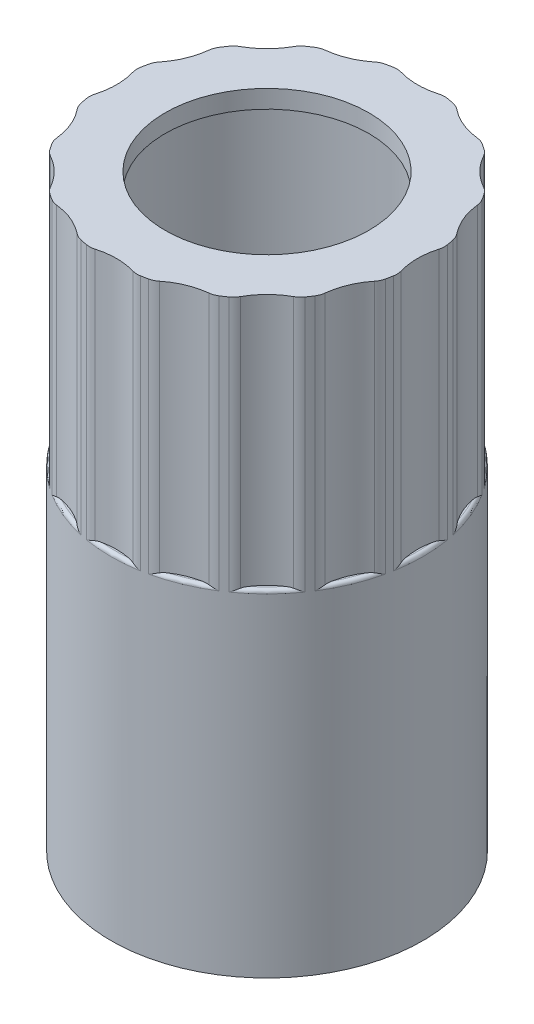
ISO-10303-21;
HEADER;
FILE_DESCRIPTION(('STEP AP214'),'2;1');
FILE_NAME('part.step','',(''),(''),'','','');
FILE_SCHEMA(('AUTOMOTIVE_DESIGN { 1 0 10303 214 1 1 1 1 }'));
ENDSEC;
DATA;
#1=APPLICATION_CONTEXT('core data for automotive mechanical design processes');
#2=APPLICATION_PROTOCOL_DEFINITION('international standard','automotive_design',2000,#1);
#3=PRODUCT_CONTEXT('',#1,'mechanical');
#4=PRODUCT('Part','Part','',(#3));
#5=PRODUCT_RELATED_PRODUCT_CATEGORY('part','',(#4));
#6=PRODUCT_DEFINITION_FORMATION('','',#4);
#7=PRODUCT_DEFINITION_CONTEXT('part definition',#1,'design');
#8=PRODUCT_DEFINITION('design','',#6,#7);
#9=PRODUCT_DEFINITION_SHAPE('','',#8);
#10=(LENGTH_UNIT() NAMED_UNIT(*) SI_UNIT(.MILLI.,.METRE.));
#11=(NAMED_UNIT(*) PLANE_ANGLE_UNIT() SI_UNIT($,.RADIAN.));
#12=(NAMED_UNIT(*) SI_UNIT($,.STERADIAN.) SOLID_ANGLE_UNIT());
#13=UNCERTAINTY_MEASURE_WITH_UNIT(LENGTH_MEASURE(1.E-05),#10,'distance_accuracy_value','');
#14=(GEOMETRIC_REPRESENTATION_CONTEXT(3) GLOBAL_UNCERTAINTY_ASSIGNED_CONTEXT((#13)) GLOBAL_UNIT_ASSIGNED_CONTEXT((#10,
#11,#12)) REPRESENTATION_CONTEXT('',''));
#15=CARTESIAN_POINT('',(0.,0.,0.));
#16=DIRECTION('',(0.,0.,1.));
#17=DIRECTION('',(1.,0.,0.));
#18=AXIS2_PLACEMENT_3D('',#15,#16,#17);
#19=CARTESIAN_POINT('',(0.,0.,0.));
#20=DIRECTION('',(0.,-1.,0.));
#21=DIRECTION('',(0.,0.,-1.));
#22=AXIS2_PLACEMENT_3D('',#19,#20,#21);
#23=CYLINDRICAL_SURFACE('',#22,11.);
#24=CARTESIAN_POINT('',(0.,0.,0.));
#25=DIRECTION('',(0.,-1.,0.));
#26=DIRECTION('',(0.,0.,-1.));
#27=AXIS2_PLACEMENT_3D('',#24,#25,#26);
#28=CIRCLE('',#27,11.);
#29=CARTESIAN_POINT('',(0.,0.,-11.));
#30=VERTEX_POINT('',#29);
#31=EDGE_CURVE('E1576',#30,#30,#28,.T.);
#32=ORIENTED_EDGE('',*,*,#31,.F.);
#33=EDGE_LOOP('',(#32));
#34=FACE_BOUND('',#33,.T.);
#35=DIRECTION('',(0.,1.,0.));
#36=VECTOR('',#35,1.);
#37=CARTESIAN_POINT('',(-5.90590190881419,23.72,-9.28010359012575));
#38=LINE('',#37,#36);
#39=CARTESIAN_POINT('',(-5.90590190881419,23.466,-9.28010359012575));
#40=VERTEX_POINT('',#39);
#41=CARTESIAN_POINT('',(-5.90590190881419,41.5,-9.28010359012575));
#42=VERTEX_POINT('',#41);
#43=EDGE_CURVE('E732',#40,#42,#38,.T.);
#44=ORIENTED_EDGE('',*,*,#43,.F.);
#45=CARTESIAN_POINT('',(0.,23.466,0.));
#46=DIRECTION('',(0.,1.,0.));
#47=DIRECTION('',(0.382683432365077,0.,0.923879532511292));
#48=AXIS2_PLACEMENT_3D('',#45,#46,#47);
#49=CIRCLE('',#48,11.);
#50=CARTESIAN_POINT('',(-2.38592088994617,23.466,-10.7381274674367));
#51=VERTEX_POINT('',#50);
#52=EDGE_CURVE('E711',#40,#51,#49,.F.);
#53=ORIENTED_EDGE('',*,*,#52,.T.);
#54=DIRECTION('',(0.,1.,0.));
#55=VECTOR('',#54,1.);
#56=CARTESIAN_POINT('',(-2.38592088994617,23.72,-10.7381274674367));
#57=LINE('',#56,#55);
#58=CARTESIAN_POINT('',(-2.38592088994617,41.5,-10.7381274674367));
#59=VERTEX_POINT('',#58);
#60=EDGE_CURVE('E722',#51,#59,#57,.T.);
#61=ORIENTED_EDGE('',*,*,#60,.T.);
#62=CARTESIAN_POINT('',(0.,41.5,0.));
#63=DIRECTION('',(0.,-1.,0.));
#64=DIRECTION('',(0.,0.,-1.));
#65=AXIS2_PLACEMENT_3D('',#62,#63,#64);
#66=CIRCLE('',#65,11.);
#67=CARTESIAN_POINT('',(-1.905,41.5,-10.8337885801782));
#68=VERTEX_POINT('',#67);
#69=EDGE_CURVE('E1578',#59,#68,#66,.T.);
#70=ORIENTED_EDGE('',*,*,#69,.T.);
#71=DIRECTION('',(0.,1.,0.));
#72=VECTOR('',#71,1.);
#73=CARTESIAN_POINT('',(-1.905,23.72,-10.8337885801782));
#74=LINE('',#73,#72);
#75=CARTESIAN_POINT('',(-1.905,23.466,-10.8337885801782));
#76=VERTEX_POINT('',#75);
#77=EDGE_CURVE('E1579',#76,#68,#74,.T.);
#78=ORIENTED_EDGE('',*,*,#77,.F.);
#79=CARTESIAN_POINT('',(0.,23.466,0.));
#80=DIRECTION('',(0.,1.,0.));
#81=DIRECTION('',(0.,0.,1.));
#82=AXIS2_PLACEMENT_3D('',#79,#80,#81);
#83=CIRCLE('',#82,11.);
#84=CARTESIAN_POINT('',(1.905,23.466,-10.8337885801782));
#85=VERTEX_POINT('',#84);
#86=EDGE_CURVE('E1614',#76,#85,#83,.F.);
#87=ORIENTED_EDGE('',*,*,#86,.T.);
#88=DIRECTION('',(0.,1.,0.));
#89=VECTOR('',#88,1.);
#90=CARTESIAN_POINT('',(1.905,23.72,-10.8337885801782));
#91=LINE('',#90,#89);
#92=CARTESIAN_POINT('',(1.905,41.5,-10.8337885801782));
#93=VERTEX_POINT('',#92);
#94=EDGE_CURVE('E1589',#85,#93,#91,.T.);
#95=ORIENTED_EDGE('',*,*,#94,.T.);
#96=CARTESIAN_POINT('',(2.38592088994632,41.5,-10.7381274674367));
#97=VERTEX_POINT('',#96);
#98=EDGE_CURVE('E1586',#93,#97,#66,.T.);
#99=ORIENTED_EDGE('',*,*,#98,.T.);
#100=DIRECTION('',(0.,1.,0.));
#101=VECTOR('',#100,1.);
#102=CARTESIAN_POINT('',(2.38592088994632,23.72,-10.7381274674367));
#103=LINE('',#102,#101);
#104=CARTESIAN_POINT('',(2.38592088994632,23.466,-10.7381274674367));
#105=VERTEX_POINT('',#104);
#106=EDGE_CURVE('E1647',#105,#97,#103,.T.);
#107=ORIENTED_EDGE('',*,*,#106,.F.);
#108=CARTESIAN_POINT('',(0.,23.466,0.));
#109=DIRECTION('',(0.,1.,0.));
#110=DIRECTION('',(-0.382683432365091,0.,0.923879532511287));
#111=AXIS2_PLACEMENT_3D('',#108,#109,#110);
#112=CIRCLE('',#111,11.);
#113=CARTESIAN_POINT('',(5.90590190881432,23.466,-9.28010359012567));
#114=VERTEX_POINT('',#113);
#115=EDGE_CURVE('E1480',#105,#114,#112,.F.);
#116=ORIENTED_EDGE('',*,*,#115,.T.);
#117=DIRECTION('',(0.,1.,0.));
#118=VECTOR('',#117,1.);
#119=CARTESIAN_POINT('',(5.90590190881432,23.72,-9.28010359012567));
#120=LINE('',#119,#118);
#121=CARTESIAN_POINT('',(5.90590190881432,41.5,-9.28010359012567));
#122=VERTEX_POINT('',#121);
#123=EDGE_CURVE('E1667',#114,#122,#120,.T.);
#124=ORIENTED_EDGE('',*,*,#123,.T.);
#125=CARTESIAN_POINT('',(6.31360695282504,41.5,-9.00768378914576));
#126=VERTEX_POINT('',#125);
#127=EDGE_CURVE('E1598',#122,#126,#66,.T.);
#128=ORIENTED_EDGE('',*,*,#127,.T.);
#129=DIRECTION('',(0.,1.,0.));
#130=VECTOR('',#129,1.);
#131=CARTESIAN_POINT('',(6.31360695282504,23.72,-9.00768378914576));
#132=LINE('',#131,#130);
#133=CARTESIAN_POINT('',(6.31360695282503,23.466,-9.00768378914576));
#134=VERTEX_POINT('',#133);
#135=EDGE_CURVE('E1477',#134,#126,#132,.T.);
#136=ORIENTED_EDGE('',*,*,#135,.F.);
#137=CARTESIAN_POINT('',(0.,23.466,0.));
#138=DIRECTION('',(0.,1.,0.));
#139=DIRECTION('',(-0.707106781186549,0.,0.707106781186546));
#140=AXIS2_PLACEMENT_3D('',#137,#138,#139);
#141=CIRCLE('',#140,11.);
#142=CARTESIAN_POINT('',(9.00768378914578,23.466,-6.31360695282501));
#143=VERTEX_POINT('',#142);
#144=EDGE_CURVE('E2554',#134,#143,#141,.F.);
#145=ORIENTED_EDGE('',*,*,#144,.T.);
#146=DIRECTION('',(0.,1.,0.));
#147=VECTOR('',#146,1.);
#148=CARTESIAN_POINT('',(9.00768378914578,23.72,-6.31360695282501));
#149=LINE('',#148,#147);
#150=CARTESIAN_POINT('',(9.00768378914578,41.5,-6.31360695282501));
#151=VERTEX_POINT('',#150);
#152=EDGE_CURVE('E1470',#143,#151,#149,.T.);
#153=ORIENTED_EDGE('',*,*,#152,.T.);
#154=CARTESIAN_POINT('',(9.28010359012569,41.5,-5.90590190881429));
#155=VERTEX_POINT('',#154);
#156=EDGE_CURVE('E1721',#151,#155,#66,.T.);
#157=ORIENTED_EDGE('',*,*,#156,.T.);
#158=DIRECTION('',(0.,1.,0.));
#159=VECTOR('',#158,1.);
#160=CARTESIAN_POINT('',(9.28010359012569,23.72,-5.90590190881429));
#161=LINE('',#160,#159);
#162=CARTESIAN_POINT('',(9.28010359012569,23.466,-5.90590190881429));
#163=VERTEX_POINT('',#162);
#164=EDGE_CURVE('E2556',#163,#155,#161,.T.);
#165=ORIENTED_EDGE('',*,*,#164,.F.);
#166=CARTESIAN_POINT('',(0.,23.466,0.));
#167=DIRECTION('',(0.,1.,0.));
#168=DIRECTION('',(-0.923879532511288,0.,0.382683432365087));
#169=AXIS2_PLACEMENT_3D('',#166,#167,#168);
#170=CIRCLE('',#169,11.);
#171=CARTESIAN_POINT('',(10.7381274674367,23.466,-2.38592088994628));
#172=VERTEX_POINT('',#171);
#173=EDGE_CURVE('E1372',#163,#172,#170,.F.);
#174=ORIENTED_EDGE('',*,*,#173,.T.);
#175=DIRECTION('',(0.,1.,0.));
#176=VECTOR('',#175,1.);
#177=CARTESIAN_POINT('',(10.7381274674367,23.72,-2.38592088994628));
#178=LINE('',#177,#176);
#179=CARTESIAN_POINT('',(10.7381274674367,41.5,-2.38592088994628));
#180=VERTEX_POINT('',#179);
#181=EDGE_CURVE('E2564',#172,#180,#178,.T.);
#182=ORIENTED_EDGE('',*,*,#181,.T.);
#183=CARTESIAN_POINT('',(10.8337885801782,41.5,-1.90499999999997));
#184=VERTEX_POINT('',#183);
#185=EDGE_CURVE('E1725',#180,#184,#66,.T.);
#186=ORIENTED_EDGE('',*,*,#185,.T.);
#187=DIRECTION('',(0.,1.,0.));
#188=VECTOR('',#187,1.);
#189=CARTESIAN_POINT('',(10.8337885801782,23.72,-1.90499999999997));
#190=LINE('',#189,#188);
#191=CARTESIAN_POINT('',(10.8337885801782,23.466,-1.90499999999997));
#192=VERTEX_POINT('',#191);
#193=EDGE_CURVE('E1369',#192,#184,#190,.T.);
#194=ORIENTED_EDGE('',*,*,#193,.F.);
#195=CARTESIAN_POINT('',(0.,23.466,0.));
#196=DIRECTION('',(0.,1.,0.));
#197=DIRECTION('',(-1.,0.,0.));
#198=AXIS2_PLACEMENT_3D('',#195,#196,#197);
#199=CIRCLE('',#198,11.);
#200=CARTESIAN_POINT('',(10.8337885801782,23.466,1.90500000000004));
#201=VERTEX_POINT('',#200);
#202=EDGE_CURVE('E2620',#192,#201,#199,.F.);
#203=ORIENTED_EDGE('',*,*,#202,.T.);
#204=DIRECTION('',(0.,1.,0.));
#205=VECTOR('',#204,1.);
#206=CARTESIAN_POINT('',(10.8337885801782,23.72,1.90500000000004));
#207=LINE('',#206,#205);
#208=CARTESIAN_POINT('',(10.8337885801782,41.5,1.90500000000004));
#209=VERTEX_POINT('',#208);
#210=EDGE_CURVE('E1362',#201,#209,#207,.T.);
#211=ORIENTED_EDGE('',*,*,#210,.T.);
#212=CARTESIAN_POINT('',(10.7381274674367,41.5,2.38592088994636));
#213=VERTEX_POINT('',#212);
#214=EDGE_CURVE('E1731',#209,#213,#66,.T.);
#215=ORIENTED_EDGE('',*,*,#214,.T.);
#216=DIRECTION('',(0.,1.,0.));
#217=VECTOR('',#216,1.);
#218=CARTESIAN_POINT('',(10.7381274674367,23.72,2.38592088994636));
#219=LINE('',#218,#217);
#220=CARTESIAN_POINT('',(10.7381274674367,23.466,2.38592088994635));
#221=VERTEX_POINT('',#220);
#222=EDGE_CURVE('E2624',#221,#213,#219,.T.);
#223=ORIENTED_EDGE('',*,*,#222,.F.);
#224=CARTESIAN_POINT('',(0.,23.466,0.));
#225=DIRECTION('',(0.,1.,0.));
#226=DIRECTION('',(-0.923879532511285,0.,-0.382683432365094));
#227=AXIS2_PLACEMENT_3D('',#224,#225,#226);
#228=CIRCLE('',#227,11.);
#229=CARTESIAN_POINT('',(9.28010359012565,23.466,5.90590190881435));
#230=VERTEX_POINT('',#229);
#231=EDGE_CURVE('E1264',#221,#230,#228,.F.);
#232=ORIENTED_EDGE('',*,*,#231,.T.);
#233=DIRECTION('',(0.,1.,0.));
#234=VECTOR('',#233,1.);
#235=CARTESIAN_POINT('',(9.28010359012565,23.72,5.90590190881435));
#236=LINE('',#235,#234);
#237=CARTESIAN_POINT('',(9.28010359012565,41.5,5.90590190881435));
#238=VERTEX_POINT('',#237);
#239=EDGE_CURVE('E2630',#230,#238,#236,.T.);
#240=ORIENTED_EDGE('',*,*,#239,.T.);
#241=CARTESIAN_POINT('',(9.00768378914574,41.5,6.31360695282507));
#242=VERTEX_POINT('',#241);
#243=EDGE_CURVE('E1739',#238,#242,#66,.T.);
#244=ORIENTED_EDGE('',*,*,#243,.T.);
#245=DIRECTION('',(0.,1.,0.));
#246=VECTOR('',#245,1.);
#247=CARTESIAN_POINT('',(9.00768378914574,23.72,6.31360695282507));
#248=LINE('',#247,#246);
#249=CARTESIAN_POINT('',(9.00768378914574,23.466,6.31360695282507));
#250=VERTEX_POINT('',#249);
#251=EDGE_CURVE('E1261',#250,#242,#248,.T.);
#252=ORIENTED_EDGE('',*,*,#251,.F.);
#253=CARTESIAN_POINT('',(0.,23.466,0.));
#254=DIRECTION('',(0.,1.,0.));
#255=DIRECTION('',(-0.707106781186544,0.,-0.707106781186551));
#256=AXIS2_PLACEMENT_3D('',#253,#254,#255);
#257=CIRCLE('',#256,11.);
#258=CARTESIAN_POINT('',(6.31360695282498,23.466,9.0076837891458));
#259=VERTEX_POINT('',#258);
#260=EDGE_CURVE('E2854',#250,#259,#257,.F.);
#261=ORIENTED_EDGE('',*,*,#260,.T.);
#262=DIRECTION('',(0.,1.,0.));
#263=VECTOR('',#262,1.);
#264=CARTESIAN_POINT('',(6.31360695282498,23.72,9.0076837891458));
#265=LINE('',#264,#263);
#266=CARTESIAN_POINT('',(6.31360695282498,41.5,9.0076837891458));
#267=VERTEX_POINT('',#266);
#268=EDGE_CURVE('E1254',#259,#267,#265,.T.);
#269=ORIENTED_EDGE('',*,*,#268,.T.);
#270=CARTESIAN_POINT('',(5.90590190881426,41.5,9.28010359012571));
#271=VERTEX_POINT('',#270);
#272=EDGE_CURVE('E1745',#267,#271,#66,.T.);
#273=ORIENTED_EDGE('',*,*,#272,.T.);
#274=DIRECTION('',(0.,1.,0.));
#275=VECTOR('',#274,1.);
#276=CARTESIAN_POINT('',(5.90590190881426,23.72,9.28010359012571));
#277=LINE('',#276,#275);
#278=CARTESIAN_POINT('',(5.90590190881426,23.466,9.28010359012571));
#279=VERTEX_POINT('',#278);
#280=EDGE_CURVE('E2852',#279,#271,#277,.T.);
#281=ORIENTED_EDGE('',*,*,#280,.F.);
#282=CARTESIAN_POINT('',(0.,23.466,0.));
#283=DIRECTION('',(0.,1.,0.));
#284=DIRECTION('',(-0.382683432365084,0.,-0.923879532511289));
#285=AXIS2_PLACEMENT_3D('',#282,#283,#284);
#286=CIRCLE('',#285,11.);
#287=CARTESIAN_POINT('',(2.38592088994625,23.466,10.7381274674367));
#288=VERTEX_POINT('',#287);
#289=EDGE_CURVE('E1156',#279,#288,#286,.F.);
#290=ORIENTED_EDGE('',*,*,#289,.T.);
#291=DIRECTION('',(0.,1.,0.));
#292=VECTOR('',#291,1.);
#293=CARTESIAN_POINT('',(2.38592088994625,23.72,10.7381274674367));
#294=LINE('',#293,#292);
#295=CARTESIAN_POINT('',(2.38592088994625,41.5,10.7381274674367));
#296=VERTEX_POINT('',#295);
#297=EDGE_CURVE('E2840',#288,#296,#294,.T.);
#298=ORIENTED_EDGE('',*,*,#297,.T.);
#299=CARTESIAN_POINT('',(1.905,41.5,10.8337885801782));
#300=VERTEX_POINT('',#299);
#301=EDGE_CURVE('E1752',#296,#300,#66,.T.);
#302=ORIENTED_EDGE('',*,*,#301,.T.);
#303=DIRECTION('',(0.,1.,0.));
#304=VECTOR('',#303,1.);
#305=CARTESIAN_POINT('',(1.905,23.72,10.8337885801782));
#306=LINE('',#305,#304);
#307=CARTESIAN_POINT('',(1.905,23.466,10.8337885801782));
#308=VERTEX_POINT('',#307);
#309=EDGE_CURVE('E1153',#308,#300,#306,.T.);
#310=ORIENTED_EDGE('',*,*,#309,.F.);
#311=CARTESIAN_POINT('',(0.,23.466,0.));
#312=DIRECTION('',(0.,1.,0.));
#313=DIRECTION('',(0.,0.,-1.));
#314=AXIS2_PLACEMENT_3D('',#311,#312,#313);
#315=CIRCLE('',#314,11.);
#316=CARTESIAN_POINT('',(-1.905,23.466,10.8337885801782));
#317=VERTEX_POINT('',#316);
#318=EDGE_CURVE('E2783',#308,#317,#315,.F.);
#319=ORIENTED_EDGE('',*,*,#318,.T.);
#320=DIRECTION('',(0.,1.,0.));
#321=VECTOR('',#320,1.);
#322=CARTESIAN_POINT('',(-1.905,23.72,10.8337885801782));
#323=LINE('',#322,#321);
#324=CARTESIAN_POINT('',(-1.905,41.5,10.8337885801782));
#325=VERTEX_POINT('',#324);
#326=EDGE_CURVE('E1146',#317,#325,#323,.T.);
#327=ORIENTED_EDGE('',*,*,#326,.T.);
#328=CARTESIAN_POINT('',(-2.38592088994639,41.5,10.7381274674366));
#329=VERTEX_POINT('',#328);
#330=EDGE_CURVE('E1758',#325,#329,#66,.T.);
#331=ORIENTED_EDGE('',*,*,#330,.T.);
#332=DIRECTION('',(0.,1.,0.));
#333=VECTOR('',#332,1.);
#334=CARTESIAN_POINT('',(-2.38592088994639,23.72,10.7381274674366));
#335=LINE('',#334,#333);
#336=CARTESIAN_POINT('',(-2.38592088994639,23.466,10.7381274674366));
#337=VERTEX_POINT('',#336);
#338=EDGE_CURVE('E2781',#337,#329,#335,.T.);
#339=ORIENTED_EDGE('',*,*,#338,.F.);
#340=CARTESIAN_POINT('',(0.,23.466,0.));
#341=DIRECTION('',(0.,1.,0.));
#342=DIRECTION('',(0.382683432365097,0.,-0.923879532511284));
#343=AXIS2_PLACEMENT_3D('',#340,#341,#342);
#344=CIRCLE('',#343,11.);
#345=CARTESIAN_POINT('',(-5.90590190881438,23.466,9.28010359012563));
#346=VERTEX_POINT('',#345);
#347=EDGE_CURVE('E1048',#337,#346,#344,.F.);
#348=ORIENTED_EDGE('',*,*,#347,.T.);
#349=DIRECTION('',(0.,1.,0.));
#350=VECTOR('',#349,1.);
#351=CARTESIAN_POINT('',(-5.90590190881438,23.72,9.28010359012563));
#352=LINE('',#351,#350);
#353=CARTESIAN_POINT('',(-5.90590190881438,41.5,9.28010359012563));
#354=VERTEX_POINT('',#353);
#355=EDGE_CURVE('E2687',#346,#354,#352,.T.);
#356=ORIENTED_EDGE('',*,*,#355,.T.);
#357=CARTESIAN_POINT('',(-6.3136069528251,41.5,9.00768378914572));
#358=VERTEX_POINT('',#357);
#359=EDGE_CURVE('E1765',#354,#358,#66,.T.);
#360=ORIENTED_EDGE('',*,*,#359,.T.);
#361=DIRECTION('',(0.,1.,0.));
#362=VECTOR('',#361,1.);
#363=CARTESIAN_POINT('',(-6.3136069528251,23.72,9.00768378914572));
#364=LINE('',#363,#362);
#365=CARTESIAN_POINT('',(-6.3136069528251,23.466,9.00768378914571));
#366=VERTEX_POINT('',#365);
#367=EDGE_CURVE('E1045',#366,#358,#364,.T.);
#368=ORIENTED_EDGE('',*,*,#367,.F.);
#369=CARTESIAN_POINT('',(0.,23.466,0.));
#370=DIRECTION('',(0.,1.,0.));
#371=DIRECTION('',(0.707106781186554,0.,-0.707106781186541));
#372=AXIS2_PLACEMENT_3D('',#369,#370,#371);
#373=CIRCLE('',#372,11.);
#374=CARTESIAN_POINT('',(-9.00768378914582,23.466,6.31360695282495));
#375=VERTEX_POINT('',#374);
#376=EDGE_CURVE('E2704',#366,#375,#373,.F.);
#377=ORIENTED_EDGE('',*,*,#376,.T.);
#378=DIRECTION('',(0.,1.,0.));
#379=VECTOR('',#378,1.);
#380=CARTESIAN_POINT('',(-9.00768378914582,23.72,6.31360695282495));
#381=LINE('',#380,#379);
#382=CARTESIAN_POINT('',(-9.00768378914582,41.5,6.31360695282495));
#383=VERTEX_POINT('',#382);
#384=EDGE_CURVE('E1038',#375,#383,#381,.T.);
#385=ORIENTED_EDGE('',*,*,#384,.T.);
#386=CARTESIAN_POINT('',(-9.28010359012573,41.5,5.90590190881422));
#387=VERTEX_POINT('',#386);
#388=EDGE_CURVE('E1770',#383,#387,#66,.T.);
#389=ORIENTED_EDGE('',*,*,#388,.T.);
#390=DIRECTION('',(0.,1.,0.));
#391=VECTOR('',#390,1.);
#392=CARTESIAN_POINT('',(-9.28010359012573,23.72,5.90590190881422));
#393=LINE('',#392,#391);
#394=CARTESIAN_POINT('',(-9.28010359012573,23.466,5.90590190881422));
#395=VERTEX_POINT('',#394);
#396=EDGE_CURVE('E2707',#395,#387,#393,.T.);
#397=ORIENTED_EDGE('',*,*,#396,.F.);
#398=CARTESIAN_POINT('',(0.,23.466,0.));
#399=DIRECTION('',(0.,1.,0.));
#400=DIRECTION('',(0.923879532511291,0.,-0.382683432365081));
#401=AXIS2_PLACEMENT_3D('',#398,#399,#400);
#402=CIRCLE('',#401,11.);
#403=CARTESIAN_POINT('',(-10.7381274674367,23.466,2.3859208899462));
#404=VERTEX_POINT('',#403);
#405=EDGE_CURVE('E940',#395,#404,#402,.F.);
#406=ORIENTED_EDGE('',*,*,#405,.T.);
#407=DIRECTION('',(0.,1.,0.));
#408=VECTOR('',#407,1.);
#409=CARTESIAN_POINT('',(-10.7381274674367,23.72,2.3859208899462));
#410=LINE('',#409,#408);
#411=CARTESIAN_POINT('',(-10.7381274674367,41.5,2.3859208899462));
#412=VERTEX_POINT('',#411);
#413=EDGE_CURVE('E2750',#404,#412,#410,.T.);
#414=ORIENTED_EDGE('',*,*,#413,.T.);
#415=CARTESIAN_POINT('',(-10.8337885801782,41.5,1.90499999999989));
#416=VERTEX_POINT('',#415);
#417=EDGE_CURVE('E1777',#412,#416,#66,.T.);
#418=ORIENTED_EDGE('',*,*,#417,.T.);
#419=DIRECTION('',(0.,1.,0.));
#420=VECTOR('',#419,1.);
#421=CARTESIAN_POINT('',(-10.8337885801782,23.72,1.90499999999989));
#422=LINE('',#421,#420);
#423=CARTESIAN_POINT('',(-10.8337885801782,23.466,1.90499999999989));
#424=VERTEX_POINT('',#423);
#425=EDGE_CURVE('E937',#424,#416,#422,.T.);
#426=ORIENTED_EDGE('',*,*,#425,.F.);
#427=CARTESIAN_POINT('',(0.,23.466,0.));
#428=DIRECTION('',(0.,1.,0.));
#429=DIRECTION('',(1.,0.,0.));
#430=AXIS2_PLACEMENT_3D('',#427,#428,#429);
#431=CIRCLE('',#430,11.);
#432=CARTESIAN_POINT('',(-10.8337885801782,23.466,-1.90500000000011));
#433=VERTEX_POINT('',#432);
#434=EDGE_CURVE('E1886',#424,#433,#431,.F.);
#435=ORIENTED_EDGE('',*,*,#434,.T.);
#436=DIRECTION('',(0.,1.,0.));
#437=VECTOR('',#436,1.);
#438=CARTESIAN_POINT('',(-10.8337885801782,23.72,-1.90500000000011));
#439=LINE('',#438,#437);
#440=CARTESIAN_POINT('',(-10.8337885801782,41.5,-1.90500000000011));
#441=VERTEX_POINT('',#440);
#442=EDGE_CURVE('E930',#433,#441,#439,.T.);
#443=ORIENTED_EDGE('',*,*,#442,.T.);
#444=CARTESIAN_POINT('',(-10.7381274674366,41.5,-2.38592088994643));
#445=VERTEX_POINT('',#444);
#446=EDGE_CURVE('E1782',#441,#445,#66,.T.);
#447=ORIENTED_EDGE('',*,*,#446,.T.);
#448=DIRECTION('',(0.,1.,0.));
#449=VECTOR('',#448,1.);
#450=CARTESIAN_POINT('',(-10.7381274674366,23.72,-2.38592088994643));
#451=LINE('',#450,#449);
#452=CARTESIAN_POINT('',(-10.7381274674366,23.466,-2.38592088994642));
#453=VERTEX_POINT('',#452);
#454=EDGE_CURVE('E1884',#453,#445,#451,.T.);
#455=ORIENTED_EDGE('',*,*,#454,.F.);
#456=CARTESIAN_POINT('',(0.,23.466,0.));
#457=DIRECTION('',(0.,1.,0.));
#458=DIRECTION('',(0.923879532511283,0.,0.3826834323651));
#459=AXIS2_PLACEMENT_3D('',#456,#457,#458);
#460=CIRCLE('',#459,11.);
#461=CARTESIAN_POINT('',(-9.28010359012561,23.466,-5.90590190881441));
#462=VERTEX_POINT('',#461);
#463=EDGE_CURVE('E832',#453,#462,#460,.F.);
#464=ORIENTED_EDGE('',*,*,#463,.T.);
#465=DIRECTION('',(0.,1.,0.));
#466=VECTOR('',#465,1.);
#467=CARTESIAN_POINT('',(-9.28010359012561,23.72,-5.90590190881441));
#468=LINE('',#467,#466);
#469=CARTESIAN_POINT('',(-9.28010359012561,41.5,-5.90590190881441));
#470=VERTEX_POINT('',#469);
#471=EDGE_CURVE('E1880',#462,#470,#468,.T.);
#472=ORIENTED_EDGE('',*,*,#471,.T.);
#473=CARTESIAN_POINT('',(-9.00768378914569,41.5,-6.31360695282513));
#474=VERTEX_POINT('',#473);
#475=EDGE_CURVE('E1788',#470,#474,#66,.T.);
#476=ORIENTED_EDGE('',*,*,#475,.T.);
#477=DIRECTION('',(0.,1.,0.));
#478=VECTOR('',#477,1.);
#479=CARTESIAN_POINT('',(-9.00768378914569,23.72,-6.31360695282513));
#480=LINE('',#479,#478);
#481=CARTESIAN_POINT('',(-9.00768378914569,23.466,-6.31360695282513));
#482=VERTEX_POINT('',#481);
#483=EDGE_CURVE('E829',#482,#474,#480,.T.);
#484=ORIENTED_EDGE('',*,*,#483,.F.);
#485=CARTESIAN_POINT('',(0.,23.466,0.));
#486=DIRECTION('',(0.,1.,0.));
#487=DIRECTION('',(0.707106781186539,0.,0.707106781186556));
#488=AXIS2_PLACEMENT_3D('',#485,#486,#487);
#489=CIRCLE('',#488,11.);
#490=CARTESIAN_POINT('',(-6.31360695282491,23.466,-9.00768378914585));
#491=VERTEX_POINT('',#490);
#492=EDGE_CURVE('E1809',#482,#491,#489,.F.);
#493=ORIENTED_EDGE('',*,*,#492,.T.);
#494=DIRECTION('',(0.,1.,0.));
#495=VECTOR('',#494,1.);
#496=CARTESIAN_POINT('',(-6.31360695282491,23.72,-9.00768378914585));
#497=LINE('',#496,#495);
#498=CARTESIAN_POINT('',(-6.31360695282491,41.5,-9.00768378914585));
#499=VERTEX_POINT('',#498);
#500=EDGE_CURVE('E823',#491,#499,#497,.T.);
#501=ORIENTED_EDGE('',*,*,#500,.T.);
#502=EDGE_CURVE('E1584',#499,#42,#66,.T.);
#503=ORIENTED_EDGE('',*,*,#502,.T.);
#504=EDGE_LOOP('',(#44,#53,#61,#70,#78,#87,#95,#99,#107,#116,#124,#128,#136,#145,#153,#157,#165,
#174,#182,#186,#194,#203,#211,#215,#223,#232,#240,#244,#252,#261,#269,#273,#281,#290,#298,#302,
#310,#319,#327,#331,#339,#348,#356,#360,#368,#377,#385,#389,#397,#406,#414,#418,#426,#435,#443,
#447,#455,#464,#472,#476,#484,#493,#501,#503));
#505=FACE_BOUND('',#504,.T.);
#506=ADVANCED_FACE('F44',(#34,#505),#23,.T.);
#507=CARTESIAN_POINT('',(-11.,0.,0.));
#508=DIRECTION('',(0.,1.,0.));
#509=DIRECTION('',(0.,0.,1.));
#510=AXIS2_PLACEMENT_3D('',#507,#508,#509);
#511=PLANE('',#510);
#512=CARTESIAN_POINT('',(0.,0.,0.));
#513=DIRECTION('',(0.,-1.,0.));
#514=DIRECTION('',(0.,0.,-1.));
#515=AXIS2_PLACEMENT_3D('',#512,#513,#514);
#516=CIRCLE('',#515,9.72999999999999);
#517=CARTESIAN_POINT('',(0.,0.,-9.72999999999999));
#518=VERTEX_POINT('',#517);
#519=EDGE_CURVE('E1573',#518,#518,#516,.T.);
#520=ORIENTED_EDGE('',*,*,#519,.F.);
#521=EDGE_LOOP('',(#520));
#522=FACE_BOUND('',#521,.T.);
#523=ORIENTED_EDGE('',*,*,#31,.T.);
#524=EDGE_LOOP('',(#523));
#525=FACE_BOUND('',#524,.T.);
#526=ADVANCED_FACE('F1550',(#522,#525),#511,.F.);
#527=CARTESIAN_POINT('',(0.,0.,0.));
#528=DIRECTION('',(0.,-1.,0.));
#529=DIRECTION('',(0.,0.,-1.));
#530=AXIS2_PLACEMENT_3D('',#527,#528,#529);
#531=CYLINDRICAL_SURFACE('',#530,9.72999999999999);
#532=CARTESIAN_POINT('',(0.,40.23,0.));
#533=DIRECTION('',(0.,-1.,0.));
#534=DIRECTION('',(0.,0.,-1.));
#535=AXIS2_PLACEMENT_3D('',#532,#533,#534);
#536=CIRCLE('',#535,9.72999999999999);
#537=CARTESIAN_POINT('',(0.,40.23,-9.72999999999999));
#538=VERTEX_POINT('',#537);
#539=EDGE_CURVE('E1606',#538,#538,#536,.T.);
#540=ORIENTED_EDGE('',*,*,#539,.F.);
#541=EDGE_LOOP('',(#540));
#542=FACE_BOUND('',#541,.T.);
#543=ORIENTED_EDGE('',*,*,#519,.T.);
#544=EDGE_LOOP('',(#543));
#545=FACE_BOUND('',#544,.T.);
#546=ADVANCED_FACE('F1562',(#542,#545),#531,.F.);
#547=CARTESIAN_POINT('',(-9.72999999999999,40.23,0.));
#548=DIRECTION('',(0.,1.,0.));
#549=DIRECTION('',(0.,0.,1.));
#550=AXIS2_PLACEMENT_3D('',#547,#548,#549);
#551=PLANE('',#550);
#552=CARTESIAN_POINT('',(0.,40.23,0.));
#553=DIRECTION('',(0.,-1.,0.));
#554=DIRECTION('',(0.,0.,-1.));
#555=AXIS2_PLACEMENT_3D('',#552,#553,#554);
#556=CIRCLE('',#555,7.19);
#557=CARTESIAN_POINT('',(0.,40.23,-7.19));
#558=VERTEX_POINT('',#557);
#559=EDGE_CURVE('E1602',#558,#558,#556,.T.);
#560=ORIENTED_EDGE('',*,*,#559,.F.);
#561=EDGE_LOOP('',(#560));
#562=FACE_BOUND('',#561,.T.);
#563=ORIENTED_EDGE('',*,*,#539,.T.);
#564=EDGE_LOOP('',(#563));
#565=FACE_BOUND('',#564,.T.);
#566=ADVANCED_FACE('F1558',(#562,#565),#551,.F.);
#567=CARTESIAN_POINT('',(0.,0.,0.));
#568=DIRECTION('',(0.,-1.,0.));
#569=DIRECTION('',(0.,0.,-1.));
#570=AXIS2_PLACEMENT_3D('',#567,#568,#569);
#571=CYLINDRICAL_SURFACE('',#570,7.19);
#572=CARTESIAN_POINT('',(0.,41.5,0.));
#573=DIRECTION('',(0.,-1.,0.));
#574=DIRECTION('',(0.,0.,-1.));
#575=AXIS2_PLACEMENT_3D('',#572,#573,#574);
#576=CIRCLE('',#575,7.19);
#577=CARTESIAN_POINT('',(0.,41.5,-7.19));
#578=VERTEX_POINT('',#577);
#579=EDGE_CURVE('E1597',#578,#578,#576,.T.);
#580=ORIENTED_EDGE('',*,*,#579,.F.);
#581=EDGE_LOOP('',(#580));
#582=FACE_BOUND('',#581,.T.);
#583=ORIENTED_EDGE('',*,*,#559,.T.);
#584=EDGE_LOOP('',(#583));
#585=FACE_BOUND('',#584,.T.);
#586=ADVANCED_FACE('F1554',(#582,#585),#571,.F.);
#587=CARTESIAN_POINT('',(-7.19,41.5,0.));
#588=DIRECTION('',(0.,-1.,0.));
#589=DIRECTION('',(0.,0.,-1.));
#590=AXIS2_PLACEMENT_3D('',#587,#588,#589);
#591=PLANE('',#590);
#592=CARTESIAN_POINT('',(-5.89415681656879,41.5,-14.2297533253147));
#593=DIRECTION('',(0.,1.,0.));
#594=DIRECTION('',(0.382683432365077,0.,0.923879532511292));
#595=AXIS2_PLACEMENT_3D('',#592,#593,#594);
#596=CIRCLE('',#595,4.78825562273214);
#597=CARTESIAN_POINT('',(-5.36451642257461,41.5,-9.47088024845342));
#598=VERTEX_POINT('',#597);
#599=CARTESIAN_POINT('',(-2.90363770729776,41.5,-10.4902095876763));
#600=VERTEX_POINT('',#599);
#601=EDGE_CURVE('E1803',#598,#600,#596,.T.);
#602=ORIENTED_EDGE('',*,*,#601,.F.);
#603=CARTESIAN_POINT('',(-5.22403868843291,41.5,-8.20867344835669));
#604=DIRECTION('',(0.,-1.,0.));
#605=DIRECTION('',(0.382683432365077,0.,0.923879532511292));
#606=AXIS2_PLACEMENT_3D('',#603,#604,#605);
#607=CIRCLE('',#606,1.27);
#608=EDGE_CURVE('E68',#42,#598,#607,.T.);
#609=ORIENTED_EDGE('',*,*,#608,.F.);
#610=ORIENTED_EDGE('',*,*,#502,.F.);
#611=CARTESIAN_POINT('',(-5.58467233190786,41.5,-7.96770575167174));
#612=DIRECTION('',(0.,-1.,0.));
#613=DIRECTION('',(-0.707106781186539,0.,-0.707106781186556));
#614=AXIS2_PLACEMENT_3D('',#611,#612,#613);
#615=CIRCLE('',#614,1.27);
#616=CARTESIAN_POINT('',(-6.69704085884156,41.5,-8.58051588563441));
#617=VERTEX_POINT('',#616);
#618=EDGE_CURVE('E820',#617,#499,#615,.T.);
#619=ORIENTED_EDGE('',*,*,#618,.F.);
#620=CARTESIAN_POINT('',(-10.8909816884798,41.5,-10.8909816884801));
#621=DIRECTION('',(0.,1.,0.));
#622=DIRECTION('',(0.707106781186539,0.,0.707106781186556));
#623=AXIS2_PLACEMENT_3D('',#620,#621,#622);
#624=CIRCLE('',#623,4.78825562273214);
#625=CARTESIAN_POINT('',(-8.58051588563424,41.5,-6.69704085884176));
#626=VERTEX_POINT('',#625);
#627=EDGE_CURVE('E810',#626,#617,#624,.T.);
#628=ORIENTED_EDGE('',*,*,#627,.F.);
#629=CARTESIAN_POINT('',(-7.9677057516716,41.5,-5.58467233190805));
#630=DIRECTION('',(0.,-1.,0.));
#631=DIRECTION('',(0.707106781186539,0.,0.707106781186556));
#632=AXIS2_PLACEMENT_3D('',#629,#630,#631);
#633=CIRCLE('',#632,1.27);
#634=EDGE_CURVE('E78',#474,#626,#633,.T.);
#635=ORIENTED_EDGE('',*,*,#634,.F.);
#636=ORIENTED_EDGE('',*,*,#475,.F.);
#637=CARTESIAN_POINT('',(-8.20867344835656,41.5,-5.22403868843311));
#638=DIRECTION('',(0.,-1.,0.));
#639=DIRECTION('',(-0.923879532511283,0.,-0.3826834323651));
#640=AXIS2_PLACEMENT_3D('',#637,#638,#639);
#641=CIRCLE('',#640,1.27);
#642=CARTESIAN_POINT('',(-9.47088024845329,41.5,-5.36451642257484));
#643=VERTEX_POINT('',#642);
#644=EDGE_CURVE('E1878',#643,#470,#641,.T.);
#645=ORIENTED_EDGE('',*,*,#644,.F.);
#646=CARTESIAN_POINT('',(-14.2297533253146,41.5,-5.89415681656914));
#647=DIRECTION('',(0.,1.,0.));
#648=DIRECTION('',(0.923879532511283,0.,0.3826834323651));
#649=AXIS2_PLACEMENT_3D('',#646,#647,#648);
#650=CIRCLE('',#649,4.78825562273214);
#651=CARTESIAN_POINT('',(-10.4902095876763,41.5,-2.90363770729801));
#652=VERTEX_POINT('',#651);
#653=EDGE_CURVE('E1861',#652,#643,#650,.T.);
#654=ORIENTED_EDGE('',*,*,#653,.F.);
#655=CARTESIAN_POINT('',(-9.49836184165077,41.5,-2.11045547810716));
#656=DIRECTION('',(0.,-1.,0.));
#657=DIRECTION('',(0.923879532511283,0.,0.3826834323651));
#658=AXIS2_PLACEMENT_3D('',#655,#656,#657);
#659=CIRCLE('',#658,1.27);
#660=EDGE_CURVE('E1860',#445,#652,#659,.T.);
#661=ORIENTED_EDGE('',*,*,#660,.F.);
#662=ORIENTED_EDGE('',*,*,#446,.F.);
#663=CARTESIAN_POINT('',(-9.58297844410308,41.5,-1.68505909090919));
#664=DIRECTION('',(0.,-1.,0.));
#665=DIRECTION('',(-1.,0.,0.));
#666=AXIS2_PLACEMENT_3D('',#663,#664,#665);
#667=CIRCLE('',#666,1.27);
#668=CARTESIAN_POINT('',(-10.8028639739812,41.5,-1.33181796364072));
#669=VERTEX_POINT('',#668);
#670=EDGE_CURVE('E927',#669,#441,#667,.T.);
#671=ORIENTED_EDGE('',*,*,#670,.F.);
#672=CARTESIAN_POINT('',(-15.4021740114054,41.5,-1.61329209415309E-13));
#673=DIRECTION('',(0.,1.,0.));
#674=DIRECTION('',(1.,0.,0.));
#675=AXIS2_PLACEMENT_3D('',#672,#673,#674);
#676=CIRCLE('',#675,4.78825562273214);
#677=CARTESIAN_POINT('',(-10.8028639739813,41.5,1.33181796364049));
#678=VERTEX_POINT('',#677);
#679=EDGE_CURVE('E916',#678,#669,#676,.T.);
#680=ORIENTED_EDGE('',*,*,#679,.F.);
#681=CARTESIAN_POINT('',(-9.58297844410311,41.5,1.68505909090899));
#682=DIRECTION('',(0.,-1.,0.));
#683=DIRECTION('',(1.,0.,0.));
#684=AXIS2_PLACEMENT_3D('',#681,#682,#683);
#685=CIRCLE('',#684,1.27);
#686=EDGE_CURVE('E934',#416,#678,#685,.T.);
#687=ORIENTED_EDGE('',*,*,#686,.F.);
#688=ORIENTED_EDGE('',*,*,#417,.F.);
#689=CARTESIAN_POINT('',(-9.49836184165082,41.5,2.11045547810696));
#690=DIRECTION('',(0.,-1.,0.));
#691=DIRECTION('',(-0.923879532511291,0.,0.382683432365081));
#692=AXIS2_PLACEMENT_3D('',#689,#690,#691);
#693=CIRCLE('',#692,1.27);
#694=CARTESIAN_POINT('',(-10.4902095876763,41.5,2.90363770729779));
#695=VERTEX_POINT('',#694);
#696=EDGE_CURVE('E2747',#695,#412,#693,.T.);
#697=ORIENTED_EDGE('',*,*,#696,.F.);
#698=CARTESIAN_POINT('',(-14.2297533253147,41.5,5.89415681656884));
#699=DIRECTION('',(0.,1.,0.));
#700=DIRECTION('',(0.923879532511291,0.,-0.382683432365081));
#701=AXIS2_PLACEMENT_3D('',#698,#699,#700);
#702=CIRCLE('',#701,4.78825562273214);
#703=CARTESIAN_POINT('',(-9.4708802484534,41.5,5.36451642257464));
#704=VERTEX_POINT('',#703);
#705=EDGE_CURVE('E2737',#704,#695,#702,.T.);
#706=ORIENTED_EDGE('',*,*,#705,.F.);
#707=CARTESIAN_POINT('',(-8.20867344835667,41.5,5.22403868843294));
#708=DIRECTION('',(0.,-1.,0.));
#709=DIRECTION('',(0.923879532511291,0.,-0.382683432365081));
#710=AXIS2_PLACEMENT_3D('',#707,#708,#709);
#711=CIRCLE('',#710,1.27);
#712=EDGE_CURVE('E2753',#387,#704,#711,.T.);
#713=ORIENTED_EDGE('',*,*,#712,.F.);
#714=ORIENTED_EDGE('',*,*,#388,.F.);
#715=CARTESIAN_POINT('',(-7.96770575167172,41.5,5.58467233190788));
#716=DIRECTION('',(0.,-1.,0.));
#717=DIRECTION('',(-0.707106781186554,0.,0.707106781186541));
#718=AXIS2_PLACEMENT_3D('',#715,#716,#717);
#719=CIRCLE('',#718,1.27);
#720=CARTESIAN_POINT('',(-8.58051588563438,41.5,6.69704085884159));
#721=VERTEX_POINT('',#720);
#722=EDGE_CURVE('E1035',#721,#383,#719,.T.);
#723=ORIENTED_EDGE('',*,*,#722,.F.);
#724=CARTESIAN_POINT('',(-10.89098168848,41.5,10.8909816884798));
#725=DIRECTION('',(0.,1.,0.));
#726=DIRECTION('',(0.707106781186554,0.,-0.707106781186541));
#727=AXIS2_PLACEMENT_3D('',#724,#725,#726);
#728=CIRCLE('',#727,4.78825562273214);
#729=CARTESIAN_POINT('',(-6.69704085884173,41.5,8.58051588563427));
#730=VERTEX_POINT('',#729);
#731=EDGE_CURVE('E1024',#730,#721,#728,.T.);
#732=ORIENTED_EDGE('',*,*,#731,.F.);
#733=CARTESIAN_POINT('',(-5.58467233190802,41.5,7.96770575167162));
#734=DIRECTION('',(0.,-1.,0.));
#735=DIRECTION('',(0.707106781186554,0.,-0.707106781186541));
#736=AXIS2_PLACEMENT_3D('',#733,#734,#735);
#737=CIRCLE('',#736,1.27);
#738=EDGE_CURVE('E1042',#358,#730,#737,.T.);
#739=ORIENTED_EDGE('',*,*,#738,.F.);
#740=ORIENTED_EDGE('',*,*,#359,.F.);
#741=CARTESIAN_POINT('',(-5.22403868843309,41.5,8.20867344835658));
#742=DIRECTION('',(0.,-1.,0.));
#743=DIRECTION('',(-0.382683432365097,0.,0.923879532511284));
#744=AXIS2_PLACEMENT_3D('',#741,#742,#743);
#745=CIRCLE('',#744,1.27);
#746=CARTESIAN_POINT('',(-5.36451642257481,41.5,9.4708802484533));
#747=VERTEX_POINT('',#746);
#748=EDGE_CURVE('E2690',#747,#354,#745,.T.);
#749=ORIENTED_EDGE('',*,*,#748,.F.);
#750=CARTESIAN_POINT('',(-5.89415681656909,41.5,14.2297533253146));
#751=DIRECTION('',(0.,1.,0.));
#752=DIRECTION('',(0.382683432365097,0.,-0.923879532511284));
#753=AXIS2_PLACEMENT_3D('',#750,#751,#752);
#754=CIRCLE('',#753,4.78825562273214);
#755=CARTESIAN_POINT('',(-2.90363770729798,41.5,10.4902095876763));
#756=VERTEX_POINT('',#755);
#757=EDGE_CURVE('E2701',#756,#747,#754,.T.);
#758=ORIENTED_EDGE('',*,*,#757,.F.);
#759=CARTESIAN_POINT('',(-2.11045547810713,41.5,9.49836184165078));
#760=DIRECTION('',(0.,-1.,0.));
#761=DIRECTION('',(0.382683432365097,0.,-0.923879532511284));
#762=AXIS2_PLACEMENT_3D('',#759,#760,#761);
#763=CIRCLE('',#762,1.27);
#764=EDGE_CURVE('E2689',#329,#756,#763,.T.);
#765=ORIENTED_EDGE('',*,*,#764,.F.);
#766=ORIENTED_EDGE('',*,*,#330,.F.);
#767=CARTESIAN_POINT('',(-1.68505909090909,41.5,9.5829784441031));
#768=DIRECTION('',(0.,-1.,0.));
#769=DIRECTION('',(0.,0.,1.));
#770=AXIS2_PLACEMENT_3D('',#767,#768,#769);
#771=CIRCLE('',#770,1.27);
#772=CARTESIAN_POINT('',(-1.3318179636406,41.5,10.8028639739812));
#773=VERTEX_POINT('',#772);
#774=EDGE_CURVE('E1143',#773,#325,#771,.T.);
#775=ORIENTED_EDGE('',*,*,#774,.F.);
#776=CARTESIAN_POINT('',(0.,41.5,15.4021740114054));
#777=DIRECTION('',(0.,1.,0.));
#778=DIRECTION('',(0.,0.,-1.));
#779=AXIS2_PLACEMENT_3D('',#776,#777,#778);
#780=CIRCLE('',#779,4.78825562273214);
#781=CARTESIAN_POINT('',(1.33181796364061,41.5,10.8028639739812));
#782=VERTEX_POINT('',#781);
#783=EDGE_CURVE('E1132',#782,#773,#780,.T.);
#784=ORIENTED_EDGE('',*,*,#783,.F.);
#785=CARTESIAN_POINT('',(1.68505909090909,41.5,9.5829784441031));
#786=DIRECTION('',(0.,-1.,0.));
#787=DIRECTION('',(0.,0.,-1.));
#788=AXIS2_PLACEMENT_3D('',#785,#786,#787);
#789=CIRCLE('',#788,1.27);
#790=EDGE_CURVE('E1150',#300,#782,#789,.T.);
#791=ORIENTED_EDGE('',*,*,#790,.F.);
#792=ORIENTED_EDGE('',*,*,#301,.F.);
#793=CARTESIAN_POINT('',(2.110455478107,41.5,9.49836184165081));
#794=DIRECTION('',(0.,-1.,0.));
#795=DIRECTION('',(0.382683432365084,0.,0.923879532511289));
#796=AXIS2_PLACEMENT_3D('',#793,#794,#795);
#797=CIRCLE('',#796,1.27);
#798=CARTESIAN_POINT('',(2.90363770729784,41.5,10.4902095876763));
#799=VERTEX_POINT('',#798);
#800=EDGE_CURVE('E2835',#799,#296,#797,.T.);
#801=ORIENTED_EDGE('',*,*,#800,.F.);
#802=CARTESIAN_POINT('',(5.89415681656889,41.5,14.2297533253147));
#803=DIRECTION('',(0.,1.,0.));
#804=DIRECTION('',(-0.382683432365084,0.,-0.923879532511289));
#805=AXIS2_PLACEMENT_3D('',#802,#803,#804);
#806=CIRCLE('',#805,4.78825562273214);
#807=CARTESIAN_POINT('',(5.36451642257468,41.5,9.47088024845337));
#808=VERTEX_POINT('',#807);
#809=EDGE_CURVE('E2809',#808,#799,#806,.T.);
#810=ORIENTED_EDGE('',*,*,#809,.F.);
#811=CARTESIAN_POINT('',(5.22403868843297,41.5,8.20867344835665));
#812=DIRECTION('',(0.,-1.,0.));
#813=DIRECTION('',(-0.382683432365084,0.,-0.923879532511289));
#814=AXIS2_PLACEMENT_3D('',#811,#812,#813);
#815=CIRCLE('',#814,1.27);
#816=EDGE_CURVE('E2843',#271,#808,#815,.T.);
#817=ORIENTED_EDGE('',*,*,#816,.F.);
#818=ORIENTED_EDGE('',*,*,#272,.F.);
#819=CARTESIAN_POINT('',(5.58467233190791,41.5,7.9677057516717));
#820=DIRECTION('',(0.,-1.,0.));
#821=DIRECTION('',(0.707106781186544,0.,0.707106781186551));
#822=AXIS2_PLACEMENT_3D('',#819,#820,#821);
#823=CIRCLE('',#822,1.27);
#824=CARTESIAN_POINT('',(6.69704085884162,41.5,8.58051588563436));
#825=VERTEX_POINT('',#824);
#826=EDGE_CURVE('E1251',#825,#267,#823,.T.);
#827=ORIENTED_EDGE('',*,*,#826,.F.);
#828=CARTESIAN_POINT('',(10.8909816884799,41.5,10.89098168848));
#829=DIRECTION('',(0.,1.,0.));
#830=DIRECTION('',(-0.707106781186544,0.,-0.707106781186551));
#831=AXIS2_PLACEMENT_3D('',#828,#829,#830);
#832=CIRCLE('',#831,4.78825562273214);
#833=CARTESIAN_POINT('',(8.58051588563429,41.5,6.69704085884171));
#834=VERTEX_POINT('',#833);
#835=EDGE_CURVE('E1240',#834,#825,#832,.T.);
#836=ORIENTED_EDGE('',*,*,#835,.F.);
#837=CARTESIAN_POINT('',(7.96770575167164,41.5,5.584672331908));
#838=DIRECTION('',(0.,-1.,0.));
#839=DIRECTION('',(-0.707106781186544,0.,-0.707106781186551));
#840=AXIS2_PLACEMENT_3D('',#837,#838,#839);
#841=CIRCLE('',#840,1.27);
#842=EDGE_CURVE('E1258',#242,#834,#841,.T.);
#843=ORIENTED_EDGE('',*,*,#842,.F.);
#844=ORIENTED_EDGE('',*,*,#243,.F.);
#845=CARTESIAN_POINT('',(8.2086734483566,41.5,5.22403868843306));
#846=DIRECTION('',(0.,-1.,0.));
#847=DIRECTION('',(0.923879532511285,0.,0.382683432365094));
#848=AXIS2_PLACEMENT_3D('',#845,#846,#847);
#849=CIRCLE('',#848,1.27);
#850=CARTESIAN_POINT('',(9.47088024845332,41.5,5.36451642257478));
#851=VERTEX_POINT('',#850);
#852=EDGE_CURVE('E2633',#851,#238,#849,.T.);
#853=ORIENTED_EDGE('',*,*,#852,.F.);
#854=CARTESIAN_POINT('',(14.2297533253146,41.5,5.89415681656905));
#855=DIRECTION('',(0.,1.,0.));
#856=DIRECTION('',(-0.923879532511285,0.,-0.382683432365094));
#857=AXIS2_PLACEMENT_3D('',#854,#855,#856);
#858=CIRCLE('',#857,4.78825562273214);
#859=CARTESIAN_POINT('',(10.4902095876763,41.5,2.90363770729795));
#860=VERTEX_POINT('',#859);
#861=EDGE_CURVE('E2643',#860,#851,#858,.T.);
#862=ORIENTED_EDGE('',*,*,#861,.F.);
#863=CARTESIAN_POINT('',(9.49836184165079,41.5,2.1104554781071));
#864=DIRECTION('',(0.,-1.,0.));
#865=DIRECTION('',(-0.923879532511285,0.,-0.382683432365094));
#866=AXIS2_PLACEMENT_3D('',#863,#864,#865);
#867=CIRCLE('',#866,1.27);
#868=EDGE_CURVE('E2626',#213,#860,#867,.T.);
#869=ORIENTED_EDGE('',*,*,#868,.F.);
#870=ORIENTED_EDGE('',*,*,#214,.F.);
#871=CARTESIAN_POINT('',(9.58297844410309,41.5,1.68505909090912));
#872=DIRECTION('',(0.,-1.,0.));
#873=DIRECTION('',(1.,0.,0.));
#874=AXIS2_PLACEMENT_3D('',#871,#872,#873);
#875=CIRCLE('',#874,1.27);
#876=CARTESIAN_POINT('',(10.8028639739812,41.5,1.33181796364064));
#877=VERTEX_POINT('',#876);
#878=EDGE_CURVE('E1359',#877,#209,#875,.T.);
#879=ORIENTED_EDGE('',*,*,#878,.F.);
#880=CARTESIAN_POINT('',(15.4021740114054,41.5,0.));
#881=DIRECTION('',(0.,1.,0.));
#882=DIRECTION('',(-1.,0.,0.));
#883=AXIS2_PLACEMENT_3D('',#880,#881,#882);
#884=CIRCLE('',#883,4.78825562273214);
#885=CARTESIAN_POINT('',(10.8028639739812,41.5,-1.33181796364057));
#886=VERTEX_POINT('',#885);
#887=EDGE_CURVE('E1348',#886,#877,#884,.T.);
#888=ORIENTED_EDGE('',*,*,#887,.F.);
#889=CARTESIAN_POINT('',(9.5829784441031,41.5,-1.68505909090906));
#890=DIRECTION('',(0.,-1.,0.));
#891=DIRECTION('',(-1.,0.,0.));
#892=AXIS2_PLACEMENT_3D('',#889,#890,#891);
#893=CIRCLE('',#892,1.27);
#894=EDGE_CURVE('E1366',#184,#886,#893,.T.);
#895=ORIENTED_EDGE('',*,*,#894,.F.);
#896=ORIENTED_EDGE('',*,*,#185,.F.);
#897=CARTESIAN_POINT('',(9.4983618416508,41.5,-2.11045547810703));
#898=DIRECTION('',(0.,-1.,0.));
#899=DIRECTION('',(0.923879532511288,0.,-0.382683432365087));
#900=AXIS2_PLACEMENT_3D('',#897,#898,#899);
#901=CIRCLE('',#900,1.27);
#902=CARTESIAN_POINT('',(10.4902095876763,41.5,-2.90363770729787));
#903=VERTEX_POINT('',#902);
#904=EDGE_CURVE('E2566',#903,#180,#901,.T.);
#905=ORIENTED_EDGE('',*,*,#904,.F.);
#906=CARTESIAN_POINT('',(14.2297533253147,41.5,-5.89415681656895));
#907=DIRECTION('',(0.,1.,0.));
#908=DIRECTION('',(-0.923879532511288,0.,0.382683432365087));
#909=AXIS2_PLACEMENT_3D('',#906,#907,#908);
#910=CIRCLE('',#909,4.78825562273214);
#911=CARTESIAN_POINT('',(9.47088024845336,41.5,-5.36451642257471));
#912=VERTEX_POINT('',#911);
#913=EDGE_CURVE('E2576',#912,#903,#910,.T.);
#914=ORIENTED_EDGE('',*,*,#913,.F.);
#915=CARTESIAN_POINT('',(8.20867344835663,41.5,-5.224038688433));
#916=DIRECTION('',(0.,-1.,0.));
#917=DIRECTION('',(-0.923879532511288,0.,0.382683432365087));
#918=AXIS2_PLACEMENT_3D('',#915,#916,#917);
#919=CIRCLE('',#918,1.27);
#920=EDGE_CURVE('E2560',#155,#912,#919,.T.);
#921=ORIENTED_EDGE('',*,*,#920,.F.);
#922=ORIENTED_EDGE('',*,*,#156,.F.);
#923=CARTESIAN_POINT('',(7.96770575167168,41.5,-5.58467233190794));
#924=DIRECTION('',(0.,-1.,0.));
#925=DIRECTION('',(0.707106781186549,0.,-0.707106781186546));
#926=AXIS2_PLACEMENT_3D('',#923,#924,#925);
#927=CIRCLE('',#926,1.27);
#928=CARTESIAN_POINT('',(8.58051588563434,41.5,-6.69704085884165));
#929=VERTEX_POINT('',#928);
#930=EDGE_CURVE('E1467',#929,#151,#927,.T.);
#931=ORIENTED_EDGE('',*,*,#930,.F.);
#932=CARTESIAN_POINT('',(10.89098168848,41.5,-10.8909816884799));
#933=DIRECTION('',(0.,1.,0.));
#934=DIRECTION('',(-0.707106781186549,0.,0.707106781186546));
#935=AXIS2_PLACEMENT_3D('',#932,#933,#934);
#936=CIRCLE('',#935,4.78825562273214);
#937=CARTESIAN_POINT('',(6.69704085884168,41.5,-8.58051588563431));
#938=VERTEX_POINT('',#937);
#939=EDGE_CURVE('E1456',#938,#929,#936,.T.);
#940=ORIENTED_EDGE('',*,*,#939,.F.);
#941=CARTESIAN_POINT('',(5.58467233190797,41.5,-7.96770575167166));
#942=DIRECTION('',(0.,-1.,0.));
#943=DIRECTION('',(-0.707106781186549,0.,0.707106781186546));
#944=AXIS2_PLACEMENT_3D('',#941,#942,#943);
#945=CIRCLE('',#944,1.27);
#946=EDGE_CURVE('E1474',#126,#938,#945,.T.);
#947=ORIENTED_EDGE('',*,*,#946,.F.);
#948=ORIENTED_EDGE('',*,*,#127,.F.);
#949=CARTESIAN_POINT('',(5.22403868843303,41.5,-8.20867344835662));
#950=DIRECTION('',(0.,-1.,0.));
#951=DIRECTION('',(0.382683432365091,0.,-0.923879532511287));
#952=AXIS2_PLACEMENT_3D('',#949,#950,#951);
#953=CIRCLE('',#952,1.27);
#954=CARTESIAN_POINT('',(5.36451642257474,41.5,-9.47088024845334));
#955=VERTEX_POINT('',#954);
#956=EDGE_CURVE('E1672',#955,#122,#953,.T.);
#957=ORIENTED_EDGE('',*,*,#956,.F.);
#958=CARTESIAN_POINT('',(5.894156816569,41.5,-14.2297533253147));
#959=DIRECTION('',(0.,1.,0.));
#960=DIRECTION('',(-0.382683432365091,0.,0.923879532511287));
#961=AXIS2_PLACEMENT_3D('',#958,#959,#960);
#962=CIRCLE('',#961,4.78825562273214);
#963=CARTESIAN_POINT('',(2.90363770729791,41.5,-10.4902095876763));
#964=VERTEX_POINT('',#963);
#965=EDGE_CURVE('E1663',#964,#955,#962,.T.);
#966=ORIENTED_EDGE('',*,*,#965,.F.);
#967=CARTESIAN_POINT('',(2.11045547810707,41.5,-9.4983618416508));
#968=DIRECTION('',(0.,-1.,0.));
#969=DIRECTION('',(-0.382683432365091,0.,0.923879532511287));
#970=AXIS2_PLACEMENT_3D('',#967,#968,#969);
#971=CIRCLE('',#970,1.27);
#972=EDGE_CURVE('E1661',#97,#964,#971,.T.);
#973=ORIENTED_EDGE('',*,*,#972,.F.);
#974=ORIENTED_EDGE('',*,*,#98,.F.);
#975=CARTESIAN_POINT('',(1.68505909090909,41.5,-9.5829784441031));
#976=DIRECTION('',(0.,-1.,0.));
#977=DIRECTION('',(0.,0.,-1.));
#978=AXIS2_PLACEMENT_3D('',#975,#976,#977);
#979=CIRCLE('',#978,1.27);
#980=CARTESIAN_POINT('',(1.3318179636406,41.5,-10.8028639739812));
#981=VERTEX_POINT('',#980);
#982=EDGE_CURVE('E1640',#981,#93,#979,.T.);
#983=ORIENTED_EDGE('',*,*,#982,.F.);
#984=CARTESIAN_POINT('',(0.,41.5,-15.4021740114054));
#985=DIRECTION('',(0.,1.,0.));
#986=DIRECTION('',(0.,0.,1.));
#987=AXIS2_PLACEMENT_3D('',#984,#985,#986);
#988=CIRCLE('',#987,4.78825562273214);
#989=CARTESIAN_POINT('',(-1.33181796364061,41.5,-10.8028639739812));
#990=VERTEX_POINT('',#989);
#991=EDGE_CURVE('E1643',#990,#981,#988,.T.);
#992=ORIENTED_EDGE('',*,*,#991,.F.);
#993=CARTESIAN_POINT('',(-1.68505909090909,41.5,-9.5829784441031));
#994=DIRECTION('',(0.,-1.,0.));
#995=DIRECTION('',(0.,0.,1.));
#996=AXIS2_PLACEMENT_3D('',#993,#994,#995);
#997=CIRCLE('',#996,1.27);
#998=EDGE_CURVE('E1634',#68,#990,#997,.T.);
#999=ORIENTED_EDGE('',*,*,#998,.F.);
#1000=ORIENTED_EDGE('',*,*,#69,.F.);
#1001=CARTESIAN_POINT('',(-2.11045547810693,41.5,-9.49836184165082));
#1002=DIRECTION('',(0.,-1.,0.));
#1003=DIRECTION('',(-0.382683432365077,0.,-0.923879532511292));
#1004=AXIS2_PLACEMENT_3D('',#1001,#1002,#1003);
#1005=CIRCLE('',#1004,1.27);
#1006=EDGE_CURVE('E725',#600,#59,#1005,.T.);
#1007=ORIENTED_EDGE('',*,*,#1006,.F.);
#1008=EDGE_LOOP('',(#602,#609,#610,#619,#628,#635,#636,#645,#654,#661,#662,#671,#680,#687,#688,
#697,#706,#713,#714,#723,#732,#739,#740,#749,#758,#765,#766,#775,#784,#791,#792,#801,#810,#817,
#818,#827,#836,#843,#844,#853,#862,#869,#870,#879,#888,#895,#896,#905,#914,#921,#922,#931,#940,
#947,#948,#957,#966,#973,#974,#983,#992,#999,#1000,#1007));
#1009=FACE_BOUND('',#1008,.T.);
#1010=ORIENTED_EDGE('',*,*,#579,.T.);
#1011=EDGE_LOOP('',(#1010));
#1012=FACE_BOUND('',#1011,.T.);
#1013=ADVANCED_FACE('F1546',(#1009,#1012),#591,.F.);
#1014=CARTESIAN_POINT('',(-1.68505909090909,23.72,-9.5829784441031));
#1015=DIRECTION('',(0.,1.,0.));
#1016=DIRECTION('',(0.,0.,1.));
#1017=AXIS2_PLACEMENT_3D('',#1014,#1015,#1016);
#1018=CYLINDRICAL_SURFACE('',#1017,1.27);
#1019=ORIENTED_EDGE('',*,*,#998,.T.);
#1020=DIRECTION('',(0.,1.,0.));
#1021=VECTOR('',#1020,1.);
#1022=CARTESIAN_POINT('',(-1.33181796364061,23.72,-10.8028639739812));
#1023=LINE('',#1022,#1021);
#1024=CARTESIAN_POINT('',(-1.33181796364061,23.6788194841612,-10.8028639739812));
#1025=VERTEX_POINT('',#1024);
#1026=EDGE_CURVE('E1592',#1025,#990,#1023,.T.);
#1027=ORIENTED_EDGE('',*,*,#1026,.F.);
#1028=CARTESIAN_POINT('',(-1.33181796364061,23.6788194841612,-10.8028639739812));
#1029=CARTESIAN_POINT('',(-1.36381544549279,23.6702607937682,-10.81212683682));
#1030=CARTESIAN_POINT('',(-1.39591321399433,23.6607837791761,-10.8200598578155));
#1031=CARTESIAN_POINT('',(-1.46015205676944,23.6404116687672,-10.8333353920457));
#1032=CARTESIAN_POINT('',(-1.49229302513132,23.6295183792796,-10.8386811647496));
#1033=CARTESIAN_POINT('',(-1.58837754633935,23.5954065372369,-10.8509340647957));
#1034=CARTESIAN_POINT('',(-1.65227287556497,23.5706716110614,-10.8541386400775));
#1035=CARTESIAN_POINT('',(-1.7770680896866,23.5202336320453,-10.8511285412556));
#1036=CARTESIAN_POINT('',(-1.83799861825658,23.4945863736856,-10.8452101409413));
#1037=CARTESIAN_POINT('',(-1.90041230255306,23.467958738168,-10.8345887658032));
#1038=CARTESIAN_POINT('',(-1.90270675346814,23.4669793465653,-10.8341918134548));
#1039=CARTESIAN_POINT('',(-1.905,23.466,-10.8337885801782));
#1040=B_SPLINE_CURVE_WITH_KNOTS('',3,(#1028,#1029,#1030,#1031,#1032,#1033,#1034,#1035,#1036,
#1037,#1038,#1039),.UNSPECIFIED.,.F.,.F.,(4,2,2,2,2,4),(0.,0.103083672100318,0.206037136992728,
0.411016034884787,0.609476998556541,0.617055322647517),.UNSPECIFIED.);
#1041=EDGE_CURVE('E1531',#1025,#76,#1040,.T.);
#1042=ORIENTED_EDGE('',*,*,#1041,.T.);
#1043=ORIENTED_EDGE('',*,*,#77,.T.);
#1044=EDGE_LOOP('',(#1019,#1027,#1042,#1043));
#1045=FACE_BOUND('',#1044,.T.);
#1046=ADVANCED_FACE('F1521',(#1045),#1018,.T.);
#1047=CARTESIAN_POINT('',(1.68505909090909,23.72,-9.5829784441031));
#1048=DIRECTION('',(0.,1.,0.));
#1049=DIRECTION('',(0.,0.,1.));
#1050=AXIS2_PLACEMENT_3D('',#1047,#1048,#1049);
#1051=CYLINDRICAL_SURFACE('',#1050,1.27);
#1052=ORIENTED_EDGE('',*,*,#982,.T.);
#1053=ORIENTED_EDGE('',*,*,#94,.F.);
#1054=CARTESIAN_POINT('',(1.33181796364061,23.6788194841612,-10.8028639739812));
#1055=CARTESIAN_POINT('',(1.36381544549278,23.6702607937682,-10.81212683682));
#1056=CARTESIAN_POINT('',(1.39591321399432,23.6607837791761,-10.8200598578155));
#1057=CARTESIAN_POINT('',(1.46015205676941,23.6404116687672,-10.8333353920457));
#1058=CARTESIAN_POINT('',(1.49229302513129,23.6295183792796,-10.8386811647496));
#1059=CARTESIAN_POINT('',(1.58837754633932,23.5954065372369,-10.8509340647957));
#1060=CARTESIAN_POINT('',(1.65227287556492,23.5706716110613,-10.8541386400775));
#1061=CARTESIAN_POINT('',(1.77706808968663,23.5202336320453,-10.8511285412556));
#1062=CARTESIAN_POINT('',(1.83799861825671,23.4945863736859,-10.8452101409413));
#1063=CARTESIAN_POINT('',(1.90041230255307,23.467958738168,-10.8345887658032));
#1064=CARTESIAN_POINT('',(1.90270675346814,23.4669793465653,-10.8341918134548));
#1065=CARTESIAN_POINT('',(1.905,23.466,-10.8337885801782));
#1066=B_SPLINE_CURVE_WITH_KNOTS('',3,(#1054,#1055,#1056,#1057,#1058,#1059,#1060,#1061,#1062,
#1063,#1064,#1065),.UNSPECIFIED.,.F.,.F.,(4,2,2,2,2,4),(0.,0.103083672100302,0.206037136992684,
0.411016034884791,0.609476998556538,0.617055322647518),.UNSPECIFIED.);
#1067=CARTESIAN_POINT('',(1.3318179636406,23.6788194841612,-10.8028639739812));
#1068=VERTEX_POINT('',#1067);
#1069=EDGE_CURVE('E58',#85,#1068,#1066,.F.);
#1070=ORIENTED_EDGE('',*,*,#1069,.T.);
#1071=DIRECTION('',(0.,1.,0.));
#1072=VECTOR('',#1071,1.);
#1073=CARTESIAN_POINT('',(1.3318179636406,23.72,-10.8028639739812));
#1074=LINE('',#1073,#1072);
#1075=EDGE_CURVE('E1637',#1068,#981,#1074,.T.);
#1076=ORIENTED_EDGE('',*,*,#1075,.T.);
#1077=EDGE_LOOP('',(#1052,#1053,#1070,#1076));
#1078=FACE_BOUND('',#1077,.T.);
#1079=ADVANCED_FACE('F1518',(#1078),#1051,.T.);
#1080=CARTESIAN_POINT('',(0.,23.72,-15.4021740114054));
#1081=DIRECTION('',(0.,1.,0.));
#1082=DIRECTION('',(0.,0.,1.));
#1083=AXIS2_PLACEMENT_3D('',#1080,#1081,#1082);
#1084=CYLINDRICAL_SURFACE('',#1083,4.78825562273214);
#1085=ORIENTED_EDGE('',*,*,#991,.T.);
#1086=ORIENTED_EDGE('',*,*,#1075,.F.);
#1087=CARTESIAN_POINT('',(1.33181796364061,23.6788194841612,-10.8028639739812));
#1088=CARTESIAN_POINT('',(1.31568577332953,23.6831192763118,-10.7981921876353));
#1089=CARTESIAN_POINT('',(1.29942182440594,23.6869489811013,-10.793575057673));
#1090=CARTESIAN_POINT('',(1.26669823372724,23.6937973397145,-10.7844738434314));
#1091=CARTESIAN_POINT('',(1.25023872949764,23.6968165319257,-10.7799896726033));
#1092=CARTESIAN_POINT('',(1.2007724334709,23.7048371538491,-10.7667993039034));
#1093=CARTESIAN_POINT('',(1.16754384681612,23.7088349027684,-10.7583163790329));
#1094=CARTESIAN_POINT('',(1.10078964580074,23.714856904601,-10.7420415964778));
#1095=CARTESIAN_POINT('',(1.06726430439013,23.7168828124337,-10.7342491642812));
#1096=CARTESIAN_POINT('',(0.999856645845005,23.7194472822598,-10.7193460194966));
#1097=CARTESIAN_POINT('',(0.965973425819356,23.7199796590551,-10.7122382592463));
#1098=CARTESIAN_POINT('',(0.932034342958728,23.72,-10.7055045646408));
#1099=B_SPLINE_CURVE_WITH_KNOTS('',3,(#1087,#1088,#1089,#1090,#1091,#1092,#1093,#1094,#1095,
#1096,#1097,#1098),.UNSPECIFIED.,.F.,.F.,(4,2,2,2,2,4),(0.,0.0519899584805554,0.103945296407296,
0.207427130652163,0.310822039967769,0.414644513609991),.UNSPECIFIED.);
#1100=CARTESIAN_POINT('',(0.932034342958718,23.72,-10.7055045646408));
#1101=VERTEX_POINT('',#1100);
#1102=EDGE_CURVE('E11',#1068,#1101,#1099,.T.);
#1103=ORIENTED_EDGE('',*,*,#1102,.T.);
#1104=CARTESIAN_POINT('',(0.,23.72,-15.4021740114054));
#1105=DIRECTION('',(0.,1.,0.));
#1106=DIRECTION('',(0.,0.,1.));
#1107=AXIS2_PLACEMENT_3D('',#1104,#1105,#1106);
#1108=CIRCLE('',#1107,4.78825562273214);
#1109=CARTESIAN_POINT('',(-0.932034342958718,23.72,-10.7055045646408));
#1110=VERTEX_POINT('',#1109);
#1111=EDGE_CURVE('E1630',#1110,#1101,#1108,.T.);
#1112=ORIENTED_EDGE('',*,*,#1111,.F.);
#1113=CARTESIAN_POINT('',(-0.932034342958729,23.72,-10.7055045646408));
#1114=CARTESIAN_POINT('',(-0.96597342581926,23.7199796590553,-10.7122382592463));
#1115=CARTESIAN_POINT('',(-0.999856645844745,23.7194472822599,-10.7193460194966));
#1116=CARTESIAN_POINT('',(-1.06726430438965,23.7168828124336,-10.7342491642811));
#1117=CARTESIAN_POINT('',(-1.1007896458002,23.7148569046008,-10.7420415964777));
#1118=CARTESIAN_POINT('',(-1.16754384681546,23.7088349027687,-10.7583163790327));
#1119=CARTESIAN_POINT('',(-1.20077243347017,23.7048371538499,-10.7667993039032));
#1120=CARTESIAN_POINT('',(-1.25023872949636,23.6968165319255,-10.7799896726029));
#1121=CARTESIAN_POINT('',(-1.26669823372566,23.6937973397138,-10.784473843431));
#1122=CARTESIAN_POINT('',(-1.29942182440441,23.6869489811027,-10.7935750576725));
#1123=CARTESIAN_POINT('',(-1.31568577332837,23.683119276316,-10.798192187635));
#1124=CARTESIAN_POINT('',(-1.33181796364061,23.6788194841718,-10.8028639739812));
#1125=B_SPLINE_CURVE_WITH_KNOTS('',3,(#1113,#1114,#1115,#1116,#1117,#1118,#1119,#1120,#1121,
#1122,#1123,#1124),.UNSPECIFIED.,.F.,.F.,(4,2,2,2,2,4),(0.,0.10382247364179,0.207217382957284,
0.310699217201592,0.362654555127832,0.41464451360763),.UNSPECIFIED.);
#1126=EDGE_CURVE('E1538',#1110,#1025,#1125,.T.);
#1127=ORIENTED_EDGE('',*,*,#1126,.T.);
#1128=ORIENTED_EDGE('',*,*,#1026,.T.);
#1129=EDGE_LOOP('',(#1085,#1086,#1103,#1112,#1127,#1128));
#1130=FACE_BOUND('',#1129,.T.);
#1131=ADVANCED_FACE('F1516',(#1130),#1084,.F.);
#1132=CARTESIAN_POINT('',(-0.842529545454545,23.72,-4.79148922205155));
#1133=DIRECTION('',(0.,1.,0.));
#1134=DIRECTION('',(0.,0.,1.));
#1135=AXIS2_PLACEMENT_3D('',#1132,#1133,#1134);
#1136=PLANE('',#1135);
#1137=ORIENTED_EDGE('',*,*,#1111,.T.);
#1138=CARTESIAN_POINT('',(0.,23.72,0.));
#1139=DIRECTION('',(0.,1.,0.));
#1140=DIRECTION('',(0.,0.,1.));
#1141=AXIS2_PLACEMENT_3D('',#1138,#1139,#1140);
#1142=CIRCLE('',#1141,10.746);
#1143=EDGE_CURVE('E1611',#1101,#1110,#1142,.T.);
#1144=ORIENTED_EDGE('',*,*,#1143,.T.);
#1145=EDGE_LOOP('',(#1137,#1144));
#1146=FACE_BOUND('',#1145,.T.);
#1147=ADVANCED_FACE('F1513',(#1146),#1136,.T.);
#1148=CARTESIAN_POINT('',(0.,23.466,0.));
#1149=DIRECTION('',(0.,1.,0.));
#1150=DIRECTION('',(0.,0.,1.));
#1151=AXIS2_PLACEMENT_3D('',#1148,#1149,#1150);
#1152=TOROIDAL_SURFACE('',#1151,10.746,0.254);
#1153=ORIENTED_EDGE('',*,*,#1069,.F.);
#1154=ORIENTED_EDGE('',*,*,#86,.F.);
#1155=ORIENTED_EDGE('',*,*,#1041,.F.);
#1156=ORIENTED_EDGE('',*,*,#1126,.F.);
#1157=ORIENTED_EDGE('',*,*,#1143,.F.);
#1158=ORIENTED_EDGE('',*,*,#1102,.F.);
#1159=EDGE_LOOP('',(#1153,#1154,#1155,#1156,#1157,#1158));
#1160=FACE_BOUND('',#1159,.T.);
#1161=ADVANCED_FACE('F46',(#1160),#1152,.T.);
#1162=CARTESIAN_POINT('',(2.11045547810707,23.72,-9.4983618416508));
#1163=DIRECTION('',(0.,1.,0.));
#1164=DIRECTION('',(-0.382683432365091,0.,0.923879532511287));
#1165=AXIS2_PLACEMENT_3D('',#1162,#1163,#1164);
#1166=CYLINDRICAL_SURFACE('',#1165,1.27);
#1167=ORIENTED_EDGE('',*,*,#972,.T.);
#1168=DIRECTION('',(0.,1.,0.));
#1169=VECTOR('',#1168,1.);
#1170=CARTESIAN_POINT('',(2.90363770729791,23.72,-10.4902095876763));
#1171=LINE('',#1170,#1169);
#1172=CARTESIAN_POINT('',(2.90363770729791,23.6788194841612,-10.4902095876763));
#1173=VERTEX_POINT('',#1172);
#1174=EDGE_CURVE('E1677',#1173,#964,#1171,.T.);
#1175=ORIENTED_EDGE('',*,*,#1174,.F.);
#1176=CARTESIAN_POINT('',(2.90363770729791,23.6788194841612,-10.4902095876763));
#1177=CARTESIAN_POINT('',(2.87762063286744,23.6702607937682,-10.5110122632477));
#1178=CARTESIAN_POINT('',(2.85100199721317,23.6607837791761,-10.5306247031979));
#1179=CARTESIAN_POINT('',(2.79673337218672,23.6404116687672,-10.5674728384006));
#1180=CARTESIAN_POINT('',(2.76908472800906,23.6295183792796,-10.5847115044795));
#1181=CARTESIAN_POINT('',(2.68500318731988,23.5954065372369,-10.632801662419));
#1182=CARTESIAN_POINT('',(2.62719793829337,23.5706716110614,-10.6602139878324));
#1183=CARTESIAN_POINT('',(2.51075027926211,23.5202336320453,-10.7051900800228));
#1184=CARTESIAN_POINT('',(2.45219293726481,23.4945863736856,-10.7230392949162));
#1185=CARTESIAN_POINT('',(2.39046558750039,23.467958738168,-10.7371111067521));
#1186=CARTESIAN_POINT('',(2.38819388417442,23.4669793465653,-10.7376224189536));
#1187=CARTESIAN_POINT('',(2.38592088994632,23.466,-10.7381274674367));
#1188=B_SPLINE_CURVE_WITH_KNOTS('',3,(#1176,#1177,#1178,#1179,#1180,#1181,#1182,#1183,#1184,
#1185,#1186,#1187),.UNSPECIFIED.,.F.,.F.,(4,2,2,2,2,4),(0.,0.103083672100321,0.206037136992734,
0.411016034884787,0.609476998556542,0.617055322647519),.UNSPECIFIED.);
#1189=EDGE_CURVE('E1492',#1173,#105,#1188,.T.);
#1190=ORIENTED_EDGE('',*,*,#1189,.T.);
#1191=ORIENTED_EDGE('',*,*,#106,.T.);
#1192=EDGE_LOOP('',(#1167,#1175,#1190,#1191));
#1193=FACE_BOUND('',#1192,.T.);
#1194=ADVANCED_FACE('F1506',(#1193),#1166,.T.);
#1195=CARTESIAN_POINT('',(5.22403868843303,23.72,-8.20867344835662));
#1196=DIRECTION('',(0.,1.,0.));
#1197=DIRECTION('',(-0.382683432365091,0.,0.923879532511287));
#1198=AXIS2_PLACEMENT_3D('',#1195,#1196,#1197);
#1199=CYLINDRICAL_SURFACE('',#1198,1.27);
#1200=ORIENTED_EDGE('',*,*,#956,.T.);
#1201=ORIENTED_EDGE('',*,*,#123,.F.);
#1202=CARTESIAN_POINT('',(5.36451642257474,23.6788194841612,-9.47088024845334));
#1203=CARTESIAN_POINT('',(5.39762298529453,23.6702607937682,-9.4671931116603));
#1204=CARTESIAN_POINT('',(5.43031329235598,23.6607837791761,-9.46223898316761));
#1205=CARTESIAN_POINT('',(5.49474257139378,23.6404116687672,-9.44992083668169));
#1206=CARTESIAN_POINT('',(5.52648269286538,23.6295183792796,-9.44255987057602));
#1207=CARTESIAN_POINT('',(5.6199421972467,23.5954065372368,-9.41711011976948));
#1208=CARTESIAN_POINT('',(5.68020012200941,23.5706716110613,-9.39561907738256));
#1209=CARTESIAN_POINT('',(5.7943439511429,23.5202336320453,-9.34508104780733));
#1210=CARTESIAN_POINT('',(5.84837154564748,23.4945863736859,-9.3162960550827));
#1211=CARTESIAN_POINT('',(5.90196964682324,23.467958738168,-9.28259850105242));
#1212=CARTESIAN_POINT('',(5.90393753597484,23.4669793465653,-9.28135371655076));
#1213=CARTESIAN_POINT('',(5.90590190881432,23.466,-9.28010359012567));
#1214=B_SPLINE_CURVE_WITH_KNOTS('',3,(#1202,#1203,#1204,#1205,#1206,#1207,#1208,#1209,#1210,
#1211,#1212,#1213),.UNSPECIFIED.,.F.,.F.,(4,2,2,2,2,4),(0.,0.103083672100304,0.206037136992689,
0.411016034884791,0.609476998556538,0.617055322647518),.UNSPECIFIED.);
#1215=CARTESIAN_POINT('',(5.36451642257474,23.6788194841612,-9.47088024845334));
#1216=VERTEX_POINT('',#1215);
#1217=EDGE_CURVE('E1484',#114,#1216,#1214,.F.);
#1218=ORIENTED_EDGE('',*,*,#1217,.T.);
#1219=DIRECTION('',(0.,1.,0.));
#1220=VECTOR('',#1219,1.);
#1221=CARTESIAN_POINT('',(5.36451642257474,23.72,-9.47088024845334));
#1222=LINE('',#1221,#1220);
#1223=EDGE_CURVE('E1680',#1216,#955,#1222,.T.);
#1224=ORIENTED_EDGE('',*,*,#1223,.T.);
#1225=EDGE_LOOP('',(#1200,#1201,#1218,#1224));
#1226=FACE_BOUND('',#1225,.T.);
#1227=ADVANCED_FACE('F1501',(#1226),#1199,.T.);
#1228=CARTESIAN_POINT('',(5.894156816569,23.72,-14.2297533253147));
#1229=DIRECTION('',(0.,1.,0.));
#1230=DIRECTION('',(-0.382683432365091,0.,0.923879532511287));
#1231=AXIS2_PLACEMENT_3D('',#1228,#1229,#1230);
#1232=CYLINDRICAL_SURFACE('',#1231,4.78825562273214);
#1233=ORIENTED_EDGE('',*,*,#965,.T.);
#1234=ORIENTED_EDGE('',*,*,#1223,.F.);
#1235=CARTESIAN_POINT('',(5.36451642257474,23.6788194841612,-9.47088024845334));
#1236=CARTESIAN_POINT('',(5.34782440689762,23.6831192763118,-9.47273760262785));
#1237=CARTESIAN_POINT('',(5.33103157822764,23.6869489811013,-9.47469587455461));
#1238=CARTESIAN_POINT('',(5.29731603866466,23.6937973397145,-9.47881022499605));
#1239=CARTESIAN_POINT('',(5.28039342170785,23.6968165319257,-9.4809661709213));
#1240=CARTESIAN_POINT('',(5.22964478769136,23.7048371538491,-9.48770979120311));
#1241=CARTESIAN_POINT('',(5.19569930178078,23.7088349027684,-9.49258862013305));
#1242=CARTESIAN_POINT('',(5.12779837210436,23.714856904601,-9.50309840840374));
#1243=CARTESIAN_POINT('',(5.09384296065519,23.7168828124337,-9.50872873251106));
#1244=CARTESIAN_POINT('',(5.02586321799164,23.7194472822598,-9.52075581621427));
#1245=CARTESIAN_POINT('',(4.99183918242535,23.7199796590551,-9.52715564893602));
#1246=CARTESIAN_POINT('',(4.95790668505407,23.72,-9.53392245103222));
#1247=B_SPLINE_CURVE_WITH_KNOTS('',3,(#1235,#1236,#1237,#1238,#1239,#1240,#1241,#1242,#1243,
#1244,#1245,#1246),.UNSPECIFIED.,.F.,.F.,(4,2,2,2,2,4),(0.,0.0519899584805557,0.103945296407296,
0.207427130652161,0.310822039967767,0.41464451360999),.UNSPECIFIED.);
#1248=CARTESIAN_POINT('',(4.95790668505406,23.72,-9.53392245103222));
#1249=VERTEX_POINT('',#1248);
#1250=EDGE_CURVE('E1690',#1216,#1249,#1247,.T.);
#1251=ORIENTED_EDGE('',*,*,#1250,.T.);
#1252=CARTESIAN_POINT('',(5.894156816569,23.72,-14.2297533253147));
#1253=DIRECTION('',(0.,1.,0.));
#1254=DIRECTION('',(-0.382683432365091,0.,0.923879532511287));
#1255=AXIS2_PLACEMENT_3D('',#1252,#1253,#1254);
#1256=CIRCLE('',#1255,4.78825562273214);
#1257=CARTESIAN_POINT('',(3.23573177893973,23.72,-10.2472706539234));
#1258=VERTEX_POINT('',#1257);
#1259=EDGE_CURVE('E1686',#1258,#1249,#1256,.T.);
#1260=ORIENTED_EDGE('',*,*,#1259,.F.);
#1261=CARTESIAN_POINT('',(3.23573177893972,23.72,-10.2472706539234));
#1262=CARTESIAN_POINT('',(3.20695302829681,23.7199796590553,-10.266479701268));
#1263=CARTESIAN_POINT('',(3.17836903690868,23.7194472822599,-10.2860129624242));
#1264=CARTESIAN_POINT('',(3.12179566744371,23.7168828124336,-10.3255774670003));
#1265=CARTESIAN_POINT('',(3.09380432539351,23.7148569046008,-10.3456063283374));
#1266=CARTESIAN_POINT('',(3.0383595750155,23.7088349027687,-10.3861879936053));
#1267=CARTESIAN_POINT('',(3.01090663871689,23.7048371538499,-10.4067412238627));
#1268=CARTESIAN_POINT('',(2.97025347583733,23.6968165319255,-10.4378574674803));
#1269=CARTESIAN_POINT('',(2.95676289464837,23.6937973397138,-10.4482990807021));
#1270=CARTESIAN_POINT('',(2.93001312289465,23.6869489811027,-10.4692302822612));
#1271=CARTESIAN_POINT('',(2.91675409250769,23.683119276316,-10.4797198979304));
#1272=CARTESIAN_POINT('',(2.90363770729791,23.6788194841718,-10.4902095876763));
#1273=B_SPLINE_CURVE_WITH_KNOTS('',3,(#1261,#1262,#1263,#1264,#1265,#1266,#1267,#1268,#1269,
#1270,#1271,#1272),.UNSPECIFIED.,.F.,.F.,(4,2,2,2,2,4),(0.,0.103822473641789,0.207217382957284,
0.310699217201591,0.362654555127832,0.414644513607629),.UNSPECIFIED.);
#1274=EDGE_CURVE('E1700',#1258,#1173,#1273,.T.);
#1275=ORIENTED_EDGE('',*,*,#1274,.T.);
#1276=ORIENTED_EDGE('',*,*,#1174,.T.);
#1277=EDGE_LOOP('',(#1233,#1234,#1251,#1260,#1275,#1276));
#1278=FACE_BOUND('',#1277,.T.);
#1279=ADVANCED_FACE('F1505',(#1278),#1232,.F.);
#1280=CARTESIAN_POINT('',(1.05522773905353,23.72,-4.7491809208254));
#1281=DIRECTION('',(0.,1.,0.));
#1282=DIRECTION('',(-0.382683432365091,0.,0.923879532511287));
#1283=AXIS2_PLACEMENT_3D('',#1280,#1281,#1282);
#1284=PLANE('',#1283);
#1285=ORIENTED_EDGE('',*,*,#1259,.T.);
#1286=CARTESIAN_POINT('',(0.,23.72,0.));
#1287=DIRECTION('',(0.,1.,0.));
#1288=DIRECTION('',(-0.382683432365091,0.,0.923879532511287));
#1289=AXIS2_PLACEMENT_3D('',#1286,#1287,#1288);
#1290=CIRCLE('',#1289,10.746);
#1291=EDGE_CURVE('E1697',#1249,#1258,#1290,.T.);
#1292=ORIENTED_EDGE('',*,*,#1291,.T.);
#1293=EDGE_LOOP('',(#1285,#1292));
#1294=FACE_BOUND('',#1293,.T.);
#1295=ADVANCED_FACE('F2246',(#1294),#1284,.T.);
#1296=CARTESIAN_POINT('',(0.,23.466,0.));
#1297=DIRECTION('',(0.,1.,0.));
#1298=DIRECTION('',(-0.382683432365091,0.,0.923879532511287));
#1299=AXIS2_PLACEMENT_3D('',#1296,#1297,#1298);
#1300=TOROIDAL_SURFACE('',#1299,10.746,0.254);
#1301=ORIENTED_EDGE('',*,*,#1217,.F.);
#1302=ORIENTED_EDGE('',*,*,#115,.F.);
#1303=ORIENTED_EDGE('',*,*,#1189,.F.);
#1304=ORIENTED_EDGE('',*,*,#1274,.F.);
#1305=ORIENTED_EDGE('',*,*,#1291,.F.);
#1306=ORIENTED_EDGE('',*,*,#1250,.F.);
#1307=EDGE_LOOP('',(#1301,#1302,#1303,#1304,#1305,#1306));
#1308=FACE_BOUND('',#1307,.T.);
#1309=ADVANCED_FACE('F1498',(#1308),#1300,.T.);
#1310=CARTESIAN_POINT('',(5.58467233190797,23.72,-7.96770575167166));
#1311=DIRECTION('',(0.,1.,0.));
#1312=DIRECTION('',(-0.707106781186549,0.,0.707106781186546));
#1313=AXIS2_PLACEMENT_3D('',#1310,#1311,#1312);
#1314=CYLINDRICAL_SURFACE('',#1313,1.27);
#1315=ORIENTED_EDGE('',*,*,#946,.T.);
#1316=DIRECTION('',(0.,1.,0.));
#1317=VECTOR('',#1316,1.);
#1318=CARTESIAN_POINT('',(6.69704085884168,23.72,-8.58051588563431));
#1319=LINE('',#1318,#1317);
#1320=CARTESIAN_POINT('',(6.69704085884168,23.6788194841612,-8.58051588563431));
#1321=VERTEX_POINT('',#1320);
#1322=EDGE_CURVE('E1463',#1321,#938,#1319,.T.);
#1323=ORIENTED_EDGE('',*,*,#1322,.F.);
#1324=CARTESIAN_POINT('',(6.69704085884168,23.6788194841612,-8.58051588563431));
#1325=CARTESIAN_POINT('',(6.6809650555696,23.6702607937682,-8.60969135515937));
#1326=CARTESIAN_POINT('',(6.66387799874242,23.6607837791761,-8.637997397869));
#1327=CARTESIAN_POINT('',(6.6278414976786,23.6404116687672,-8.69280833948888));
#1328=CARTESIAN_POINT('',(6.60889443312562,23.6295183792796,-8.71931546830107));
#1329=CARTESIAN_POINT('',(6.54961652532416,23.5954065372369,-8.79592159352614));
#1330=CARTESIAN_POINT('',(6.50670168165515,23.5706716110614,-8.84336839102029));
#1331=CARTESIAN_POINT('',(6.41632967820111,23.5202336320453,-8.92948347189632));
#1332=CARTESIAN_POINT('',(6.36906034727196,23.4945863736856,-8.9683829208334));
#1333=CARTESIAN_POINT('',(6.31741676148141,23.467958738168,-9.00500561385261));
#1334=CARTESIAN_POINT('',(6.31551365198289,23.4669793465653,-9.00634734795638));
#1335=CARTESIAN_POINT('',(6.31360695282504,23.466,-9.00768378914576));
#1336=B_SPLINE_CURVE_WITH_KNOTS('',3,(#1324,#1325,#1326,#1327,#1328,#1329,#1330,#1331,#1332,
#1333,#1334,#1335),.UNSPECIFIED.,.F.,.F.,(4,2,2,2,2,4),(0.,0.103083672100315,0.206037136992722,
0.411016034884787,0.609476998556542,0.617055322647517),.UNSPECIFIED.);
#1337=EDGE_CURVE('E1424',#1321,#134,#1336,.T.);
#1338=ORIENTED_EDGE('',*,*,#1337,.T.);
#1339=ORIENTED_EDGE('',*,*,#135,.T.);
#1340=EDGE_LOOP('',(#1315,#1323,#1338,#1339));
#1341=FACE_BOUND('',#1340,.T.);
#1342=ADVANCED_FACE('F2233',(#1341),#1314,.T.);
#1343=CARTESIAN_POINT('',(7.96770575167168,23.72,-5.58467233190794));
#1344=DIRECTION('',(0.,1.,0.));
#1345=DIRECTION('',(-0.707106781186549,0.,0.707106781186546));
#1346=AXIS2_PLACEMENT_3D('',#1343,#1344,#1345);
#1347=CYLINDRICAL_SURFACE('',#1346,1.27);
#1348=ORIENTED_EDGE('',*,*,#930,.T.);
#1349=ORIENTED_EDGE('',*,*,#152,.F.);
#1350=CARTESIAN_POINT('',(8.58051588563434,23.6788194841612,-6.69704085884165));
#1351=CARTESIAN_POINT('',(8.60969135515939,23.6702607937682,-6.68096505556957));
#1352=CARTESIAN_POINT('',(8.63799739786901,23.6607837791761,-6.6638779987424));
#1353=CARTESIAN_POINT('',(8.69280833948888,23.6404116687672,-6.62784149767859));
#1354=CARTESIAN_POINT('',(8.71931546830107,23.6295183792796,-6.60889443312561));
#1355=CARTESIAN_POINT('',(8.79592159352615,23.5954065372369,-6.54961652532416));
#1356=CARTESIAN_POINT('',(8.84336839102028,23.5706716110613,-6.50670168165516));
#1357=CARTESIAN_POINT('',(8.92948347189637,23.5202336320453,-6.41632967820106));
#1358=CARTESIAN_POINT('',(8.96838292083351,23.4945863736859,-6.36906034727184));
#1359=CARTESIAN_POINT('',(9.00500561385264,23.467958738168,-6.31741676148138));
#1360=CARTESIAN_POINT('',(9.0063473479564,23.4669793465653,-6.31551365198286));
#1361=CARTESIAN_POINT('',(9.00768378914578,23.466,-6.31360695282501));
#1362=B_SPLINE_CURVE_WITH_KNOTS('',3,(#1350,#1351,#1352,#1353,#1354,#1355,#1356,#1357,#1358,
#1359,#1360,#1361),.UNSPECIFIED.,.F.,.F.,(4,2,2,2,2,4),(0.,0.103083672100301,0.206037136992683,
0.41101603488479,0.609476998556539,0.617055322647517),.UNSPECIFIED.);
#1363=CARTESIAN_POINT('',(8.58051588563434,23.6788194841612,-6.69704085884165));
#1364=VERTEX_POINT('',#1363);
#1365=EDGE_CURVE('E1415',#143,#1364,#1362,.F.);
#1366=ORIENTED_EDGE('',*,*,#1365,.T.);
#1367=DIRECTION('',(0.,1.,0.));
#1368=VECTOR('',#1367,1.);
#1369=CARTESIAN_POINT('',(8.58051588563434,23.72,-6.69704085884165));
#1370=LINE('',#1369,#1368);
#1371=EDGE_CURVE('E1459',#1364,#929,#1370,.T.);
#1372=ORIENTED_EDGE('',*,*,#1371,.T.);
#1373=EDGE_LOOP('',(#1348,#1349,#1366,#1372));
#1374=FACE_BOUND('',#1373,.T.);
#1375=ADVANCED_FACE('F1441',(#1374),#1347,.T.);
#1376=CARTESIAN_POINT('',(10.89098168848,23.72,-10.8909816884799));
#1377=DIRECTION('',(0.,1.,0.));
#1378=DIRECTION('',(-0.707106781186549,0.,0.707106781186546));
#1379=AXIS2_PLACEMENT_3D('',#1376,#1377,#1378);
#1380=CYLINDRICAL_SURFACE('',#1379,4.78825562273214);
#1381=ORIENTED_EDGE('',*,*,#939,.T.);
#1382=ORIENTED_EDGE('',*,*,#1371,.F.);
#1383=CARTESIAN_POINT('',(8.58051588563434,23.6788194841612,-6.69704085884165));
#1384=CARTESIAN_POINT('',(8.5658052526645,23.6831192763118,-6.70514458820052));
#1385=CARTESIAN_POINT('',(8.55104010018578,23.6869489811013,-6.71338013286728));
#1386=CARTESIAN_POINT('',(8.52146549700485,23.6937973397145,-6.73008367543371));
#1387=CARTESIAN_POINT('',(8.50665608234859,23.6968165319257,-6.73855151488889));
#1388=CARTESIAN_POINT('',(8.46235112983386,23.7048371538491,-6.76420246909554));
#1389=CARTESIAN_POINT('',(8.43285663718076,23.7088349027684,-6.78170029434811));
#1390=CARTESIAN_POINT('',(8.37414627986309,23.714856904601,-6.81739463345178));
#1391=CARTESIAN_POINT('',(8.34493020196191,23.7168828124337,-6.83559054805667));
#1392=CARTESIAN_POINT('',(8.28672767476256,23.7194472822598,-6.87271684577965));
#1393=CARTESIAN_POINT('',(8.25774267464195,23.7199796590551,-6.89164995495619));
#1394=CARTESIAN_POINT('',(8.22898267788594,23.72,-6.91088706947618));
#1395=B_SPLINE_CURVE_WITH_KNOTS('',3,(#1383,#1384,#1385,#1386,#1387,#1388,#1389,#1390,#1391,
#1392,#1393,#1394),.UNSPECIFIED.,.F.,.F.,(4,2,2,2,2,4),(0.,0.051989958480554,0.103945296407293,
0.207427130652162,0.310822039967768,0.41464451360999),.UNSPECIFIED.);
#1396=CARTESIAN_POINT('',(8.22898267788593,23.72,-6.91088706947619));
#1397=VERTEX_POINT('',#1396);
#1398=EDGE_CURVE('E1445',#1364,#1397,#1395,.T.);
#1399=ORIENTED_EDGE('',*,*,#1398,.T.);
#1400=CARTESIAN_POINT('',(10.89098168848,23.72,-10.8909816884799));
#1401=DIRECTION('',(0.,1.,0.));
#1402=DIRECTION('',(-0.707106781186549,0.,0.707106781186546));
#1403=AXIS2_PLACEMENT_3D('',#1400,#1401,#1402);
#1404=CIRCLE('',#1403,4.78825562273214);
#1405=CARTESIAN_POINT('',(6.91088706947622,23.72,-8.22898267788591));
#1406=VERTEX_POINT('',#1405);
#1407=EDGE_CURVE('E1452',#1406,#1397,#1404,.T.);
#1408=ORIENTED_EDGE('',*,*,#1407,.F.);
#1409=CARTESIAN_POINT('',(6.91088706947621,23.72,-8.22898267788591));
#1410=CARTESIAN_POINT('',(6.89164995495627,23.7199796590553,-8.25774267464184));
#1411=CARTESIAN_POINT('',(6.87271684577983,23.7194472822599,-8.28672767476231));
#1412=CARTESIAN_POINT('',(6.83559054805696,23.7168828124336,-8.34493020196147));
#1413=CARTESIAN_POINT('',(6.8173946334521,23.7148569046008,-8.37414627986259));
#1414=CARTESIAN_POINT('',(6.78170029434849,23.7088349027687,-8.43285663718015));
#1415=CARTESIAN_POINT('',(6.76420246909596,23.7048371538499,-8.4623511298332));
#1416=CARTESIAN_POINT('',(6.73855151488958,23.6968165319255,-8.50665608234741));
#1417=CARTESIAN_POINT('',(6.73008367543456,23.6937973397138,-8.5214654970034));
#1418=CARTESIAN_POINT('',(6.71338013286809,23.6869489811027,-8.55104010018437));
#1419=CARTESIAN_POINT('',(6.70514458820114,23.683119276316,-8.56580525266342));
#1420=CARTESIAN_POINT('',(6.69704085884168,23.6788194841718,-8.58051588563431));
#1421=B_SPLINE_CURVE_WITH_KNOTS('',3,(#1409,#1410,#1411,#1412,#1413,#1414,#1415,#1416,#1417,
#1418,#1419,#1420),.UNSPECIFIED.,.F.,.F.,(4,2,2,2,2,4),(0.,0.103822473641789,0.207217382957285,
0.310699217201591,0.362654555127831,0.414644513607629),.UNSPECIFIED.);
#1422=EDGE_CURVE('E1430',#1406,#1321,#1421,.T.);
#1423=ORIENTED_EDGE('',*,*,#1422,.T.);
#1424=ORIENTED_EDGE('',*,*,#1322,.T.);
#1425=EDGE_LOOP('',(#1381,#1382,#1399,#1408,#1423,#1424));
#1426=FACE_BOUND('',#1425,.T.);
#1427=ADVANCED_FACE('F1438',(#1426),#1380,.F.);
#1428=CARTESIAN_POINT('',(2.79233616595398,23.72,-3.98385287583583));
#1429=DIRECTION('',(0.,1.,0.));
#1430=DIRECTION('',(-0.707106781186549,0.,0.707106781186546));
#1431=AXIS2_PLACEMENT_3D('',#1428,#1429,#1430);
#1432=PLANE('',#1431);
#1433=ORIENTED_EDGE('',*,*,#1407,.T.);
#1434=CARTESIAN_POINT('',(0.,23.72,0.));
#1435=DIRECTION('',(0.,1.,0.));
#1436=DIRECTION('',(-0.707106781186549,0.,0.707106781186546));
#1437=AXIS2_PLACEMENT_3D('',#1434,#1435,#1436);
#1438=CIRCLE('',#1437,10.746);
#1439=EDGE_CURVE('E1437',#1397,#1406,#1438,.T.);
#1440=ORIENTED_EDGE('',*,*,#1439,.T.);
#1441=EDGE_LOOP('',(#1433,#1440));
#1442=FACE_BOUND('',#1441,.T.);
#1443=ADVANCED_FACE('F1409',(#1442),#1432,.T.);
#1444=CARTESIAN_POINT('',(0.,23.466,0.));
#1445=DIRECTION('',(0.,1.,0.));
#1446=DIRECTION('',(-0.707106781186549,0.,0.707106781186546));
#1447=AXIS2_PLACEMENT_3D('',#1444,#1445,#1446);
#1448=TOROIDAL_SURFACE('',#1447,10.746,0.254);
#1449=ORIENTED_EDGE('',*,*,#1365,.F.);
#1450=ORIENTED_EDGE('',*,*,#144,.F.);
#1451=ORIENTED_EDGE('',*,*,#1337,.F.);
#1452=ORIENTED_EDGE('',*,*,#1422,.F.);
#1453=ORIENTED_EDGE('',*,*,#1439,.F.);
#1454=ORIENTED_EDGE('',*,*,#1398,.F.);
#1455=EDGE_LOOP('',(#1449,#1450,#1451,#1452,#1453,#1454));
#1456=FACE_BOUND('',#1455,.T.);
#1457=ADVANCED_FACE('F1404',(#1456),#1448,.T.);
#1458=CARTESIAN_POINT('',(8.20867344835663,23.72,-5.224038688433));
#1459=DIRECTION('',(0.,1.,0.));
#1460=DIRECTION('',(-0.923879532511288,0.,0.382683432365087));
#1461=AXIS2_PLACEMENT_3D('',#1458,#1459,#1460);
#1462=CYLINDRICAL_SURFACE('',#1461,1.27);
#1463=ORIENTED_EDGE('',*,*,#920,.T.);
#1464=DIRECTION('',(0.,1.,0.));
#1465=VECTOR('',#1464,1.);
#1466=CARTESIAN_POINT('',(9.47088024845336,23.72,-5.36451642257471));
#1467=LINE('',#1466,#1465);
#1468=CARTESIAN_POINT('',(9.47088024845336,23.6788194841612,-5.36451642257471));
#1469=VERTEX_POINT('',#1468);
#1470=EDGE_CURVE('E2568',#1469,#912,#1467,.T.);
#1471=ORIENTED_EDGE('',*,*,#1470,.F.);
#1472=CARTESIAN_POINT('',(9.47088024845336,23.6788194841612,-5.36451642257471));
#1473=CARTESIAN_POINT('',(9.46719311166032,23.6702607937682,-5.3976229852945));
#1474=CARTESIAN_POINT('',(9.46223898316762,23.6607837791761,-5.43031329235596));
#1475=CARTESIAN_POINT('',(9.4499208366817,23.6404116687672,-5.49474257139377));
#1476=CARTESIAN_POINT('',(9.44255987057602,23.6295183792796,-5.52648269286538));
#1477=CARTESIAN_POINT('',(9.41711011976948,23.5954065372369,-5.6199421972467));
#1478=CARTESIAN_POINT('',(9.39561907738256,23.5706716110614,-5.68020012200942));
#1479=CARTESIAN_POINT('',(9.34508104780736,23.5202336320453,-5.79434395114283));
#1480=CARTESIAN_POINT('',(9.31629605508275,23.4945863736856,-5.84837154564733));
#1481=CARTESIAN_POINT('',(9.28259850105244,23.467958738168,-5.9019696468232));
#1482=CARTESIAN_POINT('',(9.28135371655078,23.4669793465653,-5.90393753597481));
#1483=CARTESIAN_POINT('',(9.28010359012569,23.466,-5.90590190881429));
#1484=B_SPLINE_CURVE_WITH_KNOTS('',3,(#1472,#1473,#1474,#1475,#1476,#1477,#1478,#1479,#1480,
#1481,#1482,#1483),.UNSPECIFIED.,.F.,.F.,(4,2,2,2,2,4),(0.,0.103083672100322,0.206037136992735,
0.411016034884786,0.609476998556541,0.617055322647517),.UNSPECIFIED.);
#1485=EDGE_CURVE('E1384',#1469,#163,#1484,.T.);
#1486=ORIENTED_EDGE('',*,*,#1485,.T.);
#1487=ORIENTED_EDGE('',*,*,#164,.T.);
#1488=EDGE_LOOP('',(#1463,#1471,#1486,#1487));
#1489=FACE_BOUND('',#1488,.T.);
#1490=ADVANCED_FACE('F1398',(#1489),#1462,.T.);
#1491=CARTESIAN_POINT('',(9.4983618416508,23.72,-2.11045547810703));
#1492=DIRECTION('',(0.,1.,0.));
#1493=DIRECTION('',(-0.923879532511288,0.,0.382683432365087));
#1494=AXIS2_PLACEMENT_3D('',#1491,#1492,#1493);
#1495=CYLINDRICAL_SURFACE('',#1494,1.27);
#1496=ORIENTED_EDGE('',*,*,#904,.T.);
#1497=ORIENTED_EDGE('',*,*,#181,.F.);
#1498=CARTESIAN_POINT('',(10.4902095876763,23.6788194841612,-2.90363770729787));
#1499=CARTESIAN_POINT('',(10.5110122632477,23.6702607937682,-2.87762063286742));
#1500=CARTESIAN_POINT('',(10.5306247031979,23.6607837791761,-2.85100199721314));
#1501=CARTESIAN_POINT('',(10.5674728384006,23.6404116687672,-2.7967333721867));
#1502=CARTESIAN_POINT('',(10.5847115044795,23.6295183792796,-2.76908472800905));
#1503=CARTESIAN_POINT('',(10.632801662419,23.5954065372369,-2.68500318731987));
#1504=CARTESIAN_POINT('',(10.6602139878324,23.5706716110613,-2.62719793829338));
#1505=CARTESIAN_POINT('',(10.7051900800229,23.5202336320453,-2.51075027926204));
#1506=CARTESIAN_POINT('',(10.7230392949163,23.4945863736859,-2.45219293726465));
#1507=CARTESIAN_POINT('',(10.7371111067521,23.467958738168,-2.39046558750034));
#1508=CARTESIAN_POINT('',(10.7376224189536,23.4669793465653,-2.38819388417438));
#1509=CARTESIAN_POINT('',(10.7381274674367,23.466,-2.38592088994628));
#1510=B_SPLINE_CURVE_WITH_KNOTS('',3,(#1498,#1499,#1500,#1501,#1502,#1503,#1504,#1505,#1506,
#1507,#1508,#1509),.UNSPECIFIED.,.F.,.F.,(4,2,2,2,2,4),(0.,0.103083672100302,0.206037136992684,
0.411016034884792,0.609476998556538,0.617055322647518),.UNSPECIFIED.);
#1511=CARTESIAN_POINT('',(10.4902095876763,23.6788194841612,-2.90363770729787));
#1512=VERTEX_POINT('',#1511);
#1513=EDGE_CURVE('E1376',#172,#1512,#1510,.F.);
#1514=ORIENTED_EDGE('',*,*,#1513,.T.);
#1515=DIRECTION('',(0.,1.,0.));
#1516=VECTOR('',#1515,1.);
#1517=CARTESIAN_POINT('',(10.4902095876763,23.72,-2.90363770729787));
#1518=LINE('',#1517,#1516);
#1519=EDGE_CURVE('E2572',#1512,#903,#1518,.T.);
#1520=ORIENTED_EDGE('',*,*,#1519,.T.);
#1521=EDGE_LOOP('',(#1496,#1497,#1514,#1520));
#1522=FACE_BOUND('',#1521,.T.);
#1523=ADVANCED_FACE('F1393',(#1522),#1495,.T.);
#1524=CARTESIAN_POINT('',(14.2297533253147,23.72,-5.89415681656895));
#1525=DIRECTION('',(0.,1.,0.));
#1526=DIRECTION('',(-0.923879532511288,0.,0.382683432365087));
#1527=AXIS2_PLACEMENT_3D('',#1524,#1525,#1526);
#1528=CYLINDRICAL_SURFACE('',#1527,4.78825562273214);
#1529=ORIENTED_EDGE('',*,*,#913,.T.);
#1530=ORIENTED_EDGE('',*,*,#1519,.F.);
#1531=CARTESIAN_POINT('',(10.4902095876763,23.6788194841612,-2.90363770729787));
#1532=CARTESIAN_POINT('',(10.4797198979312,23.6831192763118,-2.9167540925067));
#1533=CARTESIAN_POINT('',(10.4692302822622,23.6869489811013,-2.93001312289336));
#1534=CARTESIAN_POINT('',(10.4482990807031,23.6937973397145,-2.95676289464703));
#1535=CARTESIAN_POINT('',(10.4378574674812,23.6968165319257,-2.97025347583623));
#1536=CARTESIAN_POINT('',(10.4067412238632,23.7048371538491,-3.01090663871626));
#1537=CARTESIAN_POINT('',(10.3861879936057,23.7088349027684,-3.03835957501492));
#1538=CARTESIAN_POINT('',(10.3456063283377,23.714856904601,-3.09380432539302));
#1539=CARTESIAN_POINT('',(10.3255774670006,23.7168828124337,-3.12179566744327));
#1540=CARTESIAN_POINT('',(10.2860129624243,23.7194472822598,-3.17836903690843));
#1541=CARTESIAN_POINT('',(10.2664797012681,23.7199796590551,-3.20695302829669));
#1542=CARTESIAN_POINT('',(10.2472706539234,23.72,-3.23573177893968));
#1543=B_SPLINE_CURVE_WITH_KNOTS('',3,(#1531,#1532,#1533,#1534,#1535,#1536,#1537,#1538,#1539,
#1540,#1541,#1542),.UNSPECIFIED.,.F.,.F.,(4,2,2,2,2,4),(0.,0.0519899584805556,0.103945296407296,
0.207427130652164,0.31082203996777,0.414644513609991),.UNSPECIFIED.);
#1544=CARTESIAN_POINT('',(10.2472706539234,23.72,-3.23573177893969));
#1545=VERTEX_POINT('',#1544);
#1546=EDGE_CURVE('E2583',#1512,#1545,#1543,.T.);
#1547=ORIENTED_EDGE('',*,*,#1546,.T.);
#1548=CARTESIAN_POINT('',(14.2297533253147,23.72,-5.89415681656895));
#1549=DIRECTION('',(0.,1.,0.));
#1550=DIRECTION('',(-0.923879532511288,0.,0.382683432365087));
#1551=AXIS2_PLACEMENT_3D('',#1548,#1549,#1550);
#1552=CIRCLE('',#1551,4.78825562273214);
#1553=CARTESIAN_POINT('',(9.53392245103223,23.72,-4.95790668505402));
#1554=VERTEX_POINT('',#1553);
#1555=EDGE_CURVE('E2579',#1554,#1545,#1552,.T.);
#1556=ORIENTED_EDGE('',*,*,#1555,.F.);
#1557=CARTESIAN_POINT('',(9.53392245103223,23.72,-4.95790668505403));
#1558=CARTESIAN_POINT('',(9.52715564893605,23.7199796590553,-4.99183918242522));
#1559=CARTESIAN_POINT('',(9.52075581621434,23.7194472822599,-5.02586321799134));
#1560=CARTESIAN_POINT('',(9.50872873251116,23.7168828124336,-5.09384296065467));
#1561=CARTESIAN_POINT('',(9.50309840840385,23.7148569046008,-5.12779837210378));
#1562=CARTESIAN_POINT('',(9.49258862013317,23.7088349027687,-5.19569930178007));
#1563=CARTESIAN_POINT('',(9.48770979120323,23.7048371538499,-5.22964478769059));
#1564=CARTESIAN_POINT('',(9.48096617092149,23.6968165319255,-5.28039342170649));
#1565=CARTESIAN_POINT('',(9.47881022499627,23.6937973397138,-5.297316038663));
#1566=CARTESIAN_POINT('',(9.47469587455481,23.6869489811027,-5.33103157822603));
#1567=CARTESIAN_POINT('',(9.47273760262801,23.683119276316,-5.34782440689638));
#1568=CARTESIAN_POINT('',(9.47088024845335,23.6788194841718,-5.36451642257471));
#1569=B_SPLINE_CURVE_WITH_KNOTS('',3,(#1557,#1558,#1559,#1560,#1561,#1562,#1563,#1564,#1565,
#1566,#1567,#1568),.UNSPECIFIED.,.F.,.F.,(4,2,2,2,2,4),(0.,0.10382247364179,0.207217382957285,
0.310699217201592,0.362654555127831,0.41464451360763),.UNSPECIFIED.);
#1570=EDGE_CURVE('E2593',#1554,#1469,#1569,.T.);
#1571=ORIENTED_EDGE('',*,*,#1570,.T.);
#1572=ORIENTED_EDGE('',*,*,#1470,.T.);
#1573=EDGE_LOOP('',(#1529,#1530,#1547,#1556,#1571,#1572));
#1574=FACE_BOUND('',#1573,.T.);
#1575=ADVANCED_FACE('F1397',(#1574),#1528,.F.);
#1576=CARTESIAN_POINT('',(4.10433672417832,23.72,-2.6120193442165));
#1577=DIRECTION('',(0.,1.,0.));
#1578=DIRECTION('',(-0.923879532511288,0.,0.382683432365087));
#1579=AXIS2_PLACEMENT_3D('',#1576,#1577,#1578);
#1580=PLANE('',#1579);
#1581=ORIENTED_EDGE('',*,*,#1555,.T.);
#1582=CARTESIAN_POINT('',(0.,23.72,0.));
#1583=DIRECTION('',(0.,1.,0.));
#1584=DIRECTION('',(-0.923879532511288,0.,0.382683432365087));
#1585=AXIS2_PLACEMENT_3D('',#1582,#1583,#1584);
#1586=CIRCLE('',#1585,10.746);
#1587=EDGE_CURVE('E2590',#1545,#1554,#1586,.T.);
#1588=ORIENTED_EDGE('',*,*,#1587,.T.);
#1589=EDGE_LOOP('',(#1581,#1588));
#1590=FACE_BOUND('',#1589,.T.);
#1591=ADVANCED_FACE('F2194',(#1590),#1580,.T.);
#1592=CARTESIAN_POINT('',(0.,23.466,0.));
#1593=DIRECTION('',(0.,1.,0.));
#1594=DIRECTION('',(-0.923879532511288,0.,0.382683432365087));
#1595=AXIS2_PLACEMENT_3D('',#1592,#1593,#1594);
#1596=TOROIDAL_SURFACE('',#1595,10.746,0.254);
#1597=ORIENTED_EDGE('',*,*,#1513,.F.);
#1598=ORIENTED_EDGE('',*,*,#173,.F.);
#1599=ORIENTED_EDGE('',*,*,#1485,.F.);
#1600=ORIENTED_EDGE('',*,*,#1570,.F.);
#1601=ORIENTED_EDGE('',*,*,#1587,.F.);
#1602=ORIENTED_EDGE('',*,*,#1546,.F.);
#1603=EDGE_LOOP('',(#1597,#1598,#1599,#1600,#1601,#1602));
#1604=FACE_BOUND('',#1603,.T.);
#1605=ADVANCED_FACE('F1390',(#1604),#1596,.T.);
#1606=CARTESIAN_POINT('',(9.5829784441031,23.72,-1.68505909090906));
#1607=DIRECTION('',(0.,1.,0.));
#1608=DIRECTION('',(-1.,0.,0.));
#1609=AXIS2_PLACEMENT_3D('',#1606,#1607,#1608);
#1610=CYLINDRICAL_SURFACE('',#1609,1.27);
#1611=ORIENTED_EDGE('',*,*,#894,.T.);
#1612=DIRECTION('',(0.,1.,0.));
#1613=VECTOR('',#1612,1.);
#1614=CARTESIAN_POINT('',(10.8028639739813,23.72,-1.33181796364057));
#1615=LINE('',#1614,#1613);
#1616=CARTESIAN_POINT('',(10.8028639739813,23.6788194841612,-1.33181796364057));
#1617=VERTEX_POINT('',#1616);
#1618=EDGE_CURVE('E1355',#1617,#886,#1615,.T.);
#1619=ORIENTED_EDGE('',*,*,#1618,.F.);
#1620=CARTESIAN_POINT('',(10.8028639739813,23.6788194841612,-1.33181796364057));
#1621=CARTESIAN_POINT('',(10.81212683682,23.6702607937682,-1.36381544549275));
#1622=CARTESIAN_POINT('',(10.8200598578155,23.6607837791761,-1.3959132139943));
#1623=CARTESIAN_POINT('',(10.8333353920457,23.6404116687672,-1.4601520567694));
#1624=CARTESIAN_POINT('',(10.8386811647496,23.6295183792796,-1.49229302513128));
#1625=CARTESIAN_POINT('',(10.8509340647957,23.5954065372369,-1.58837754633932));
#1626=CARTESIAN_POINT('',(10.8541386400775,23.5706716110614,-1.65227287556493));
#1627=CARTESIAN_POINT('',(10.8511285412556,23.5202336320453,-1.77706808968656));
#1628=CARTESIAN_POINT('',(10.8452101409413,23.4945863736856,-1.83799861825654));
#1629=CARTESIAN_POINT('',(10.8345887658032,23.467958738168,-1.90041230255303));
#1630=CARTESIAN_POINT('',(10.8341918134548,23.4669793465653,-1.9027067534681));
#1631=CARTESIAN_POINT('',(10.8337885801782,23.466,-1.90499999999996));
#1632=B_SPLINE_CURVE_WITH_KNOTS('',3,(#1620,#1621,#1622,#1623,#1624,#1625,#1626,#1627,#1628,
#1629,#1630,#1631),.UNSPECIFIED.,.F.,.F.,(4,2,2,2,2,4),(0.,0.103083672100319,0.206037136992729,
0.411016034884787,0.609476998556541,0.617055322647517),.UNSPECIFIED.);
#1633=EDGE_CURVE('E1316',#1617,#192,#1632,.T.);
#1634=ORIENTED_EDGE('',*,*,#1633,.T.);
#1635=ORIENTED_EDGE('',*,*,#193,.T.);
#1636=EDGE_LOOP('',(#1611,#1619,#1634,#1635));
#1637=FACE_BOUND('',#1636,.T.);
#1638=ADVANCED_FACE('F2181',(#1637),#1610,.T.);
#1639=CARTESIAN_POINT('',(9.58297844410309,23.72,1.68505909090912));
#1640=DIRECTION('',(0.,1.,0.));
#1641=DIRECTION('',(-1.,0.,0.));
#1642=AXIS2_PLACEMENT_3D('',#1639,#1640,#1641);
#1643=CYLINDRICAL_SURFACE('',#1642,1.27);
#1644=ORIENTED_EDGE('',*,*,#878,.T.);
#1645=ORIENTED_EDGE('',*,*,#210,.F.);
#1646=CARTESIAN_POINT('',(10.8028639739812,23.6788194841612,1.33181796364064));
#1647=CARTESIAN_POINT('',(10.81212683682,23.6702607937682,1.36381544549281));
#1648=CARTESIAN_POINT('',(10.8200598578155,23.6607837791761,1.39591321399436));
#1649=CARTESIAN_POINT('',(10.8333353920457,23.6404116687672,1.46015205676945));
#1650=CARTESIAN_POINT('',(10.8386811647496,23.6295183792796,1.49229302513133));
#1651=CARTESIAN_POINT('',(10.8509340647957,23.5954065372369,1.58837754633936));
#1652=CARTESIAN_POINT('',(10.8541386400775,23.5706716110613,1.65227287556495));
#1653=CARTESIAN_POINT('',(10.8511285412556,23.5202336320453,1.77706808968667));
#1654=CARTESIAN_POINT('',(10.8452101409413,23.4945863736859,1.83799861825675));
#1655=CARTESIAN_POINT('',(10.8345887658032,23.467958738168,1.90041230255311));
#1656=CARTESIAN_POINT('',(10.8341918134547,23.4669793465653,1.90270675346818));
#1657=CARTESIAN_POINT('',(10.8337885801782,23.466,1.90500000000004));
#1658=B_SPLINE_CURVE_WITH_KNOTS('',3,(#1646,#1647,#1648,#1649,#1650,#1651,#1652,#1653,#1654,
#1655,#1656,#1657),.UNSPECIFIED.,.F.,.F.,(4,2,2,2,2,4),(0.,0.103083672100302,0.206037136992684,
0.411016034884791,0.609476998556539,0.617055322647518),.UNSPECIFIED.);
#1659=CARTESIAN_POINT('',(10.8028639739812,23.6788194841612,1.33181796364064));
#1660=VERTEX_POINT('',#1659);
#1661=EDGE_CURVE('E1307',#201,#1660,#1658,.F.);
#1662=ORIENTED_EDGE('',*,*,#1661,.T.);
#1663=DIRECTION('',(0.,1.,0.));
#1664=VECTOR('',#1663,1.);
#1665=CARTESIAN_POINT('',(10.8028639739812,23.72,1.33181796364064));
#1666=LINE('',#1665,#1664);
#1667=EDGE_CURVE('E1351',#1660,#877,#1666,.T.);
#1668=ORIENTED_EDGE('',*,*,#1667,.T.);
#1669=EDGE_LOOP('',(#1644,#1645,#1662,#1668));
#1670=FACE_BOUND('',#1669,.T.);
#1671=ADVANCED_FACE('F1333',(#1670),#1643,.T.);
#1672=CARTESIAN_POINT('',(15.4021740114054,23.72,0.));
#1673=DIRECTION('',(0.,1.,0.));
#1674=DIRECTION('',(-1.,0.,0.));
#1675=AXIS2_PLACEMENT_3D('',#1672,#1673,#1674);
#1676=CYLINDRICAL_SURFACE('',#1675,4.78825562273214);
#1677=ORIENTED_EDGE('',*,*,#887,.T.);
#1678=ORIENTED_EDGE('',*,*,#1667,.F.);
#1679=CARTESIAN_POINT('',(10.8028639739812,23.6788194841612,1.33181796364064));
#1680=CARTESIAN_POINT('',(10.7981921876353,23.6831192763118,1.31568577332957));
#1681=CARTESIAN_POINT('',(10.793575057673,23.6869489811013,1.29942182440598));
#1682=CARTESIAN_POINT('',(10.7844738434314,23.6937973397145,1.26669823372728));
#1683=CARTESIAN_POINT('',(10.7799896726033,23.6968165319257,1.25023872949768));
#1684=CARTESIAN_POINT('',(10.7667993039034,23.7048371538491,1.20077243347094));
#1685=CARTESIAN_POINT('',(10.7583163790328,23.7088349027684,1.16754384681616));
#1686=CARTESIAN_POINT('',(10.7420415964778,23.714856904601,1.10078964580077));
#1687=CARTESIAN_POINT('',(10.7342491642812,23.7168828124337,1.06726430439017));
#1688=CARTESIAN_POINT('',(10.7193460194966,23.7194472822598,0.999856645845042));
#1689=CARTESIAN_POINT('',(10.7122382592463,23.7199796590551,0.965973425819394));
#1690=CARTESIAN_POINT('',(10.7055045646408,23.72,0.932034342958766));
#1691=B_SPLINE_CURVE_WITH_KNOTS('',3,(#1679,#1680,#1681,#1682,#1683,#1684,#1685,#1686,#1687,
#1688,#1689,#1690),.UNSPECIFIED.,.F.,.F.,(4,2,2,2,2,4),(0.,0.0519899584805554,0.103945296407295,
0.207427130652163,0.31082203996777,0.414644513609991),.UNSPECIFIED.);
#1692=CARTESIAN_POINT('',(10.7055045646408,23.72,0.932034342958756));
#1693=VERTEX_POINT('',#1692);
#1694=EDGE_CURVE('E1337',#1660,#1693,#1691,.T.);
#1695=ORIENTED_EDGE('',*,*,#1694,.T.);
#1696=CARTESIAN_POINT('',(15.4021740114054,23.72,0.));
#1697=DIRECTION('',(0.,1.,0.));
#1698=DIRECTION('',(-1.,0.,0.));
#1699=AXIS2_PLACEMENT_3D('',#1696,#1697,#1698);
#1700=CIRCLE('',#1699,4.78825562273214);
#1701=CARTESIAN_POINT('',(10.7055045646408,23.72,-0.932034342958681));
#1702=VERTEX_POINT('',#1701);
#1703=EDGE_CURVE('E1344',#1702,#1693,#1700,.T.);
#1704=ORIENTED_EDGE('',*,*,#1703,.F.);
#1705=CARTESIAN_POINT('',(10.7055045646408,23.72,-0.932034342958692));
#1706=CARTESIAN_POINT('',(10.7122382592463,23.7199796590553,-0.965973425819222));
#1707=CARTESIAN_POINT('',(10.7193460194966,23.7194472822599,-0.999856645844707));
#1708=CARTESIAN_POINT('',(10.7342491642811,23.7168828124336,-1.06726430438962));
#1709=CARTESIAN_POINT('',(10.7420415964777,23.7148569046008,-1.10078964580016));
#1710=CARTESIAN_POINT('',(10.7583163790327,23.7088349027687,-1.16754384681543));
#1711=CARTESIAN_POINT('',(10.7667993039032,23.7048371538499,-1.20077243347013));
#1712=CARTESIAN_POINT('',(10.7799896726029,23.6968165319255,-1.25023872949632));
#1713=CARTESIAN_POINT('',(10.784473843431,23.6937973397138,-1.26669823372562));
#1714=CARTESIAN_POINT('',(10.7935750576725,23.6869489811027,-1.29942182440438));
#1715=CARTESIAN_POINT('',(10.798192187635,23.683119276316,-1.31568577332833));
#1716=CARTESIAN_POINT('',(10.8028639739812,23.6788194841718,-1.33181796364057));
#1717=B_SPLINE_CURVE_WITH_KNOTS('',3,(#1705,#1706,#1707,#1708,#1709,#1710,#1711,#1712,#1713,
#1714,#1715,#1716),.UNSPECIFIED.,.F.,.F.,(4,2,2,2,2,4),(0.,0.103822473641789,0.207217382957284,
0.310699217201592,0.362654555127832,0.41464451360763),.UNSPECIFIED.);
#1718=EDGE_CURVE('E1322',#1702,#1617,#1717,.T.);
#1719=ORIENTED_EDGE('',*,*,#1718,.T.);
#1720=ORIENTED_EDGE('',*,*,#1618,.T.);
#1721=EDGE_LOOP('',(#1677,#1678,#1695,#1704,#1719,#1720));
#1722=FACE_BOUND('',#1721,.T.);
#1723=ADVANCED_FACE('F1330',(#1722),#1676,.F.);
#1724=CARTESIAN_POINT('',(4.79148922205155,23.72,-0.842529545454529));
#1725=DIRECTION('',(0.,1.,0.));
#1726=DIRECTION('',(-1.,0.,0.));
#1727=AXIS2_PLACEMENT_3D('',#1724,#1725,#1726);
#1728=PLANE('',#1727);
#1729=ORIENTED_EDGE('',*,*,#1703,.T.);
#1730=CARTESIAN_POINT('',(0.,23.72,0.));
#1731=DIRECTION('',(0.,1.,0.));
#1732=DIRECTION('',(-1.,0.,0.));
#1733=AXIS2_PLACEMENT_3D('',#1730,#1731,#1732);
#1734=CIRCLE('',#1733,10.746);
#1735=EDGE_CURVE('E1329',#1693,#1702,#1734,.T.);
#1736=ORIENTED_EDGE('',*,*,#1735,.T.);
#1737=EDGE_LOOP('',(#1729,#1736));
#1738=FACE_BOUND('',#1737,.T.);
#1739=ADVANCED_FACE('F1301',(#1738),#1728,.T.);
#1740=CARTESIAN_POINT('',(0.,23.466,0.));
#1741=DIRECTION('',(0.,1.,0.));
#1742=DIRECTION('',(-1.,0.,0.));
#1743=AXIS2_PLACEMENT_3D('',#1740,#1741,#1742);
#1744=TOROIDAL_SURFACE('',#1743,10.746,0.254);
#1745=ORIENTED_EDGE('',*,*,#1661,.F.);
#1746=ORIENTED_EDGE('',*,*,#202,.F.);
#1747=ORIENTED_EDGE('',*,*,#1633,.F.);
#1748=ORIENTED_EDGE('',*,*,#1718,.F.);
#1749=ORIENTED_EDGE('',*,*,#1735,.F.);
#1750=ORIENTED_EDGE('',*,*,#1694,.F.);
#1751=EDGE_LOOP('',(#1745,#1746,#1747,#1748,#1749,#1750));
#1752=FACE_BOUND('',#1751,.T.);
#1753=ADVANCED_FACE('F1296',(#1752),#1744,.T.);
#1754=CARTESIAN_POINT('',(9.49836184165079,23.72,2.1104554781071));
#1755=DIRECTION('',(0.,1.,0.));
#1756=DIRECTION('',(-0.923879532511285,0.,-0.382683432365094));
#1757=AXIS2_PLACEMENT_3D('',#1754,#1755,#1756);
#1758=CYLINDRICAL_SURFACE('',#1757,1.27);
#1759=ORIENTED_EDGE('',*,*,#868,.T.);
#1760=DIRECTION('',(0.,1.,0.));
#1761=VECTOR('',#1760,1.);
#1762=CARTESIAN_POINT('',(10.4902095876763,23.72,2.90363770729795));
#1763=LINE('',#1762,#1761);
#1764=CARTESIAN_POINT('',(10.4902095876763,23.6788194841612,2.90363770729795));
#1765=VERTEX_POINT('',#1764);
#1766=EDGE_CURVE('E2635',#1765,#860,#1763,.T.);
#1767=ORIENTED_EDGE('',*,*,#1766,.F.);
#1768=CARTESIAN_POINT('',(10.4902095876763,23.6788194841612,2.90363770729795));
#1769=CARTESIAN_POINT('',(10.5110122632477,23.6702607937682,2.87762063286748));
#1770=CARTESIAN_POINT('',(10.5306247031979,23.6607837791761,2.8510019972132));
#1771=CARTESIAN_POINT('',(10.5674728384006,23.6404116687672,2.79673337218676));
#1772=CARTESIAN_POINT('',(10.5847115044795,23.6295183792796,2.7690847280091));
#1773=CARTESIAN_POINT('',(10.632801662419,23.5954065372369,2.68500318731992));
#1774=CARTESIAN_POINT('',(10.6602139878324,23.5706716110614,2.62719793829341));
#1775=CARTESIAN_POINT('',(10.7051900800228,23.5202336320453,2.51075027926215));
#1776=CARTESIAN_POINT('',(10.7230392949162,23.4945863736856,2.45219293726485));
#1777=CARTESIAN_POINT('',(10.7371111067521,23.467958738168,2.39046558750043));
#1778=CARTESIAN_POINT('',(10.7376224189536,23.4669793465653,2.38819388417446));
#1779=CARTESIAN_POINT('',(10.7381274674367,23.466,2.38592088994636));
#1780=B_SPLINE_CURVE_WITH_KNOTS('',3,(#1768,#1769,#1770,#1771,#1772,#1773,#1774,#1775,#1776,
#1777,#1778,#1779),.UNSPECIFIED.,.F.,.F.,(4,2,2,2,2,4),(0.,0.103083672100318,0.206037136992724,
0.411016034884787,0.609476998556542,0.617055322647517),.UNSPECIFIED.);
#1781=EDGE_CURVE('E1276',#1765,#221,#1780,.T.);
#1782=ORIENTED_EDGE('',*,*,#1781,.T.);
#1783=ORIENTED_EDGE('',*,*,#222,.T.);
#1784=EDGE_LOOP('',(#1759,#1767,#1782,#1783));
#1785=FACE_BOUND('',#1784,.T.);
#1786=ADVANCED_FACE('F1290',(#1785),#1758,.T.);
#1787=CARTESIAN_POINT('',(8.2086734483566,23.72,5.22403868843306));
#1788=DIRECTION('',(0.,1.,0.));
#1789=DIRECTION('',(-0.923879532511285,0.,-0.382683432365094));
#1790=AXIS2_PLACEMENT_3D('',#1787,#1788,#1789);
#1791=CYLINDRICAL_SURFACE('',#1790,1.27);
#1792=ORIENTED_EDGE('',*,*,#852,.T.);
#1793=ORIENTED_EDGE('',*,*,#239,.F.);
#1794=CARTESIAN_POINT('',(9.47088024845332,23.6788194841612,5.36451642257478));
#1795=CARTESIAN_POINT('',(9.46719311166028,23.6702607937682,5.39762298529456));
#1796=CARTESIAN_POINT('',(9.46223898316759,23.6607837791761,5.43031329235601));
#1797=CARTESIAN_POINT('',(9.44992083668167,23.6404116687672,5.49474257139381));
#1798=CARTESIAN_POINT('',(9.442559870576,23.6295183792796,5.52648269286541));
#1799=CARTESIAN_POINT('',(9.41711011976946,23.5954065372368,5.61994219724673));
#1800=CARTESIAN_POINT('',(9.39561907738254,23.5706716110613,5.68020012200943));
#1801=CARTESIAN_POINT('',(9.34508104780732,23.5202336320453,5.79434395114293));
#1802=CARTESIAN_POINT('',(9.31629605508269,23.4945863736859,5.84837154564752));
#1803=CARTESIAN_POINT('',(9.2825985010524,23.467958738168,5.90196964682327));
#1804=CARTESIAN_POINT('',(9.28135371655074,23.4669793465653,5.90393753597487));
#1805=CARTESIAN_POINT('',(9.28010359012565,23.466,5.90590190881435));
#1806=B_SPLINE_CURVE_WITH_KNOTS('',3,(#1794,#1795,#1796,#1797,#1798,#1799,#1800,#1801,#1802,
#1803,#1804,#1805),.UNSPECIFIED.,.F.,.F.,(4,2,2,2,2,4),(0.,0.103083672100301,0.206037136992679,
0.411016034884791,0.609476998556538,0.617055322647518),.UNSPECIFIED.);
#1807=CARTESIAN_POINT('',(9.47088024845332,23.6788194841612,5.36451642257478));
#1808=VERTEX_POINT('',#1807);
#1809=EDGE_CURVE('E1268',#230,#1808,#1806,.F.);
#1810=ORIENTED_EDGE('',*,*,#1809,.T.);
#1811=DIRECTION('',(0.,1.,0.));
#1812=VECTOR('',#1811,1.);
#1813=CARTESIAN_POINT('',(9.47088024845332,23.72,5.36451642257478));
#1814=LINE('',#1813,#1812);
#1815=EDGE_CURVE('E2639',#1808,#851,#1814,.T.);
#1816=ORIENTED_EDGE('',*,*,#1815,.T.);
#1817=EDGE_LOOP('',(#1792,#1793,#1810,#1816));
#1818=FACE_BOUND('',#1817,.T.);
#1819=ADVANCED_FACE('F1285',(#1818),#1791,.T.);
#1820=CARTESIAN_POINT('',(14.2297533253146,23.72,5.89415681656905));
#1821=DIRECTION('',(0.,1.,0.));
#1822=DIRECTION('',(-0.923879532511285,0.,-0.382683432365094));
#1823=AXIS2_PLACEMENT_3D('',#1820,#1821,#1822);
#1824=CYLINDRICAL_SURFACE('',#1823,4.78825562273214);
#1825=ORIENTED_EDGE('',*,*,#861,.T.);
#1826=ORIENTED_EDGE('',*,*,#1815,.F.);
#1827=CARTESIAN_POINT('',(9.47088024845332,23.6788194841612,5.36451642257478));
#1828=CARTESIAN_POINT('',(9.47273760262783,23.6831192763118,5.34782440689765));
#1829=CARTESIAN_POINT('',(9.47469587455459,23.6869489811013,5.33103157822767));
#1830=CARTESIAN_POINT('',(9.47881022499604,23.6937973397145,5.2973160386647));
#1831=CARTESIAN_POINT('',(9.48096617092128,23.6968165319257,5.28039342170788));
#1832=CARTESIAN_POINT('',(9.48770979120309,23.7048371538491,5.2296447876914));
#1833=CARTESIAN_POINT('',(9.49258862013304,23.7088349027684,5.19569930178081));
#1834=CARTESIAN_POINT('',(9.50309840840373,23.714856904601,5.12779837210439));
#1835=CARTESIAN_POINT('',(9.50872873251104,23.7168828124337,5.09384296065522));
#1836=CARTESIAN_POINT('',(9.52075581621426,23.7194472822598,5.02586321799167));
#1837=CARTESIAN_POINT('',(9.527155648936,23.7199796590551,4.99183918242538));
#1838=CARTESIAN_POINT('',(9.5339224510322,23.72,4.9579066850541));
#1839=B_SPLINE_CURVE_WITH_KNOTS('',3,(#1827,#1828,#1829,#1830,#1831,#1832,#1833,#1834,#1835,
#1836,#1837,#1838),.UNSPECIFIED.,.F.,.F.,(4,2,2,2,2,4),(0.,0.0519899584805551,0.103945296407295,
0.207427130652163,0.31082203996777,0.414644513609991),.UNSPECIFIED.);
#1840=CARTESIAN_POINT('',(9.5339224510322,23.72,4.95790668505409));
#1841=VERTEX_POINT('',#1840);
#1842=EDGE_CURVE('E2649',#1808,#1841,#1839,.T.);
#1843=ORIENTED_EDGE('',*,*,#1842,.T.);
#1844=CARTESIAN_POINT('',(14.2297533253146,23.72,5.89415681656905));
#1845=DIRECTION('',(0.,1.,0.));
#1846=DIRECTION('',(-0.923879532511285,0.,-0.382683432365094));
#1847=AXIS2_PLACEMENT_3D('',#1844,#1845,#1846);
#1848=CIRCLE('',#1847,4.78825562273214);
#1849=CARTESIAN_POINT('',(10.2472706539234,23.72,3.23573177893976));
#1850=VERTEX_POINT('',#1849);
#1851=EDGE_CURVE('E2645',#1850,#1841,#1848,.T.);
#1852=ORIENTED_EDGE('',*,*,#1851,.F.);
#1853=CARTESIAN_POINT('',(10.2472706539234,23.72,3.23573177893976));
#1854=CARTESIAN_POINT('',(10.266479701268,23.7199796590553,3.20695302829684));
#1855=CARTESIAN_POINT('',(10.2860129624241,23.7194472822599,3.17836903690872));
#1856=CARTESIAN_POINT('',(10.3255774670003,23.7168828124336,3.12179566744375));
#1857=CARTESIAN_POINT('',(10.3456063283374,23.7148569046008,3.09380432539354));
#1858=CARTESIAN_POINT('',(10.3861879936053,23.7088349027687,3.03835957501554));
#1859=CARTESIAN_POINT('',(10.4067412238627,23.7048371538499,3.01090663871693));
#1860=CARTESIAN_POINT('',(10.4378574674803,23.6968165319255,2.97025347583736));
#1861=CARTESIAN_POINT('',(10.4482990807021,23.6937973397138,2.9567628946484));
#1862=CARTESIAN_POINT('',(10.4692302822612,23.6869489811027,2.93001312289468));
#1863=CARTESIAN_POINT('',(10.4797198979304,23.683119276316,2.91675409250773));
#1864=CARTESIAN_POINT('',(10.4902095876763,23.6788194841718,2.90363770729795));
#1865=B_SPLINE_CURVE_WITH_KNOTS('',3,(#1853,#1854,#1855,#1856,#1857,#1858,#1859,#1860,#1861,
#1862,#1863,#1864),.UNSPECIFIED.,.F.,.F.,(4,2,2,2,2,4),(0.,0.103822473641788,0.207217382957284,
0.310699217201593,0.362654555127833,0.414644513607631),.UNSPECIFIED.);
#1866=EDGE_CURVE('E2658',#1850,#1765,#1865,.T.);
#1867=ORIENTED_EDGE('',*,*,#1866,.T.);
#1868=ORIENTED_EDGE('',*,*,#1766,.T.);
#1869=EDGE_LOOP('',(#1825,#1826,#1843,#1852,#1867,#1868));
#1870=FACE_BOUND('',#1869,.T.);
#1871=ADVANCED_FACE('F1289',(#1870),#1824,.F.);
#1872=CARTESIAN_POINT('',(4.74918092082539,23.72,1.05522773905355));
#1873=DIRECTION('',(0.,1.,0.));
#1874=DIRECTION('',(-0.923879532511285,0.,-0.382683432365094));
#1875=AXIS2_PLACEMENT_3D('',#1872,#1873,#1874);
#1876=PLANE('',#1875);
#1877=ORIENTED_EDGE('',*,*,#1851,.T.);
#1878=CARTESIAN_POINT('',(0.,23.72,0.));
#1879=DIRECTION('',(0.,1.,0.));
#1880=DIRECTION('',(-0.923879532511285,0.,-0.382683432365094));
#1881=AXIS2_PLACEMENT_3D('',#1878,#1879,#1880);
#1882=CIRCLE('',#1881,10.746);
#1883=EDGE_CURVE('E2656',#1841,#1850,#1882,.T.);
#1884=ORIENTED_EDGE('',*,*,#1883,.T.);
#1885=EDGE_LOOP('',(#1877,#1884));
#1886=FACE_BOUND('',#1885,.T.);
#1887=ADVANCED_FACE('F2140',(#1886),#1876,.T.);
#1888=CARTESIAN_POINT('',(0.,23.466,0.));
#1889=DIRECTION('',(0.,1.,0.));
#1890=DIRECTION('',(-0.923879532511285,0.,-0.382683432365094));
#1891=AXIS2_PLACEMENT_3D('',#1888,#1889,#1890);
#1892=TOROIDAL_SURFACE('',#1891,10.746,0.254);
#1893=ORIENTED_EDGE('',*,*,#1809,.F.);
#1894=ORIENTED_EDGE('',*,*,#231,.F.);
#1895=ORIENTED_EDGE('',*,*,#1781,.F.);
#1896=ORIENTED_EDGE('',*,*,#1866,.F.);
#1897=ORIENTED_EDGE('',*,*,#1883,.F.);
#1898=ORIENTED_EDGE('',*,*,#1842,.F.);
#1899=EDGE_LOOP('',(#1893,#1894,#1895,#1896,#1897,#1898));
#1900=FACE_BOUND('',#1899,.T.);
#1901=ADVANCED_FACE('F1282',(#1900),#1892,.T.);
#1902=CARTESIAN_POINT('',(7.96770575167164,23.72,5.584672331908));
#1903=DIRECTION('',(0.,1.,0.));
#1904=DIRECTION('',(-0.707106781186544,0.,-0.707106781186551));
#1905=AXIS2_PLACEMENT_3D('',#1902,#1903,#1904);
#1906=CYLINDRICAL_SURFACE('',#1905,1.27);
#1907=ORIENTED_EDGE('',*,*,#842,.T.);
#1908=DIRECTION('',(0.,1.,0.));
#1909=VECTOR('',#1908,1.);
#1910=CARTESIAN_POINT('',(8.58051588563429,23.72,6.69704085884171));
#1911=LINE('',#1910,#1909);
#1912=CARTESIAN_POINT('',(8.58051588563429,23.6788194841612,6.69704085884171));
#1913=VERTEX_POINT('',#1912);
#1914=EDGE_CURVE('E1247',#1913,#834,#1911,.T.);
#1915=ORIENTED_EDGE('',*,*,#1914,.F.);
#1916=CARTESIAN_POINT('',(8.58051588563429,23.6788194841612,6.69704085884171));
#1917=CARTESIAN_POINT('',(8.60969135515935,23.6702607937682,6.68096505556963));
#1918=CARTESIAN_POINT('',(8.63799739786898,23.6607837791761,6.66387799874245));
#1919=CARTESIAN_POINT('',(8.69280833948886,23.6404116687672,6.62784149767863));
#1920=CARTESIAN_POINT('',(8.71931546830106,23.6295183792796,6.60889443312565));
#1921=CARTESIAN_POINT('',(8.79592159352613,23.5954065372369,6.54961652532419));
#1922=CARTESIAN_POINT('',(8.84336839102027,23.5706716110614,6.50670168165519));
#1923=CARTESIAN_POINT('',(8.92948347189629,23.5202336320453,6.41632967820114));
#1924=CARTESIAN_POINT('',(8.96838292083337,23.4945863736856,6.36906034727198));
#1925=CARTESIAN_POINT('',(9.00500561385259,23.467958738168,6.31741676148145));
#1926=CARTESIAN_POINT('',(9.00634734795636,23.4669793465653,6.31551365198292));
#1927=CARTESIAN_POINT('',(9.00768378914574,23.466,6.31360695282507));
#1928=B_SPLINE_CURVE_WITH_KNOTS('',3,(#1916,#1917,#1918,#1919,#1920,#1921,#1922,#1923,#1924,
#1925,#1926,#1927),.UNSPECIFIED.,.F.,.F.,(4,2,2,2,2,4),(0.,0.103083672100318,0.20603713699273,
0.411016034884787,0.609476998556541,0.617055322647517),.UNSPECIFIED.);
#1929=EDGE_CURVE('E1208',#1913,#250,#1928,.T.);
#1930=ORIENTED_EDGE('',*,*,#1929,.T.);
#1931=ORIENTED_EDGE('',*,*,#251,.T.);
#1932=EDGE_LOOP('',(#1907,#1915,#1930,#1931));
#1933=FACE_BOUND('',#1932,.T.);
#1934=ADVANCED_FACE('F2127',(#1933),#1906,.T.);
#1935=CARTESIAN_POINT('',(5.58467233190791,23.72,7.9677057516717));
#1936=DIRECTION('',(0.,1.,0.));
#1937=DIRECTION('',(-0.707106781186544,0.,-0.707106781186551));
#1938=AXIS2_PLACEMENT_3D('',#1935,#1936,#1937);
#1939=CYLINDRICAL_SURFACE('',#1938,1.27);
#1940=ORIENTED_EDGE('',*,*,#826,.T.);
#1941=ORIENTED_EDGE('',*,*,#268,.F.);
#1942=CARTESIAN_POINT('',(6.69704085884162,23.6788194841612,8.58051588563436));
#1943=CARTESIAN_POINT('',(6.68096505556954,23.6702607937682,8.60969135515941));
#1944=CARTESIAN_POINT('',(6.66387799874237,23.6607837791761,8.63799739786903));
#1945=CARTESIAN_POINT('',(6.62784149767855,23.6404116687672,8.69280833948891));
#1946=CARTESIAN_POINT('',(6.60889443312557,23.6295183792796,8.7193154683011));
#1947=CARTESIAN_POINT('',(6.54961652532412,23.5954065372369,8.79592159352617));
#1948=CARTESIAN_POINT('',(6.50670168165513,23.5706716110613,8.84336839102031));
#1949=CARTESIAN_POINT('',(6.41632967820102,23.5202336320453,8.92948347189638));
#1950=CARTESIAN_POINT('',(6.3690603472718,23.4945863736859,8.96838292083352));
#1951=CARTESIAN_POINT('',(6.31741676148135,23.467958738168,9.00500561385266));
#1952=CARTESIAN_POINT('',(6.31551365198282,23.4669793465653,9.00634734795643));
#1953=CARTESIAN_POINT('',(6.31360695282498,23.466,9.0076837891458));
#1954=B_SPLINE_CURVE_WITH_KNOTS('',3,(#1942,#1943,#1944,#1945,#1946,#1947,#1948,#1949,#1950,
#1951,#1952,#1953),.UNSPECIFIED.,.F.,.F.,(4,2,2,2,2,4),(0.,0.103083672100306,0.206037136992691,
0.411016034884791,0.609476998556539,0.617055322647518),.UNSPECIFIED.);
#1955=CARTESIAN_POINT('',(6.69704085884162,23.6788194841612,8.58051588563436));
#1956=VERTEX_POINT('',#1955);
#1957=EDGE_CURVE('E1199',#259,#1956,#1954,.F.);
#1958=ORIENTED_EDGE('',*,*,#1957,.T.);
#1959=DIRECTION('',(0.,1.,0.));
#1960=VECTOR('',#1959,1.);
#1961=CARTESIAN_POINT('',(6.69704085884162,23.72,8.58051588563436));
#1962=LINE('',#1961,#1960);
#1963=EDGE_CURVE('E1243',#1956,#825,#1962,.T.);
#1964=ORIENTED_EDGE('',*,*,#1963,.T.);
#1965=EDGE_LOOP('',(#1940,#1941,#1958,#1964));
#1966=FACE_BOUND('',#1965,.T.);
#1967=ADVANCED_FACE('F1225',(#1966),#1939,.T.);
#1968=CARTESIAN_POINT('',(10.8909816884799,23.72,10.89098168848));
#1969=DIRECTION('',(0.,1.,0.));
#1970=DIRECTION('',(-0.707106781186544,0.,-0.707106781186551));
#1971=AXIS2_PLACEMENT_3D('',#1968,#1969,#1970);
#1972=CYLINDRICAL_SURFACE('',#1971,4.78825562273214);
#1973=ORIENTED_EDGE('',*,*,#835,.T.);
#1974=ORIENTED_EDGE('',*,*,#1963,.F.);
#1975=CARTESIAN_POINT('',(6.69704085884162,23.6788194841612,8.58051588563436));
#1976=CARTESIAN_POINT('',(6.70514458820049,23.6831192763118,8.56580525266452));
#1977=CARTESIAN_POINT('',(6.71338013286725,23.6869489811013,8.5510401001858));
#1978=CARTESIAN_POINT('',(6.73008367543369,23.6937973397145,8.52146549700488));
#1979=CARTESIAN_POINT('',(6.73855151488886,23.6968165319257,8.50665608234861));
#1980=CARTESIAN_POINT('',(6.76420246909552,23.7048371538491,8.46235112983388));
#1981=CARTESIAN_POINT('',(6.78170029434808,23.7088349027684,8.43285663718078));
#1982=CARTESIAN_POINT('',(6.81739463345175,23.714856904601,8.37414627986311));
#1983=CARTESIAN_POINT('',(6.83559054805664,23.7168828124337,8.34493020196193));
#1984=CARTESIAN_POINT('',(6.87271684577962,23.7194472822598,8.28672767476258));
#1985=CARTESIAN_POINT('',(6.89164995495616,23.7199796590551,8.25774267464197));
#1986=CARTESIAN_POINT('',(6.91088706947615,23.72,8.22898267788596));
#1987=B_SPLINE_CURVE_WITH_KNOTS('',3,(#1975,#1976,#1977,#1978,#1979,#1980,#1981,#1982,#1983,
#1984,#1985,#1986),.UNSPECIFIED.,.F.,.F.,(4,2,2,2,2,4),(0.,0.0519899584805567,0.103945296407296,
0.207427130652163,0.310822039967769,0.41464451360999),.UNSPECIFIED.);
#1988=CARTESIAN_POINT('',(6.91088706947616,23.72,8.22898267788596));
#1989=VERTEX_POINT('',#1988);
#1990=EDGE_CURVE('E1229',#1956,#1989,#1987,.T.);
#1991=ORIENTED_EDGE('',*,*,#1990,.T.);
#1992=CARTESIAN_POINT('',(10.8909816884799,23.72,10.89098168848));
#1993=DIRECTION('',(0.,1.,0.));
#1994=DIRECTION('',(-0.707106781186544,0.,-0.707106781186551));
#1995=AXIS2_PLACEMENT_3D('',#1992,#1993,#1994);
#1996=CIRCLE('',#1995,4.78825562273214);
#1997=CARTESIAN_POINT('',(8.22898267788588,23.72,6.91088706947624));
#1998=VERTEX_POINT('',#1997);
#1999=EDGE_CURVE('E1236',#1998,#1989,#1996,.T.);
#2000=ORIENTED_EDGE('',*,*,#1999,.F.);
#2001=CARTESIAN_POINT('',(8.22898267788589,23.72,6.91088706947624));
#2002=CARTESIAN_POINT('',(8.25774267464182,23.7199796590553,6.8916499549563));
#2003=CARTESIAN_POINT('',(8.28672767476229,23.7194472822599,6.87271684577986));
#2004=CARTESIAN_POINT('',(8.34493020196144,23.7168828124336,6.83559054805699));
#2005=CARTESIAN_POINT('',(8.37414627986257,23.7148569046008,6.81739463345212));
#2006=CARTESIAN_POINT('',(8.43285663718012,23.7088349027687,6.78170029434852));
#2007=CARTESIAN_POINT('',(8.46235112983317,23.7048371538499,6.76420246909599));
#2008=CARTESIAN_POINT('',(8.50665608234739,23.6968165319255,6.73855151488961));
#2009=CARTESIAN_POINT('',(8.52146549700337,23.6937973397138,6.73008367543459));
#2010=CARTESIAN_POINT('',(8.55104010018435,23.6869489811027,6.71338013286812));
#2011=CARTESIAN_POINT('',(8.5658052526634,23.683119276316,6.70514458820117));
#2012=CARTESIAN_POINT('',(8.58051588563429,23.6788194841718,6.69704085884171));
#2013=B_SPLINE_CURVE_WITH_KNOTS('',3,(#2001,#2002,#2003,#2004,#2005,#2006,#2007,#2008,#2009,
#2010,#2011,#2012),.UNSPECIFIED.,.F.,.F.,(4,2,2,2,2,4),(0.,0.103822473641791,0.207217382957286,
0.310699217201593,0.362654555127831,0.414644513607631),.UNSPECIFIED.);
#2014=EDGE_CURVE('E1214',#1998,#1913,#2013,.T.);
#2015=ORIENTED_EDGE('',*,*,#2014,.T.);
#2016=ORIENTED_EDGE('',*,*,#1914,.T.);
#2017=EDGE_LOOP('',(#1973,#1974,#1991,#2000,#2015,#2016));
#2018=FACE_BOUND('',#2017,.T.);
#2019=ADVANCED_FACE('F1222',(#2018),#1972,.F.);
#2020=CARTESIAN_POINT('',(3.98385287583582,23.72,2.792336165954));
#2021=DIRECTION('',(0.,1.,0.));
#2022=DIRECTION('',(-0.707106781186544,0.,-0.707106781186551));
#2023=AXIS2_PLACEMENT_3D('',#2020,#2021,#2022);
#2024=PLANE('',#2023);
#2025=ORIENTED_EDGE('',*,*,#1999,.T.);
#2026=CARTESIAN_POINT('',(0.,23.72,0.));
#2027=DIRECTION('',(0.,1.,0.));
#2028=DIRECTION('',(-0.707106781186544,0.,-0.707106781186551));
#2029=AXIS2_PLACEMENT_3D('',#2026,#2027,#2028);
#2030=CIRCLE('',#2029,10.746);
#2031=EDGE_CURVE('E1221',#1989,#1998,#2030,.T.);
#2032=ORIENTED_EDGE('',*,*,#2031,.T.);
#2033=EDGE_LOOP('',(#2025,#2032));
#2034=FACE_BOUND('',#2033,.T.);
#2035=ADVANCED_FACE('F1193',(#2034),#2024,.T.);
#2036=CARTESIAN_POINT('',(0.,23.466,0.));
#2037=DIRECTION('',(0.,1.,0.));
#2038=DIRECTION('',(-0.707106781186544,0.,-0.707106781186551));
#2039=AXIS2_PLACEMENT_3D('',#2036,#2037,#2038);
#2040=TOROIDAL_SURFACE('',#2039,10.746,0.254);
#2041=ORIENTED_EDGE('',*,*,#1957,.F.);
#2042=ORIENTED_EDGE('',*,*,#260,.F.);
#2043=ORIENTED_EDGE('',*,*,#1929,.F.);
#2044=ORIENTED_EDGE('',*,*,#2014,.F.);
#2045=ORIENTED_EDGE('',*,*,#2031,.F.);
#2046=ORIENTED_EDGE('',*,*,#1990,.F.);
#2047=EDGE_LOOP('',(#2041,#2042,#2043,#2044,#2045,#2046));
#2048=FACE_BOUND('',#2047,.T.);
#2049=ADVANCED_FACE('F1188',(#2048),#2040,.T.);
#2050=CARTESIAN_POINT('',(5.22403868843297,23.72,8.20867344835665));
#2051=DIRECTION('',(0.,1.,0.));
#2052=DIRECTION('',(-0.382683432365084,0.,-0.923879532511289));
#2053=AXIS2_PLACEMENT_3D('',#2050,#2051,#2052);
#2054=CYLINDRICAL_SURFACE('',#2053,1.27);
#2055=ORIENTED_EDGE('',*,*,#816,.T.);
#2056=DIRECTION('',(0.,1.,0.));
#2057=VECTOR('',#2056,1.);
#2058=CARTESIAN_POINT('',(5.36451642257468,23.72,9.47088024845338));
#2059=LINE('',#2058,#2057);
#2060=CARTESIAN_POINT('',(5.36451642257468,23.6788194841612,9.47088024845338));
#2061=VERTEX_POINT('',#2060);
#2062=EDGE_CURVE('E2841',#2061,#808,#2059,.T.);
#2063=ORIENTED_EDGE('',*,*,#2062,.F.);
#2064=CARTESIAN_POINT('',(5.36451642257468,23.6788194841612,9.47088024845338));
#2065=CARTESIAN_POINT('',(5.39762298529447,23.6702607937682,9.46719311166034));
#2066=CARTESIAN_POINT('',(5.43031329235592,23.6607837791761,9.46223898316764));
#2067=CARTESIAN_POINT('',(5.49474257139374,23.6404116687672,9.44992083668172));
#2068=CARTESIAN_POINT('',(5.52648269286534,23.6295183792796,9.44255987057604));
#2069=CARTESIAN_POINT('',(5.61994219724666,23.5954065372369,9.4171101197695));
#2070=CARTESIAN_POINT('',(5.68020012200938,23.5706716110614,9.39561907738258));
#2071=CARTESIAN_POINT('',(5.7943439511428,23.5202336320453,9.34508104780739));
#2072=CARTESIAN_POINT('',(5.8483715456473,23.4945863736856,9.31629605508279));
#2073=CARTESIAN_POINT('',(5.90196964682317,23.467958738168,9.28259850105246));
#2074=CARTESIAN_POINT('',(5.90393753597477,23.4669793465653,9.2813537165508));
#2075=CARTESIAN_POINT('',(5.90590190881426,23.466,9.28010359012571));
#2076=B_SPLINE_CURVE_WITH_KNOTS('',3,(#2064,#2065,#2066,#2067,#2068,#2069,#2070,#2071,#2072,
#2073,#2074,#2075),.UNSPECIFIED.,.F.,.F.,(4,2,2,2,2,4),(0.,0.103083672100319,0.206037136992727,
0.411016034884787,0.609476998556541,0.617055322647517),.UNSPECIFIED.);
#2077=EDGE_CURVE('E1168',#2061,#279,#2076,.T.);
#2078=ORIENTED_EDGE('',*,*,#2077,.T.);
#2079=ORIENTED_EDGE('',*,*,#280,.T.);
#2080=EDGE_LOOP('',(#2055,#2063,#2078,#2079));
#2081=FACE_BOUND('',#2080,.T.);
#2082=ADVANCED_FACE('F1182',(#2081),#2054,.T.);
#2083=CARTESIAN_POINT('',(2.110455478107,23.72,9.49836184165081));
#2084=DIRECTION('',(0.,1.,0.));
#2085=DIRECTION('',(-0.382683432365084,0.,-0.923879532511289));
#2086=AXIS2_PLACEMENT_3D('',#2083,#2084,#2085);
#2087=CYLINDRICAL_SURFACE('',#2086,1.27);
#2088=ORIENTED_EDGE('',*,*,#800,.T.);
#2089=ORIENTED_EDGE('',*,*,#297,.F.);
#2090=CARTESIAN_POINT('',(2.90363770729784,23.6788194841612,10.4902095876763));
#2091=CARTESIAN_POINT('',(2.87762063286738,23.6702607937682,10.5110122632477));
#2092=CARTESIAN_POINT('',(2.8510019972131,23.6607837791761,10.5306247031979));
#2093=CARTESIAN_POINT('',(2.79673337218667,23.6404116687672,10.5674728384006));
#2094=CARTESIAN_POINT('',(2.76908472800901,23.6295183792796,10.5847115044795));
#2095=CARTESIAN_POINT('',(2.68500318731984,23.5954065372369,10.632801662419));
#2096=CARTESIAN_POINT('',(2.62719793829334,23.5706716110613,10.6602139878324));
#2097=CARTESIAN_POINT('',(2.510750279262,23.5202336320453,10.7051900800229));
#2098=CARTESIAN_POINT('',(2.45219293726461,23.4945863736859,10.7230392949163));
#2099=CARTESIAN_POINT('',(2.39046558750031,23.467958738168,10.7371111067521));
#2100=CARTESIAN_POINT('',(2.38819388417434,23.4669793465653,10.7376224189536));
#2101=CARTESIAN_POINT('',(2.38592088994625,23.466,10.7381274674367));
#2102=B_SPLINE_CURVE_WITH_KNOTS('',3,(#2090,#2091,#2092,#2093,#2094,#2095,#2096,#2097,#2098,
#2099,#2100,#2101),.UNSPECIFIED.,.F.,.F.,(4,2,2,2,2,4),(0.,0.103083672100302,0.206037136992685,
0.41101603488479,0.609476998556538,0.617055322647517),.UNSPECIFIED.);
#2103=CARTESIAN_POINT('',(2.90363770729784,23.6788194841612,10.4902095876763));
#2104=VERTEX_POINT('',#2103);
#2105=EDGE_CURVE('E1160',#288,#2104,#2102,.F.);
#2106=ORIENTED_EDGE('',*,*,#2105,.T.);
#2107=DIRECTION('',(0.,1.,0.));
#2108=VECTOR('',#2107,1.);
#2109=CARTESIAN_POINT('',(2.90363770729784,23.72,10.4902095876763));
#2110=LINE('',#2109,#2108);
#2111=EDGE_CURVE('E2847',#2104,#799,#2110,.T.);
#2112=ORIENTED_EDGE('',*,*,#2111,.T.);
#2113=EDGE_LOOP('',(#2088,#2089,#2106,#2112));
#2114=FACE_BOUND('',#2113,.T.);
#2115=ADVANCED_FACE('F1177',(#2114),#2087,.T.);
#2116=CARTESIAN_POINT('',(5.89415681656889,23.72,14.2297533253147));
#2117=DIRECTION('',(0.,1.,0.));
#2118=DIRECTION('',(-0.382683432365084,0.,-0.923879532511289));
#2119=AXIS2_PLACEMENT_3D('',#2116,#2117,#2118);
#2120=CYLINDRICAL_SURFACE('',#2119,4.78825562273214);
#2121=ORIENTED_EDGE('',*,*,#809,.T.);
#2122=ORIENTED_EDGE('',*,*,#2111,.F.);
#2123=CARTESIAN_POINT('',(2.90363770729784,23.6788194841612,10.4902095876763));
#2124=CARTESIAN_POINT('',(2.91675409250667,23.6831192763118,10.4797198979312));
#2125=CARTESIAN_POINT('',(2.93001312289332,23.6869489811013,10.4692302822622));
#2126=CARTESIAN_POINT('',(2.95676289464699,23.6937973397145,10.4482990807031));
#2127=CARTESIAN_POINT('',(2.97025347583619,23.6968165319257,10.4378574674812));
#2128=CARTESIAN_POINT('',(3.01090663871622,23.7048371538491,10.4067412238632));
#2129=CARTESIAN_POINT('',(3.03835957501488,23.7088349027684,10.3861879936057));
#2130=CARTESIAN_POINT('',(3.09380432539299,23.714856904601,10.3456063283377));
#2131=CARTESIAN_POINT('',(3.12179566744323,23.7168828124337,10.3255774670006));
#2132=CARTESIAN_POINT('',(3.17836903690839,23.7194472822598,10.2860129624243));
#2133=CARTESIAN_POINT('',(3.20695302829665,23.7199796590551,10.2664797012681));
#2134=CARTESIAN_POINT('',(3.23573177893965,23.72,10.2472706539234));
#2135=B_SPLINE_CURVE_WITH_KNOTS('',3,(#2123,#2124,#2125,#2126,#2127,#2128,#2129,#2130,#2131,
#2132,#2133,#2134),.UNSPECIFIED.,.F.,.F.,(4,2,2,2,2,4),(0.,0.0519899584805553,0.103945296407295,
0.207427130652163,0.310822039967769,0.414644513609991),.UNSPECIFIED.);
#2136=CARTESIAN_POINT('',(3.23573177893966,23.72,10.2472706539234));
#2137=VERTEX_POINT('',#2136);
#2138=EDGE_CURVE('E2804',#2104,#2137,#2135,.T.);
#2139=ORIENTED_EDGE('',*,*,#2138,.T.);
#2140=CARTESIAN_POINT('',(5.89415681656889,23.72,14.2297533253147));
#2141=DIRECTION('',(0.,1.,0.));
#2142=DIRECTION('',(-0.382683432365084,0.,-0.923879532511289));
#2143=AXIS2_PLACEMENT_3D('',#2140,#2141,#2142);
#2144=CIRCLE('',#2143,4.78825562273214);
#2145=CARTESIAN_POINT('',(4.95790668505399,23.72,9.53392245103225));
#2146=VERTEX_POINT('',#2145);
#2147=EDGE_CURVE('E2807',#2146,#2137,#2144,.T.);
#2148=ORIENTED_EDGE('',*,*,#2147,.F.);
#2149=CARTESIAN_POINT('',(4.957906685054,23.72,9.53392245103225));
#2150=CARTESIAN_POINT('',(4.99183918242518,23.7199796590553,9.52715564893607));
#2151=CARTESIAN_POINT('',(5.02586321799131,23.7194472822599,9.52075581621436));
#2152=CARTESIAN_POINT('',(5.09384296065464,23.7168828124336,9.50872873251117));
#2153=CARTESIAN_POINT('',(5.12779837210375,23.7148569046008,9.50309840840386));
#2154=CARTESIAN_POINT('',(5.19569930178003,23.7088349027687,9.49258862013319));
#2155=CARTESIAN_POINT('',(5.22964478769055,23.7048371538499,9.48770979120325));
#2156=CARTESIAN_POINT('',(5.28039342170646,23.6968165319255,9.4809661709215));
#2157=CARTESIAN_POINT('',(5.29731603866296,23.6937973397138,9.47881022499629));
#2158=CARTESIAN_POINT('',(5.331031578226,23.6869489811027,9.47469587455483));
#2159=CARTESIAN_POINT('',(5.34782440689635,23.683119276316,9.47273760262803));
#2160=CARTESIAN_POINT('',(5.36451642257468,23.6788194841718,9.47088024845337));
#2161=B_SPLINE_CURVE_WITH_KNOTS('',3,(#2149,#2150,#2151,#2152,#2153,#2154,#2155,#2156,#2157,
#2158,#2159,#2160),.UNSPECIFIED.,.F.,.F.,(4,2,2,2,2,4),(0.,0.103822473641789,0.207217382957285,
0.310699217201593,0.362654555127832,0.414644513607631),.UNSPECIFIED.);
#2162=EDGE_CURVE('E2805',#2146,#2061,#2161,.T.);
#2163=ORIENTED_EDGE('',*,*,#2162,.T.);
#2164=ORIENTED_EDGE('',*,*,#2062,.T.);
#2165=EDGE_LOOP('',(#2121,#2122,#2139,#2148,#2163,#2164));
#2166=FACE_BOUND('',#2165,.T.);
#2167=ADVANCED_FACE('F1181',(#2166),#2120,.F.);
#2168=CARTESIAN_POINT('',(2.61201934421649,23.72,4.10433672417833));
#2169=DIRECTION('',(0.,1.,0.));
#2170=DIRECTION('',(-0.382683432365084,0.,-0.923879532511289));
#2171=AXIS2_PLACEMENT_3D('',#2168,#2169,#2170);
#2172=PLANE('',#2171);
#2173=ORIENTED_EDGE('',*,*,#2147,.T.);
#2174=CARTESIAN_POINT('',(0.,23.72,0.));
#2175=DIRECTION('',(0.,1.,0.));
#2176=DIRECTION('',(-0.382683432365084,0.,-0.923879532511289));
#2177=AXIS2_PLACEMENT_3D('',#2174,#2175,#2176);
#2178=CIRCLE('',#2177,10.746);
#2179=EDGE_CURVE('E2801',#2137,#2146,#2178,.T.);
#2180=ORIENTED_EDGE('',*,*,#2179,.T.);
#2181=EDGE_LOOP('',(#2173,#2180));
#2182=FACE_BOUND('',#2181,.T.);
#2183=ADVANCED_FACE('F2086',(#2182),#2172,.T.);
#2184=CARTESIAN_POINT('',(0.,23.466,0.));
#2185=DIRECTION('',(0.,1.,0.));
#2186=DIRECTION('',(-0.382683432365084,0.,-0.923879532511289));
#2187=AXIS2_PLACEMENT_3D('',#2184,#2185,#2186);
#2188=TOROIDAL_SURFACE('',#2187,10.746,0.254);
#2189=ORIENTED_EDGE('',*,*,#2105,.F.);
#2190=ORIENTED_EDGE('',*,*,#289,.F.);
#2191=ORIENTED_EDGE('',*,*,#2077,.F.);
#2192=ORIENTED_EDGE('',*,*,#2162,.F.);
#2193=ORIENTED_EDGE('',*,*,#2179,.F.);
#2194=ORIENTED_EDGE('',*,*,#2138,.F.);
#2195=EDGE_LOOP('',(#2189,#2190,#2191,#2192,#2193,#2194));
#2196=FACE_BOUND('',#2195,.T.);
#2197=ADVANCED_FACE('F1174',(#2196),#2188,.T.);
#2198=CARTESIAN_POINT('',(1.68505909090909,23.72,9.5829784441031));
#2199=DIRECTION('',(0.,1.,0.));
#2200=DIRECTION('',(0.,0.,-1.));
#2201=AXIS2_PLACEMENT_3D('',#2198,#2199,#2200);
#2202=CYLINDRICAL_SURFACE('',#2201,1.27);
#2203=ORIENTED_EDGE('',*,*,#790,.T.);
#2204=DIRECTION('',(0.,1.,0.));
#2205=VECTOR('',#2204,1.);
#2206=CARTESIAN_POINT('',(1.33181796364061,23.72,10.8028639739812));
#2207=LINE('',#2206,#2205);
#2208=CARTESIAN_POINT('',(1.33181796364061,23.6788194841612,10.8028639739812));
#2209=VERTEX_POINT('',#2208);
#2210=EDGE_CURVE('E1139',#2209,#782,#2207,.T.);
#2211=ORIENTED_EDGE('',*,*,#2210,.F.);
#2212=CARTESIAN_POINT('',(1.33181796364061,23.6788194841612,10.8028639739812));
#2213=CARTESIAN_POINT('',(1.36381544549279,23.6702607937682,10.81212683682));
#2214=CARTESIAN_POINT('',(1.39591321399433,23.6607837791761,10.8200598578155));
#2215=CARTESIAN_POINT('',(1.46015205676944,23.6404116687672,10.8333353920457));
#2216=CARTESIAN_POINT('',(1.49229302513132,23.6295183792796,10.8386811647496));
#2217=CARTESIAN_POINT('',(1.58837754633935,23.5954065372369,10.8509340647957));
#2218=CARTESIAN_POINT('',(1.65227287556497,23.5706716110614,10.8541386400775));
#2219=CARTESIAN_POINT('',(1.7770680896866,23.5202336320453,10.8511285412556));
#2220=CARTESIAN_POINT('',(1.83799861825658,23.4945863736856,10.8452101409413));
#2221=CARTESIAN_POINT('',(1.90041230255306,23.467958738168,10.8345887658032));
#2222=CARTESIAN_POINT('',(1.90270675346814,23.4669793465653,10.8341918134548));
#2223=CARTESIAN_POINT('',(1.905,23.466,10.8337885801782));
#2224=B_SPLINE_CURVE_WITH_KNOTS('',3,(#2212,#2213,#2214,#2215,#2216,#2217,#2218,#2219,#2220,
#2221,#2222,#2223),.UNSPECIFIED.,.F.,.F.,(4,2,2,2,2,4),(0.,0.103083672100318,0.206037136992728,
0.411016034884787,0.609476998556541,0.617055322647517),.UNSPECIFIED.);
#2225=EDGE_CURVE('E1100',#2209,#308,#2224,.T.);
#2226=ORIENTED_EDGE('',*,*,#2225,.T.);
#2227=ORIENTED_EDGE('',*,*,#309,.T.);
#2228=EDGE_LOOP('',(#2203,#2211,#2226,#2227));
#2229=FACE_BOUND('',#2228,.T.);
#2230=ADVANCED_FACE('F2073',(#2229),#2202,.T.);
#2231=CARTESIAN_POINT('',(-1.68505909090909,23.72,9.5829784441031));
#2232=DIRECTION('',(0.,1.,0.));
#2233=DIRECTION('',(0.,0.,-1.));
#2234=AXIS2_PLACEMENT_3D('',#2231,#2232,#2233);
#2235=CYLINDRICAL_SURFACE('',#2234,1.27);
#2236=ORIENTED_EDGE('',*,*,#774,.T.);
#2237=ORIENTED_EDGE('',*,*,#326,.F.);
#2238=CARTESIAN_POINT('',(-1.33181796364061,23.6788194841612,10.8028639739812));
#2239=CARTESIAN_POINT('',(-1.36381544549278,23.6702607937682,10.81212683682));
#2240=CARTESIAN_POINT('',(-1.39591321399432,23.6607837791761,10.8200598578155));
#2241=CARTESIAN_POINT('',(-1.46015205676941,23.6404116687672,10.8333353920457));
#2242=CARTESIAN_POINT('',(-1.49229302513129,23.6295183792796,10.8386811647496));
#2243=CARTESIAN_POINT('',(-1.58837754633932,23.5954065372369,10.8509340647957));
#2244=CARTESIAN_POINT('',(-1.65227287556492,23.5706716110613,10.8541386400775));
#2245=CARTESIAN_POINT('',(-1.77706808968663,23.5202336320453,10.8511285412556));
#2246=CARTESIAN_POINT('',(-1.83799861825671,23.4945863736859,10.8452101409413));
#2247=CARTESIAN_POINT('',(-1.90041230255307,23.467958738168,10.8345887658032));
#2248=CARTESIAN_POINT('',(-1.90270675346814,23.4669793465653,10.8341918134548));
#2249=CARTESIAN_POINT('',(-1.905,23.466,10.8337885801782));
#2250=B_SPLINE_CURVE_WITH_KNOTS('',3,(#2238,#2239,#2240,#2241,#2242,#2243,#2244,#2245,#2246,
#2247,#2248,#2249),.UNSPECIFIED.,.F.,.F.,(4,2,2,2,2,4),(0.,0.103083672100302,0.206037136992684,
0.411016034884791,0.609476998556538,0.617055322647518),.UNSPECIFIED.);
#2251=CARTESIAN_POINT('',(-1.3318179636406,23.6788194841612,10.8028639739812));
#2252=VERTEX_POINT('',#2251);
#2253=EDGE_CURVE('E1091',#317,#2252,#2250,.F.);
#2254=ORIENTED_EDGE('',*,*,#2253,.T.);
#2255=DIRECTION('',(0.,1.,0.));
#2256=VECTOR('',#2255,1.);
#2257=CARTESIAN_POINT('',(-1.3318179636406,23.72,10.8028639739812));
#2258=LINE('',#2257,#2256);
#2259=EDGE_CURVE('E1135',#2252,#773,#2258,.T.);
#2260=ORIENTED_EDGE('',*,*,#2259,.T.);
#2261=EDGE_LOOP('',(#2236,#2237,#2254,#2260));
#2262=FACE_BOUND('',#2261,.T.);
#2263=ADVANCED_FACE('F1117',(#2262),#2235,.T.);
#2264=CARTESIAN_POINT('',(0.,23.72,15.4021740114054));
#2265=DIRECTION('',(0.,1.,0.));
#2266=DIRECTION('',(0.,0.,-1.));
#2267=AXIS2_PLACEMENT_3D('',#2264,#2265,#2266);
#2268=CYLINDRICAL_SURFACE('',#2267,4.78825562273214);
#2269=ORIENTED_EDGE('',*,*,#783,.T.);
#2270=ORIENTED_EDGE('',*,*,#2259,.F.);
#2271=CARTESIAN_POINT('',(-1.33181796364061,23.6788194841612,10.8028639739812));
#2272=CARTESIAN_POINT('',(-1.31568577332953,23.6831192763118,10.7981921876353));
#2273=CARTESIAN_POINT('',(-1.29942182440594,23.6869489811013,10.793575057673));
#2274=CARTESIAN_POINT('',(-1.26669823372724,23.6937973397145,10.7844738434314));
#2275=CARTESIAN_POINT('',(-1.25023872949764,23.6968165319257,10.7799896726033));
#2276=CARTESIAN_POINT('',(-1.2007724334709,23.7048371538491,10.7667993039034));
#2277=CARTESIAN_POINT('',(-1.16754384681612,23.7088349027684,10.7583163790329));
#2278=CARTESIAN_POINT('',(-1.10078964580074,23.714856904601,10.7420415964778));
#2279=CARTESIAN_POINT('',(-1.06726430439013,23.7168828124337,10.7342491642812));
#2280=CARTESIAN_POINT('',(-0.999856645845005,23.7194472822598,10.7193460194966));
#2281=CARTESIAN_POINT('',(-0.965973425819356,23.7199796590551,10.7122382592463));
#2282=CARTESIAN_POINT('',(-0.932034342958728,23.72,10.7055045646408));
#2283=B_SPLINE_CURVE_WITH_KNOTS('',3,(#2271,#2272,#2273,#2274,#2275,#2276,#2277,#2278,#2279,
#2280,#2281,#2282),.UNSPECIFIED.,.F.,.F.,(4,2,2,2,2,4),(0.,0.0519899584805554,0.103945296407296,
0.207427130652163,0.310822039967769,0.414644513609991),.UNSPECIFIED.);
#2284=CARTESIAN_POINT('',(-0.932034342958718,23.72,10.7055045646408));
#2285=VERTEX_POINT('',#2284);
#2286=EDGE_CURVE('E1121',#2252,#2285,#2283,.T.);
#2287=ORIENTED_EDGE('',*,*,#2286,.T.);
#2288=CARTESIAN_POINT('',(0.,23.72,15.4021740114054));
#2289=DIRECTION('',(0.,1.,0.));
#2290=DIRECTION('',(0.,0.,-1.));
#2291=AXIS2_PLACEMENT_3D('',#2288,#2289,#2290);
#2292=CIRCLE('',#2291,4.78825562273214);
#2293=CARTESIAN_POINT('',(0.932034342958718,23.72,10.7055045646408));
#2294=VERTEX_POINT('',#2293);
#2295=EDGE_CURVE('E1128',#2294,#2285,#2292,.T.);
#2296=ORIENTED_EDGE('',*,*,#2295,.F.);
#2297=CARTESIAN_POINT('',(0.932034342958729,23.72,10.7055045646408));
#2298=CARTESIAN_POINT('',(0.96597342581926,23.7199796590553,10.7122382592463));
#2299=CARTESIAN_POINT('',(0.999856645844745,23.7194472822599,10.7193460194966));
#2300=CARTESIAN_POINT('',(1.06726430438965,23.7168828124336,10.7342491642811));
#2301=CARTESIAN_POINT('',(1.1007896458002,23.7148569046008,10.7420415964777));
#2302=CARTESIAN_POINT('',(1.16754384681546,23.7088349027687,10.7583163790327));
#2303=CARTESIAN_POINT('',(1.20077243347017,23.7048371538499,10.7667993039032));
#2304=CARTESIAN_POINT('',(1.25023872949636,23.6968165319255,10.7799896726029));
#2305=CARTESIAN_POINT('',(1.26669823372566,23.6937973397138,10.784473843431));
#2306=CARTESIAN_POINT('',(1.29942182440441,23.6869489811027,10.7935750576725));
#2307=CARTESIAN_POINT('',(1.31568577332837,23.683119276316,10.798192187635));
#2308=CARTESIAN_POINT('',(1.33181796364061,23.6788194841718,10.8028639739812));
#2309=B_SPLINE_CURVE_WITH_KNOTS('',3,(#2297,#2298,#2299,#2300,#2301,#2302,#2303,#2304,#2305,
#2306,#2307,#2308),.UNSPECIFIED.,.F.,.F.,(4,2,2,2,2,4),(0.,0.10382247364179,0.207217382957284,
0.310699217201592,0.362654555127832,0.41464451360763),.UNSPECIFIED.);
#2310=EDGE_CURVE('E1106',#2294,#2209,#2309,.T.);
#2311=ORIENTED_EDGE('',*,*,#2310,.T.);
#2312=ORIENTED_EDGE('',*,*,#2210,.T.);
#2313=EDGE_LOOP('',(#2269,#2270,#2287,#2296,#2311,#2312));
#2314=FACE_BOUND('',#2313,.T.);
#2315=ADVANCED_FACE('F1114',(#2314),#2268,.F.);
#2316=CARTESIAN_POINT('',(0.842529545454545,23.72,4.79148922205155));
#2317=DIRECTION('',(0.,1.,0.));
#2318=DIRECTION('',(0.,0.,-1.));
#2319=AXIS2_PLACEMENT_3D('',#2316,#2317,#2318);
#2320=PLANE('',#2319);
#2321=ORIENTED_EDGE('',*,*,#2295,.T.);
#2322=CARTESIAN_POINT('',(0.,23.72,0.));
#2323=DIRECTION('',(0.,1.,0.));
#2324=DIRECTION('',(0.,0.,-1.));
#2325=AXIS2_PLACEMENT_3D('',#2322,#2323,#2324);
#2326=CIRCLE('',#2325,10.746);
#2327=EDGE_CURVE('E1113',#2285,#2294,#2326,.T.);
#2328=ORIENTED_EDGE('',*,*,#2327,.T.);
#2329=EDGE_LOOP('',(#2321,#2328));
#2330=FACE_BOUND('',#2329,.T.);
#2331=ADVANCED_FACE('F1085',(#2330),#2320,.T.);
#2332=CARTESIAN_POINT('',(0.,23.466,0.));
#2333=DIRECTION('',(0.,1.,0.));
#2334=DIRECTION('',(0.,0.,-1.));
#2335=AXIS2_PLACEMENT_3D('',#2332,#2333,#2334);
#2336=TOROIDAL_SURFACE('',#2335,10.746,0.254);
#2337=ORIENTED_EDGE('',*,*,#2253,.F.);
#2338=ORIENTED_EDGE('',*,*,#318,.F.);
#2339=ORIENTED_EDGE('',*,*,#2225,.F.);
#2340=ORIENTED_EDGE('',*,*,#2310,.F.);
#2341=ORIENTED_EDGE('',*,*,#2327,.F.);
#2342=ORIENTED_EDGE('',*,*,#2286,.F.);
#2343=EDGE_LOOP('',(#2337,#2338,#2339,#2340,#2341,#2342));
#2344=FACE_BOUND('',#2343,.T.);
#2345=ADVANCED_FACE('F1080',(#2344),#2336,.T.);
#2346=CARTESIAN_POINT('',(-2.11045547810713,23.72,9.49836184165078));
#2347=DIRECTION('',(0.,1.,0.));
#2348=DIRECTION('',(0.382683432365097,0.,-0.923879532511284));
#2349=AXIS2_PLACEMENT_3D('',#2346,#2347,#2348);
#2350=CYLINDRICAL_SURFACE('',#2349,1.27);
#2351=ORIENTED_EDGE('',*,*,#764,.T.);
#2352=DIRECTION('',(0.,1.,0.));
#2353=VECTOR('',#2352,1.);
#2354=CARTESIAN_POINT('',(-2.90363770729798,23.72,10.4902095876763));
#2355=LINE('',#2354,#2353);
#2356=CARTESIAN_POINT('',(-2.90363770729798,23.6788194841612,10.4902095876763));
#2357=VERTEX_POINT('',#2356);
#2358=EDGE_CURVE('E2700',#2357,#756,#2355,.T.);
#2359=ORIENTED_EDGE('',*,*,#2358,.F.);
#2360=CARTESIAN_POINT('',(-2.90363770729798,23.6788194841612,10.4902095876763));
#2361=CARTESIAN_POINT('',(-2.87762063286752,23.6702607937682,10.5110122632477));
#2362=CARTESIAN_POINT('',(-2.85100199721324,23.6607837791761,10.5306247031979));
#2363=CARTESIAN_POINT('',(-2.79673337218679,23.6404116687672,10.5674728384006));
#2364=CARTESIAN_POINT('',(-2.76908472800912,23.6295183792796,10.5847115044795));
#2365=CARTESIAN_POINT('',(-2.68500318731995,23.5954065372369,10.632801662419));
#2366=CARTESIAN_POINT('',(-2.62719793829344,23.5706716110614,10.6602139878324));
#2367=CARTESIAN_POINT('',(-2.51075027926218,23.5202336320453,10.7051900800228));
#2368=CARTESIAN_POINT('',(-2.45219293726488,23.4945863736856,10.7230392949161));
#2369=CARTESIAN_POINT('',(-2.39046558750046,23.467958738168,10.7371111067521));
#2370=CARTESIAN_POINT('',(-2.3881938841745,23.4669793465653,10.7376224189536));
#2371=CARTESIAN_POINT('',(-2.3859208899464,23.466,10.7381274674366));
#2372=B_SPLINE_CURVE_WITH_KNOTS('',3,(#2360,#2361,#2362,#2363,#2364,#2365,#2366,#2367,#2368,
#2369,#2370,#2371),.UNSPECIFIED.,.F.,.F.,(4,2,2,2,2,4),(0.,0.103083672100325,0.206037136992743,
0.411016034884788,0.609476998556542,0.617055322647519),.UNSPECIFIED.);
#2373=EDGE_CURVE('E1060',#2357,#337,#2372,.T.);
#2374=ORIENTED_EDGE('',*,*,#2373,.T.);
#2375=ORIENTED_EDGE('',*,*,#338,.T.);
#2376=EDGE_LOOP('',(#2351,#2359,#2374,#2375));
#2377=FACE_BOUND('',#2376,.T.);
#2378=ADVANCED_FACE('F1074',(#2377),#2350,.T.);
#2379=CARTESIAN_POINT('',(-5.22403868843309,23.72,8.20867344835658));
#2380=DIRECTION('',(0.,1.,0.));
#2381=DIRECTION('',(0.382683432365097,0.,-0.923879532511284));
#2382=AXIS2_PLACEMENT_3D('',#2379,#2380,#2381);
#2383=CYLINDRICAL_SURFACE('',#2382,1.27);
#2384=ORIENTED_EDGE('',*,*,#748,.T.);
#2385=ORIENTED_EDGE('',*,*,#355,.F.);
#2386=CARTESIAN_POINT('',(-5.36451642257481,23.6788194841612,9.4708802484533));
#2387=CARTESIAN_POINT('',(-5.39762298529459,23.6702607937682,9.46719311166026));
#2388=CARTESIAN_POINT('',(-5.43031329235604,23.6607837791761,9.46223898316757));
#2389=CARTESIAN_POINT('',(-5.49474257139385,23.6404116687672,9.44992083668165));
#2390=CARTESIAN_POINT('',(-5.52648269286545,23.6295183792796,9.44255987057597));
#2391=CARTESIAN_POINT('',(-5.61994219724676,23.5954065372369,9.41711011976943));
#2392=CARTESIAN_POINT('',(-5.68020012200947,23.5706716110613,9.39561907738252));
#2393=CARTESIAN_POINT('',(-5.79434395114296,23.5202336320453,9.34508104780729));
#2394=CARTESIAN_POINT('',(-5.84837154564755,23.4945863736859,9.31629605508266));
#2395=CARTESIAN_POINT('',(-5.9019696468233,23.467958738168,9.28259850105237));
#2396=CARTESIAN_POINT('',(-5.9039375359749,23.4669793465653,9.28135371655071));
#2397=CARTESIAN_POINT('',(-5.90590190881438,23.466,9.28010359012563));
#2398=B_SPLINE_CURVE_WITH_KNOTS('',3,(#2386,#2387,#2388,#2389,#2390,#2391,#2392,#2393,#2394,
#2395,#2396,#2397),.UNSPECIFIED.,.F.,.F.,(4,2,2,2,2,4),(0.,0.103083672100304,0.206037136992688,
0.411016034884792,0.609476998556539,0.617055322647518),.UNSPECIFIED.);
#2399=CARTESIAN_POINT('',(-5.36451642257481,23.6788194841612,9.4708802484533));
#2400=VERTEX_POINT('',#2399);
#2401=EDGE_CURVE('E1052',#346,#2400,#2398,.F.);
#2402=ORIENTED_EDGE('',*,*,#2401,.T.);
#2403=DIRECTION('',(0.,1.,0.));
#2404=VECTOR('',#2403,1.);
#2405=CARTESIAN_POINT('',(-5.36451642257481,23.72,9.4708802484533));
#2406=LINE('',#2405,#2404);
#2407=EDGE_CURVE('E2698',#2400,#747,#2406,.T.);
#2408=ORIENTED_EDGE('',*,*,#2407,.T.);
#2409=EDGE_LOOP('',(#2384,#2385,#2402,#2408));
#2410=FACE_BOUND('',#2409,.T.);
#2411=ADVANCED_FACE('F1069',(#2410),#2383,.T.);
#2412=CARTESIAN_POINT('',(-5.89415681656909,23.72,14.2297533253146));
#2413=DIRECTION('',(0.,1.,0.));
#2414=DIRECTION('',(0.382683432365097,0.,-0.923879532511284));
#2415=AXIS2_PLACEMENT_3D('',#2412,#2413,#2414);
#2416=CYLINDRICAL_SURFACE('',#2415,4.78825562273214);
#2417=ORIENTED_EDGE('',*,*,#757,.T.);
#2418=ORIENTED_EDGE('',*,*,#2407,.F.);
#2419=CARTESIAN_POINT('',(-5.36451642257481,23.6788194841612,9.4708802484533));
#2420=CARTESIAN_POINT('',(-5.34782440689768,23.6831192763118,9.47273760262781));
#2421=CARTESIAN_POINT('',(-5.33103157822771,23.6869489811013,9.47469587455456));
#2422=CARTESIAN_POINT('',(-5.29731603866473,23.6937973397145,9.47881022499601));
#2423=CARTESIAN_POINT('',(-5.28039342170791,23.6968165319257,9.48096617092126));
#2424=CARTESIAN_POINT('',(-5.22964478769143,23.7048371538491,9.48770979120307));
#2425=CARTESIAN_POINT('',(-5.19569930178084,23.7088349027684,9.49258862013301));
#2426=CARTESIAN_POINT('',(-5.12779837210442,23.714856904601,9.50309840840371));
#2427=CARTESIAN_POINT('',(-5.09384296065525,23.7168828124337,9.50872873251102));
#2428=CARTESIAN_POINT('',(-5.0258632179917,23.7194472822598,9.52075581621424));
#2429=CARTESIAN_POINT('',(-4.99183918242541,23.7199796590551,9.52715564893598));
#2430=CARTESIAN_POINT('',(-4.95790668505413,23.72,9.53392245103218));
#2431=B_SPLINE_CURVE_WITH_KNOTS('',3,(#2419,#2420,#2421,#2422,#2423,#2424,#2425,#2426,#2427,
#2428,#2429,#2430),.UNSPECIFIED.,.F.,.F.,(4,2,2,2,2,4),(0.,0.0519899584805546,0.103945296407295,
0.207427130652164,0.310822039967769,0.41464451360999),.UNSPECIFIED.);
#2432=CARTESIAN_POINT('',(-4.95790668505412,23.72,9.53392245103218));
#2433=VERTEX_POINT('',#2432);
#2434=EDGE_CURVE('E2692',#2400,#2433,#2431,.T.);
#2435=ORIENTED_EDGE('',*,*,#2434,.T.);
#2436=CARTESIAN_POINT('',(-5.89415681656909,23.72,14.2297533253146));
#2437=DIRECTION('',(0.,1.,0.));
#2438=DIRECTION('',(0.382683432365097,0.,-0.923879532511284));
#2439=AXIS2_PLACEMENT_3D('',#2436,#2437,#2438);
#2440=CIRCLE('',#2439,4.78825562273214);
#2441=CARTESIAN_POINT('',(-3.2357317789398,23.72,10.2472706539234));
#2442=VERTEX_POINT('',#2441);
#2443=EDGE_CURVE('E2694',#2442,#2433,#2440,.T.);
#2444=ORIENTED_EDGE('',*,*,#2443,.F.);
#2445=CARTESIAN_POINT('',(-3.23573177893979,23.72,10.2472706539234));
#2446=CARTESIAN_POINT('',(-3.20695302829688,23.7199796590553,10.266479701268));
#2447=CARTESIAN_POINT('',(-3.17836903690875,23.7194472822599,10.2860129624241));
#2448=CARTESIAN_POINT('',(-3.12179566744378,23.7168828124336,10.3255774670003));
#2449=CARTESIAN_POINT('',(-3.09380432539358,23.7148569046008,10.3456063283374));
#2450=CARTESIAN_POINT('',(-3.03835957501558,23.7088349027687,10.3861879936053));
#2451=CARTESIAN_POINT('',(-3.01090663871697,23.7048371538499,10.4067412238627));
#2452=CARTESIAN_POINT('',(-2.9702534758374,23.6968165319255,10.4378574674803));
#2453=CARTESIAN_POINT('',(-2.95676289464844,23.6937973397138,10.4482990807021));
#2454=CARTESIAN_POINT('',(-2.93001312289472,23.6869489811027,10.4692302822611));
#2455=CARTESIAN_POINT('',(-2.91675409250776,23.683119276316,10.4797198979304));
#2456=CARTESIAN_POINT('',(-2.90363770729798,23.6788194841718,10.4902095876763));
#2457=B_SPLINE_CURVE_WITH_KNOTS('',3,(#2445,#2446,#2447,#2448,#2449,#2450,#2451,#2452,#2453,
#2454,#2455,#2456),.UNSPECIFIED.,.F.,.F.,(4,2,2,2,2,4),(0.,0.10382247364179,0.207217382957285,
0.31069921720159,0.362654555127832,0.41464451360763),.UNSPECIFIED.);
#2458=EDGE_CURVE('E2812',#2442,#2357,#2457,.T.);
#2459=ORIENTED_EDGE('',*,*,#2458,.T.);
#2460=ORIENTED_EDGE('',*,*,#2358,.T.);
#2461=EDGE_LOOP('',(#2417,#2418,#2435,#2444,#2459,#2460));
#2462=FACE_BOUND('',#2461,.T.);
#2463=ADVANCED_FACE('F1073',(#2462),#2416,.F.);
#2464=CARTESIAN_POINT('',(-1.05522773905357,23.72,4.74918092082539));
#2465=DIRECTION('',(0.,1.,0.));
#2466=DIRECTION('',(0.382683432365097,0.,-0.923879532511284));
#2467=AXIS2_PLACEMENT_3D('',#2464,#2465,#2466);
#2468=PLANE('',#2467);
#2469=ORIENTED_EDGE('',*,*,#2443,.T.);
#2470=CARTESIAN_POINT('',(0.,23.72,0.));
#2471=DIRECTION('',(0.,1.,0.));
#2472=DIRECTION('',(0.382683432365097,0.,-0.923879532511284));
#2473=AXIS2_PLACEMENT_3D('',#2470,#2471,#2472);
#2474=CIRCLE('',#2473,10.746);
#2475=EDGE_CURVE('E2695',#2433,#2442,#2474,.T.);
#2476=ORIENTED_EDGE('',*,*,#2475,.T.);
#2477=EDGE_LOOP('',(#2469,#2476));
#2478=FACE_BOUND('',#2477,.T.);
#2479=ADVANCED_FACE('F2034',(#2478),#2468,.T.);
#2480=CARTESIAN_POINT('',(0.,23.466,0.));
#2481=DIRECTION('',(0.,1.,0.));
#2482=DIRECTION('',(0.382683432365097,0.,-0.923879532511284));
#2483=AXIS2_PLACEMENT_3D('',#2480,#2481,#2482);
#2484=TOROIDAL_SURFACE('',#2483,10.746,0.254);
#2485=ORIENTED_EDGE('',*,*,#2401,.F.);
#2486=ORIENTED_EDGE('',*,*,#347,.F.);
#2487=ORIENTED_EDGE('',*,*,#2373,.F.);
#2488=ORIENTED_EDGE('',*,*,#2458,.F.);
#2489=ORIENTED_EDGE('',*,*,#2475,.F.);
#2490=ORIENTED_EDGE('',*,*,#2434,.F.);
#2491=EDGE_LOOP('',(#2485,#2486,#2487,#2488,#2489,#2490));
#2492=FACE_BOUND('',#2491,.T.);
#2493=ADVANCED_FACE('F1066',(#2492),#2484,.T.);
#2494=CARTESIAN_POINT('',(-5.58467233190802,23.72,7.96770575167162));
#2495=DIRECTION('',(0.,1.,0.));
#2496=DIRECTION('',(0.707106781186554,0.,-0.707106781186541));
#2497=AXIS2_PLACEMENT_3D('',#2494,#2495,#2496);
#2498=CYLINDRICAL_SURFACE('',#2497,1.27);
#2499=ORIENTED_EDGE('',*,*,#738,.T.);
#2500=DIRECTION('',(0.,1.,0.));
#2501=VECTOR('',#2500,1.);
#2502=CARTESIAN_POINT('',(-6.69704085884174,23.72,8.58051588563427));
#2503=LINE('',#2502,#2501);
#2504=CARTESIAN_POINT('',(-6.69704085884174,23.6788194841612,8.58051588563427));
#2505=VERTEX_POINT('',#2504);
#2506=EDGE_CURVE('E1031',#2505,#730,#2503,.T.);
#2507=ORIENTED_EDGE('',*,*,#2506,.F.);
#2508=CARTESIAN_POINT('',(-6.69704085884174,23.6788194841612,8.58051588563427));
#2509=CARTESIAN_POINT('',(-6.68096505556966,23.6702607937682,8.60969135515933));
#2510=CARTESIAN_POINT('',(-6.66387799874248,23.6607837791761,8.63799739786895));
#2511=CARTESIAN_POINT('',(-6.62784149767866,23.6404116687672,8.69280833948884));
#2512=CARTESIAN_POINT('',(-6.60889443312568,23.6295183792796,8.71931546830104));
#2513=CARTESIAN_POINT('',(-6.54961652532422,23.5954065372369,8.7959215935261));
#2514=CARTESIAN_POINT('',(-6.50670168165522,23.5706716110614,8.84336839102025));
#2515=CARTESIAN_POINT('',(-6.41632967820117,23.5202336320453,8.92948347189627));
#2516=CARTESIAN_POINT('',(-6.36906034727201,23.4945863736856,8.96838292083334));
#2517=CARTESIAN_POINT('',(-6.31741676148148,23.467958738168,9.00500561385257));
#2518=CARTESIAN_POINT('',(-6.31551365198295,23.4669793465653,9.00634734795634));
#2519=CARTESIAN_POINT('',(-6.3136069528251,23.466,9.00768378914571));
#2520=B_SPLINE_CURVE_WITH_KNOTS('',3,(#2508,#2509,#2510,#2511,#2512,#2513,#2514,#2515,#2516,
#2517,#2518,#2519),.UNSPECIFIED.,.F.,.F.,(4,2,2,2,2,4),(0.,0.103083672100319,0.206037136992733,
0.411016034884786,0.609476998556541,0.617055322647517),.UNSPECIFIED.);
#2521=EDGE_CURVE('E992',#2505,#366,#2520,.T.);
#2522=ORIENTED_EDGE('',*,*,#2521,.T.);
#2523=ORIENTED_EDGE('',*,*,#367,.T.);
#2524=EDGE_LOOP('',(#2499,#2507,#2522,#2523));
#2525=FACE_BOUND('',#2524,.T.);
#2526=ADVANCED_FACE('F2021',(#2525),#2498,.T.);
#2527=CARTESIAN_POINT('',(-7.96770575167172,23.72,5.58467233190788));
#2528=DIRECTION('',(0.,1.,0.));
#2529=DIRECTION('',(0.707106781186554,0.,-0.707106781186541));
#2530=AXIS2_PLACEMENT_3D('',#2527,#2528,#2529);
#2531=CYLINDRICAL_SURFACE('',#2530,1.27);
#2532=ORIENTED_EDGE('',*,*,#722,.T.);
#2533=ORIENTED_EDGE('',*,*,#384,.F.);
#2534=CARTESIAN_POINT('',(-8.58051588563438,23.6788194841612,6.69704085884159));
#2535=CARTESIAN_POINT('',(-8.60969135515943,23.6702607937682,6.68096505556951));
#2536=CARTESIAN_POINT('',(-8.63799739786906,23.6607837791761,6.66387799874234));
#2537=CARTESIAN_POINT('',(-8.69280833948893,23.6404116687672,6.62784149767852));
#2538=CARTESIAN_POINT('',(-8.71931546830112,23.6295183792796,6.60889443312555));
#2539=CARTESIAN_POINT('',(-8.79592159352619,23.5954065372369,6.54961652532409));
#2540=CARTESIAN_POINT('',(-8.84336839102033,23.5706716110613,6.50670168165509));
#2541=CARTESIAN_POINT('',(-8.92948347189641,23.5202336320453,6.416329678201));
#2542=CARTESIAN_POINT('',(-8.96838292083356,23.4945863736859,6.36906034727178));
#2543=CARTESIAN_POINT('',(-9.00500561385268,23.467958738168,6.31741676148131));
#2544=CARTESIAN_POINT('',(-9.00634734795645,23.4669793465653,6.31551365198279));
#2545=CARTESIAN_POINT('',(-9.00768378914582,23.466,6.31360695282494));
#2546=B_SPLINE_CURVE_WITH_KNOTS('',3,(#2534,#2535,#2536,#2537,#2538,#2539,#2540,#2541,#2542,
#2543,#2544,#2545),.UNSPECIFIED.,.F.,.F.,(4,2,2,2,2,4),(0.,0.103083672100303,0.206037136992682,
0.411016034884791,0.609476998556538,0.617055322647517),.UNSPECIFIED.);
#2547=CARTESIAN_POINT('',(-8.58051588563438,23.6788194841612,6.69704085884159));
#2548=VERTEX_POINT('',#2547);
#2549=EDGE_CURVE('E983',#375,#2548,#2546,.F.);
#2550=ORIENTED_EDGE('',*,*,#2549,.T.);
#2551=DIRECTION('',(0.,1.,0.));
#2552=VECTOR('',#2551,1.);
#2553=CARTESIAN_POINT('',(-8.58051588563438,23.72,6.69704085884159));
#2554=LINE('',#2553,#2552);
#2555=EDGE_CURVE('E1027',#2548,#721,#2554,.T.);
#2556=ORIENTED_EDGE('',*,*,#2555,.T.);
#2557=EDGE_LOOP('',(#2532,#2533,#2550,#2556));
#2558=FACE_BOUND('',#2557,.T.);
#2559=ADVANCED_FACE('F1009',(#2558),#2531,.T.);
#2560=CARTESIAN_POINT('',(-10.89098168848,23.72,10.8909816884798));
#2561=DIRECTION('',(0.,1.,0.));
#2562=DIRECTION('',(0.707106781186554,0.,-0.707106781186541));
#2563=AXIS2_PLACEMENT_3D('',#2560,#2561,#2562);
#2564=CYLINDRICAL_SURFACE('',#2563,4.78825562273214);
#2565=ORIENTED_EDGE('',*,*,#731,.T.);
#2566=ORIENTED_EDGE('',*,*,#2555,.F.);
#2567=CARTESIAN_POINT('',(-8.58051588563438,23.6788194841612,6.69704085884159));
#2568=CARTESIAN_POINT('',(-8.56580525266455,23.6831192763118,6.70514458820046));
#2569=CARTESIAN_POINT('',(-8.55104010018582,23.6869489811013,6.71338013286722));
#2570=CARTESIAN_POINT('',(-8.5214654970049,23.6937973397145,6.73008367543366));
#2571=CARTESIAN_POINT('',(-8.50665608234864,23.6968165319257,6.73855151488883));
#2572=CARTESIAN_POINT('',(-8.46235112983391,23.7048371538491,6.76420246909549));
#2573=CARTESIAN_POINT('',(-8.4328566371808,23.7088349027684,6.78170029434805));
#2574=CARTESIAN_POINT('',(-8.37414627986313,23.714856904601,6.81739463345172));
#2575=CARTESIAN_POINT('',(-8.34493020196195,23.7168828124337,6.83559054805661));
#2576=CARTESIAN_POINT('',(-8.2867276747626,23.7194472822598,6.8727168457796));
#2577=CARTESIAN_POINT('',(-8.257742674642,23.7199796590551,6.89164995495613));
#2578=CARTESIAN_POINT('',(-8.22898267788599,23.72,6.91088706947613));
#2579=B_SPLINE_CURVE_WITH_KNOTS('',3,(#2567,#2568,#2569,#2570,#2571,#2572,#2573,#2574,#2575,
#2576,#2577,#2578),.UNSPECIFIED.,.F.,.F.,(4,2,2,2,2,4),(0.,0.0519899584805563,0.103945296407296,
0.207427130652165,0.310822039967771,0.414644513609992),.UNSPECIFIED.);
#2580=CARTESIAN_POINT('',(-8.22898267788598,23.72,6.91088706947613));
#2581=VERTEX_POINT('',#2580);
#2582=EDGE_CURVE('E1013',#2548,#2581,#2579,.T.);
#2583=ORIENTED_EDGE('',*,*,#2582,.T.);
#2584=CARTESIAN_POINT('',(-10.89098168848,23.72,10.8909816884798));
#2585=DIRECTION('',(0.,1.,0.));
#2586=DIRECTION('',(0.707106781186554,0.,-0.707106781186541));
#2587=AXIS2_PLACEMENT_3D('',#2584,#2585,#2586);
#2588=CIRCLE('',#2587,4.78825562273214);
#2589=CARTESIAN_POINT('',(-6.91088706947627,23.72,8.22898267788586));
#2590=VERTEX_POINT('',#2589);
#2591=EDGE_CURVE('E1020',#2590,#2581,#2588,.T.);
#2592=ORIENTED_EDGE('',*,*,#2591,.F.);
#2593=CARTESIAN_POINT('',(-6.91088706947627,23.72,8.22898267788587));
#2594=CARTESIAN_POINT('',(-6.89164995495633,23.7199796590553,8.25774267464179));
#2595=CARTESIAN_POINT('',(-6.87271684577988,23.7194472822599,8.28672767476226));
#2596=CARTESIAN_POINT('',(-6.83559054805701,23.7168828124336,8.34493020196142));
#2597=CARTESIAN_POINT('',(-6.81739463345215,23.7148569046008,8.37414627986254));
#2598=CARTESIAN_POINT('',(-6.78170029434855,23.7088349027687,8.4328566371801));
#2599=CARTESIAN_POINT('',(-6.76420246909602,23.7048371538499,8.46235112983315));
#2600=CARTESIAN_POINT('',(-6.73855151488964,23.6968165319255,8.50665608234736));
#2601=CARTESIAN_POINT('',(-6.73008367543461,23.6937973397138,8.52146549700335));
#2602=CARTESIAN_POINT('',(-6.71338013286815,23.6869489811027,8.55104010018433));
#2603=CARTESIAN_POINT('',(-6.7051445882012,23.683119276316,8.56580525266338));
#2604=CARTESIAN_POINT('',(-6.69704085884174,23.6788194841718,8.58051588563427));
#2605=B_SPLINE_CURVE_WITH_KNOTS('',3,(#2593,#2594,#2595,#2596,#2597,#2598,#2599,#2600,#2601,
#2602,#2603,#2604),.UNSPECIFIED.,.F.,.F.,(4,2,2,2,2,4),(0.,0.103822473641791,0.207217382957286,
0.310699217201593,0.362654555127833,0.414644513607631),.UNSPECIFIED.);
#2606=EDGE_CURVE('E998',#2590,#2505,#2605,.T.);
#2607=ORIENTED_EDGE('',*,*,#2606,.T.);
#2608=ORIENTED_EDGE('',*,*,#2506,.T.);
#2609=EDGE_LOOP('',(#2565,#2566,#2583,#2592,#2607,#2608));
#2610=FACE_BOUND('',#2609,.T.);
#2611=ADVANCED_FACE('F1006',(#2610),#2564,.F.);
#2612=CARTESIAN_POINT('',(-2.79233616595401,23.72,3.98385287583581));
#2613=DIRECTION('',(0.,1.,0.));
#2614=DIRECTION('',(0.707106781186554,0.,-0.707106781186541));
#2615=AXIS2_PLACEMENT_3D('',#2612,#2613,#2614);
#2616=PLANE('',#2615);
#2617=ORIENTED_EDGE('',*,*,#2591,.T.);
#2618=CARTESIAN_POINT('',(0.,23.72,0.));
#2619=DIRECTION('',(0.,1.,0.));
#2620=DIRECTION('',(0.707106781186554,0.,-0.707106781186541));
#2621=AXIS2_PLACEMENT_3D('',#2618,#2619,#2620);
#2622=CIRCLE('',#2621,10.746);
#2623=EDGE_CURVE('E1005',#2581,#2590,#2622,.T.);
#2624=ORIENTED_EDGE('',*,*,#2623,.T.);
#2625=EDGE_LOOP('',(#2617,#2624));
#2626=FACE_BOUND('',#2625,.T.);
#2627=ADVANCED_FACE('F977',(#2626),#2616,.T.);
#2628=CARTESIAN_POINT('',(0.,23.466,0.));
#2629=DIRECTION('',(0.,1.,0.));
#2630=DIRECTION('',(0.707106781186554,0.,-0.707106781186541));
#2631=AXIS2_PLACEMENT_3D('',#2628,#2629,#2630);
#2632=TOROIDAL_SURFACE('',#2631,10.746,0.254);
#2633=ORIENTED_EDGE('',*,*,#2549,.F.);
#2634=ORIENTED_EDGE('',*,*,#376,.F.);
#2635=ORIENTED_EDGE('',*,*,#2521,.F.);
#2636=ORIENTED_EDGE('',*,*,#2606,.F.);
#2637=ORIENTED_EDGE('',*,*,#2623,.F.);
#2638=ORIENTED_EDGE('',*,*,#2582,.F.);
#2639=EDGE_LOOP('',(#2633,#2634,#2635,#2636,#2637,#2638));
#2640=FACE_BOUND('',#2639,.T.);
#2641=ADVANCED_FACE('F972',(#2640),#2632,.T.);
#2642=CARTESIAN_POINT('',(-8.20867344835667,23.72,5.22403868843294));
#2643=DIRECTION('',(0.,1.,0.));
#2644=DIRECTION('',(0.923879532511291,0.,-0.382683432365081));
#2645=AXIS2_PLACEMENT_3D('',#2642,#2643,#2644);
#2646=CYLINDRICAL_SURFACE('',#2645,1.27);
#2647=ORIENTED_EDGE('',*,*,#712,.T.);
#2648=DIRECTION('',(0.,1.,0.));
#2649=VECTOR('',#2648,1.);
#2650=CARTESIAN_POINT('',(-9.4708802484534,23.72,5.36451642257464));
#2651=LINE('',#2650,#2649);
#2652=CARTESIAN_POINT('',(-9.4708802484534,23.6788194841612,5.36451642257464));
#2653=VERTEX_POINT('',#2652);
#2654=EDGE_CURVE('E2744',#2653,#704,#2651,.T.);
#2655=ORIENTED_EDGE('',*,*,#2654,.F.);
#2656=CARTESIAN_POINT('',(-9.4708802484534,23.6788194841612,5.36451642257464));
#2657=CARTESIAN_POINT('',(-9.46719311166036,23.6702607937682,5.39762298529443));
#2658=CARTESIAN_POINT('',(-9.46223898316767,23.6607837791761,5.43031329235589));
#2659=CARTESIAN_POINT('',(-9.44992083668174,23.6404116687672,5.4947425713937));
#2660=CARTESIAN_POINT('',(-9.44255987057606,23.6295183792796,5.52648269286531));
#2661=CARTESIAN_POINT('',(-9.41711011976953,23.5954065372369,5.61994219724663));
#2662=CARTESIAN_POINT('',(-9.39561907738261,23.5706716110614,5.68020012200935));
#2663=CARTESIAN_POINT('',(-9.3450810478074,23.5202336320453,5.79434395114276));
#2664=CARTESIAN_POINT('',(-9.3162960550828,23.4945863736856,5.84837154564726));
#2665=CARTESIAN_POINT('',(-9.28259850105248,23.467958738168,5.90196964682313));
#2666=CARTESIAN_POINT('',(-9.28135371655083,23.4669793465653,5.90393753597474));
#2667=CARTESIAN_POINT('',(-9.28010359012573,23.466,5.90590190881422));
#2668=B_SPLINE_CURVE_WITH_KNOTS('',3,(#2656,#2657,#2658,#2659,#2660,#2661,#2662,#2663,#2664,
#2665,#2666,#2667),.UNSPECIFIED.,.F.,.F.,(4,2,2,2,2,4),(0.,0.103083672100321,0.206037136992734,
0.411016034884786,0.609476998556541,0.617055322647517),.UNSPECIFIED.);
#2669=EDGE_CURVE('E952',#2653,#395,#2668,.T.);
#2670=ORIENTED_EDGE('',*,*,#2669,.T.);
#2671=ORIENTED_EDGE('',*,*,#396,.T.);
#2672=EDGE_LOOP('',(#2647,#2655,#2670,#2671));
#2673=FACE_BOUND('',#2672,.T.);
#2674=ADVANCED_FACE('F966',(#2673),#2646,.T.);
#2675=CARTESIAN_POINT('',(-9.49836184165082,23.72,2.11045547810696));
#2676=DIRECTION('',(0.,1.,0.));
#2677=DIRECTION('',(0.923879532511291,0.,-0.382683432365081));
#2678=AXIS2_PLACEMENT_3D('',#2675,#2676,#2677);
#2679=CYLINDRICAL_SURFACE('',#2678,1.27);
#2680=ORIENTED_EDGE('',*,*,#696,.T.);
#2681=ORIENTED_EDGE('',*,*,#413,.F.);
#2682=CARTESIAN_POINT('',(-10.4902095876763,23.6788194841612,2.90363770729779));
#2683=CARTESIAN_POINT('',(-10.5110122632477,23.6702607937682,2.87762063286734));
#2684=CARTESIAN_POINT('',(-10.5306247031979,23.6607837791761,2.85100199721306));
#2685=CARTESIAN_POINT('',(-10.5674728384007,23.6404116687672,2.79673337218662));
#2686=CARTESIAN_POINT('',(-10.5847115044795,23.6295183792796,2.76908472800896));
#2687=CARTESIAN_POINT('',(-10.6328016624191,23.5954065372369,2.68500318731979));
#2688=CARTESIAN_POINT('',(-10.6602139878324,23.5706716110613,2.6271979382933));
#2689=CARTESIAN_POINT('',(-10.7051900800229,23.5202336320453,2.51075027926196));
#2690=CARTESIAN_POINT('',(-10.7230392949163,23.4945863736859,2.45219293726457));
#2691=CARTESIAN_POINT('',(-10.7371111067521,23.467958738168,2.39046558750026));
#2692=CARTESIAN_POINT('',(-10.7376224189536,23.4669793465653,2.3881938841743));
#2693=CARTESIAN_POINT('',(-10.7381274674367,23.466,2.3859208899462));
#2694=B_SPLINE_CURVE_WITH_KNOTS('',3,(#2682,#2683,#2684,#2685,#2686,#2687,#2688,#2689,#2690,
#2691,#2692,#2693),.UNSPECIFIED.,.F.,.F.,(4,2,2,2,2,4),(0.,0.103083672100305,0.206037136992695,
0.411016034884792,0.609476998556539,0.617055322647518),.UNSPECIFIED.);
#2695=CARTESIAN_POINT('',(-10.4902095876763,23.6788194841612,2.90363770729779));
#2696=VERTEX_POINT('',#2695);
#2697=EDGE_CURVE('E944',#404,#2696,#2694,.F.);
#2698=ORIENTED_EDGE('',*,*,#2697,.T.);
#2699=DIRECTION('',(0.,1.,0.));
#2700=VECTOR('',#2699,1.);
#2701=CARTESIAN_POINT('',(-10.4902095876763,23.72,2.90363770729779));
#2702=LINE('',#2701,#2700);
#2703=EDGE_CURVE('E2740',#2696,#695,#2702,.T.);
#2704=ORIENTED_EDGE('',*,*,#2703,.T.);
#2705=EDGE_LOOP('',(#2680,#2681,#2698,#2704));
#2706=FACE_BOUND('',#2705,.T.);
#2707=ADVANCED_FACE('F961',(#2706),#2679,.T.);
#2708=CARTESIAN_POINT('',(-14.2297533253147,23.72,5.89415681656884));
#2709=DIRECTION('',(0.,1.,0.));
#2710=DIRECTION('',(0.923879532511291,0.,-0.382683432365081));
#2711=AXIS2_PLACEMENT_3D('',#2708,#2709,#2710);
#2712=CYLINDRICAL_SURFACE('',#2711,4.78825562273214);
#2713=ORIENTED_EDGE('',*,*,#705,.T.);
#2714=ORIENTED_EDGE('',*,*,#2703,.F.);
#2715=CARTESIAN_POINT('',(-10.4902095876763,23.6788194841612,2.90363770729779));
#2716=CARTESIAN_POINT('',(-10.4797198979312,23.6831192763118,2.91675409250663));
#2717=CARTESIAN_POINT('',(-10.4692302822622,23.6869489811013,2.93001312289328));
#2718=CARTESIAN_POINT('',(-10.4482990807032,23.6937973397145,2.95676289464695));
#2719=CARTESIAN_POINT('',(-10.4378574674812,23.6968165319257,2.97025347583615));
#2720=CARTESIAN_POINT('',(-10.4067412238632,23.7048371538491,3.01090663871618));
#2721=CARTESIAN_POINT('',(-10.3861879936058,23.7088349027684,3.03835957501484));
#2722=CARTESIAN_POINT('',(-10.3456063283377,23.714856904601,3.09380432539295));
#2723=CARTESIAN_POINT('',(-10.3255774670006,23.7168828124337,3.12179566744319));
#2724=CARTESIAN_POINT('',(-10.2860129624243,23.7194472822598,3.17836903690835));
#2725=CARTESIAN_POINT('',(-10.2664797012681,23.7199796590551,3.20695302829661));
#2726=CARTESIAN_POINT('',(-10.2472706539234,23.72,3.23573177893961));
#2727=B_SPLINE_CURVE_WITH_KNOTS('',3,(#2715,#2716,#2717,#2718,#2719,#2720,#2721,#2722,#2723,
#2724,#2725,#2726),.UNSPECIFIED.,.F.,.F.,(4,2,2,2,2,4),(0.,0.0519899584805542,0.103945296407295,
0.207427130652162,0.310822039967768,0.41464451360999),.UNSPECIFIED.);
#2728=CARTESIAN_POINT('',(-10.2472706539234,23.72,3.23573177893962));
#2729=VERTEX_POINT('',#2728);
#2730=EDGE_CURVE('E2722',#2696,#2729,#2727,.T.);
#2731=ORIENTED_EDGE('',*,*,#2730,.T.);
#2732=CARTESIAN_POINT('',(-14.2297533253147,23.72,5.89415681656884));
#2733=DIRECTION('',(0.,1.,0.));
#2734=DIRECTION('',(0.923879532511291,0.,-0.382683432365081));
#2735=AXIS2_PLACEMENT_3D('',#2732,#2733,#2734);
#2736=CIRCLE('',#2735,4.78825562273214);
#2737=CARTESIAN_POINT('',(-9.53392245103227,23.72,4.95790668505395));
#2738=VERTEX_POINT('',#2737);
#2739=EDGE_CURVE('E2733',#2738,#2729,#2736,.T.);
#2740=ORIENTED_EDGE('',*,*,#2739,.F.);
#2741=CARTESIAN_POINT('',(-9.53392245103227,23.72,4.95790668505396));
#2742=CARTESIAN_POINT('',(-9.52715564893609,23.7199796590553,4.99183918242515));
#2743=CARTESIAN_POINT('',(-9.52075581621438,23.7194472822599,5.02586321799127));
#2744=CARTESIAN_POINT('',(-9.50872873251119,23.7168828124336,5.0938429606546));
#2745=CARTESIAN_POINT('',(-9.50309840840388,23.7148569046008,5.12779837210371));
#2746=CARTESIAN_POINT('',(-9.49258862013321,23.7088349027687,5.19569930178));
#2747=CARTESIAN_POINT('',(-9.48770979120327,23.7048371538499,5.22964478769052));
#2748=CARTESIAN_POINT('',(-9.48096617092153,23.6968165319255,5.28039342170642));
#2749=CARTESIAN_POINT('',(-9.47881022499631,23.6937973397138,5.29731603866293));
#2750=CARTESIAN_POINT('',(-9.47469587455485,23.6869489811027,5.33103157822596));
#2751=CARTESIAN_POINT('',(-9.47273760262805,23.683119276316,5.34782440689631));
#2752=CARTESIAN_POINT('',(-9.47088024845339,23.6788194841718,5.36451642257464));
#2753=B_SPLINE_CURVE_WITH_KNOTS('',3,(#2741,#2742,#2743,#2744,#2745,#2746,#2747,#2748,#2749,
#2750,#2751,#2752),.UNSPECIFIED.,.F.,.F.,(4,2,2,2,2,4),(0.,0.103822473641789,0.207217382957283,
0.310699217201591,0.362654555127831,0.41464451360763),.UNSPECIFIED.);
#2754=EDGE_CURVE('E2713',#2738,#2653,#2753,.T.);
#2755=ORIENTED_EDGE('',*,*,#2754,.T.);
#2756=ORIENTED_EDGE('',*,*,#2654,.T.);
#2757=EDGE_LOOP('',(#2713,#2714,#2731,#2740,#2755,#2756));
#2758=FACE_BOUND('',#2757,.T.);
#2759=ADVANCED_FACE('F965',(#2758),#2712,.F.);
#2760=CARTESIAN_POINT('',(-4.10433672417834,23.72,2.61201934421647));
#2761=DIRECTION('',(0.,1.,0.));
#2762=DIRECTION('',(0.923879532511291,0.,-0.382683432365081));
#2763=AXIS2_PLACEMENT_3D('',#2760,#2761,#2762);
#2764=PLANE('',#2763);
#2765=ORIENTED_EDGE('',*,*,#2739,.T.);
#2766=CARTESIAN_POINT('',(0.,23.72,0.));
#2767=DIRECTION('',(0.,1.,0.));
#2768=DIRECTION('',(0.923879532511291,0.,-0.382683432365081));
#2769=AXIS2_PLACEMENT_3D('',#2766,#2767,#2768);
#2770=CIRCLE('',#2769,10.746);
#2771=EDGE_CURVE('E2717',#2729,#2738,#2770,.T.);
#2772=ORIENTED_EDGE('',*,*,#2771,.T.);
#2773=EDGE_LOOP('',(#2765,#2772));
#2774=FACE_BOUND('',#2773,.T.);
#2775=ADVANCED_FACE('F1980',(#2774),#2764,.T.);
#2776=CARTESIAN_POINT('',(0.,23.466,0.));
#2777=DIRECTION('',(0.,1.,0.));
#2778=DIRECTION('',(0.923879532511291,0.,-0.382683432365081));
#2779=AXIS2_PLACEMENT_3D('',#2776,#2777,#2778);
#2780=TOROIDAL_SURFACE('',#2779,10.746,0.254);
#2781=ORIENTED_EDGE('',*,*,#2697,.F.);
#2782=ORIENTED_EDGE('',*,*,#405,.F.);
#2783=ORIENTED_EDGE('',*,*,#2669,.F.);
#2784=ORIENTED_EDGE('',*,*,#2754,.F.);
#2785=ORIENTED_EDGE('',*,*,#2771,.F.);
#2786=ORIENTED_EDGE('',*,*,#2730,.F.);
#2787=EDGE_LOOP('',(#2781,#2782,#2783,#2784,#2785,#2786));
#2788=FACE_BOUND('',#2787,.T.);
#2789=ADVANCED_FACE('F958',(#2788),#2780,.T.);
#2790=CARTESIAN_POINT('',(-9.58297844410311,23.72,1.68505909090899));
#2791=DIRECTION('',(0.,1.,0.));
#2792=DIRECTION('',(1.,0.,0.));
#2793=AXIS2_PLACEMENT_3D('',#2790,#2791,#2792);
#2794=CYLINDRICAL_SURFACE('',#2793,1.27);
#2795=ORIENTED_EDGE('',*,*,#686,.T.);
#2796=DIRECTION('',(0.,1.,0.));
#2797=VECTOR('',#2796,1.);
#2798=CARTESIAN_POINT('',(-10.8028639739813,23.72,1.33181796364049));
#2799=LINE('',#2798,#2797);
#2800=CARTESIAN_POINT('',(-10.8028639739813,23.6788194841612,1.33181796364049));
#2801=VERTEX_POINT('',#2800);
#2802=EDGE_CURVE('E923',#2801,#678,#2799,.T.);
#2803=ORIENTED_EDGE('',*,*,#2802,.F.);
#2804=CARTESIAN_POINT('',(-10.8028639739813,23.6788194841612,1.33181796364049));
#2805=CARTESIAN_POINT('',(-10.81212683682,23.6702607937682,1.36381544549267));
#2806=CARTESIAN_POINT('',(-10.8200598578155,23.6607837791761,1.39591321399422));
#2807=CARTESIAN_POINT('',(-10.8333353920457,23.6404116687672,1.46015205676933));
#2808=CARTESIAN_POINT('',(-10.8386811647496,23.6295183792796,1.49229302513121));
#2809=CARTESIAN_POINT('',(-10.8509340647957,23.5954065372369,1.58837754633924));
#2810=CARTESIAN_POINT('',(-10.8541386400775,23.5706716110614,1.65227287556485));
#2811=CARTESIAN_POINT('',(-10.8511285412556,23.5202336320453,1.77706808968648));
#2812=CARTESIAN_POINT('',(-10.8452101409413,23.4945863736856,1.83799861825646));
#2813=CARTESIAN_POINT('',(-10.8345887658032,23.467958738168,1.90041230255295));
#2814=CARTESIAN_POINT('',(-10.8341918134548,23.4669793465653,1.90270675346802));
#2815=CARTESIAN_POINT('',(-10.8337885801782,23.466,1.90499999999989));
#2816=B_SPLINE_CURVE_WITH_KNOTS('',3,(#2804,#2805,#2806,#2807,#2808,#2809,#2810,#2811,#2812,
#2813,#2814,#2815),.UNSPECIFIED.,.F.,.F.,(4,2,2,2,2,4),(0.,0.103083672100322,0.206037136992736,
0.411016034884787,0.609476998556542,0.617055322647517),.UNSPECIFIED.);
#2817=EDGE_CURVE('E884',#2801,#424,#2816,.T.);
#2818=ORIENTED_EDGE('',*,*,#2817,.T.);
#2819=ORIENTED_EDGE('',*,*,#425,.T.);
#2820=EDGE_LOOP('',(#2795,#2803,#2818,#2819));
#2821=FACE_BOUND('',#2820,.T.);
#2822=ADVANCED_FACE('F1897',(#2821),#2794,.T.);
#2823=CARTESIAN_POINT('',(-9.58297844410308,23.72,-1.68505909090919));
#2824=DIRECTION('',(0.,1.,0.));
#2825=DIRECTION('',(1.,0.,0.));
#2826=AXIS2_PLACEMENT_3D('',#2823,#2824,#2825);
#2827=CYLINDRICAL_SURFACE('',#2826,1.27);
#2828=ORIENTED_EDGE('',*,*,#670,.T.);
#2829=ORIENTED_EDGE('',*,*,#442,.F.);
#2830=CARTESIAN_POINT('',(-10.8028639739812,23.6788194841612,-1.33181796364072));
#2831=CARTESIAN_POINT('',(-10.81212683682,23.6702607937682,-1.36381544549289));
#2832=CARTESIAN_POINT('',(-10.8200598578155,23.6607837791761,-1.39591321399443));
#2833=CARTESIAN_POINT('',(-10.8333353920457,23.6404116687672,-1.46015205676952));
#2834=CARTESIAN_POINT('',(-10.8386811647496,23.6295183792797,-1.4922930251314));
#2835=CARTESIAN_POINT('',(-10.8509340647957,23.5954065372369,-1.58837754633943));
#2836=CARTESIAN_POINT('',(-10.8541386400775,23.5706716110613,-1.65227287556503));
#2837=CARTESIAN_POINT('',(-10.8511285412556,23.5202336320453,-1.77706808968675));
#2838=CARTESIAN_POINT('',(-10.8452101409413,23.4945863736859,-1.83799861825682));
#2839=CARTESIAN_POINT('',(-10.8345887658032,23.467958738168,-1.90041230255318));
#2840=CARTESIAN_POINT('',(-10.8341918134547,23.4669793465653,-1.90270675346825));
#2841=CARTESIAN_POINT('',(-10.8337885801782,23.466,-1.90500000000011));
#2842=B_SPLINE_CURVE_WITH_KNOTS('',3,(#2830,#2831,#2832,#2833,#2834,#2835,#2836,#2837,#2838,
#2839,#2840,#2841),.UNSPECIFIED.,.F.,.F.,(4,2,2,2,2,4),(0.,0.103083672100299,0.206037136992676,
0.411016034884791,0.609476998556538,0.617055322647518),.UNSPECIFIED.);
#2843=CARTESIAN_POINT('',(-10.8028639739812,23.6788194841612,-1.33181796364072));
#2844=VERTEX_POINT('',#2843);
#2845=EDGE_CURVE('E875',#433,#2844,#2842,.F.);
#2846=ORIENTED_EDGE('',*,*,#2845,.T.);
#2847=DIRECTION('',(0.,1.,0.));
#2848=VECTOR('',#2847,1.);
#2849=CARTESIAN_POINT('',(-10.8028639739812,23.72,-1.33181796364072));
#2850=LINE('',#2849,#2848);
#2851=EDGE_CURVE('E919',#2844,#669,#2850,.T.);
#2852=ORIENTED_EDGE('',*,*,#2851,.T.);
#2853=EDGE_LOOP('',(#2828,#2829,#2846,#2852));
#2854=FACE_BOUND('',#2853,.T.);
#2855=ADVANCED_FACE('F901',(#2854),#2827,.T.);
#2856=CARTESIAN_POINT('',(-15.4021740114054,23.72,-1.61329209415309E-13));
#2857=DIRECTION('',(0.,1.,0.));
#2858=DIRECTION('',(1.,0.,0.));
#2859=AXIS2_PLACEMENT_3D('',#2856,#2857,#2858);
#2860=CYLINDRICAL_SURFACE('',#2859,4.78825562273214);
#2861=ORIENTED_EDGE('',*,*,#679,.T.);
#2862=ORIENTED_EDGE('',*,*,#2851,.F.);
#2863=CARTESIAN_POINT('',(-10.8028639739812,23.6788194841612,-1.33181796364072));
#2864=CARTESIAN_POINT('',(-10.7981921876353,23.6831192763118,-1.31568577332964));
#2865=CARTESIAN_POINT('',(-10.7935750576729,23.6869489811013,-1.29942182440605));
#2866=CARTESIAN_POINT('',(-10.7844738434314,23.6937973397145,-1.26669823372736));
#2867=CARTESIAN_POINT('',(-10.7799896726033,23.6968165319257,-1.25023872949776));
#2868=CARTESIAN_POINT('',(-10.7667993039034,23.7048371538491,-1.20077243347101));
#2869=CARTESIAN_POINT('',(-10.7583163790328,23.7088349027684,-1.16754384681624));
#2870=CARTESIAN_POINT('',(-10.7420415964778,23.714856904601,-1.10078964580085));
#2871=CARTESIAN_POINT('',(-10.7342491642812,23.7168828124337,-1.06726430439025));
#2872=CARTESIAN_POINT('',(-10.7193460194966,23.7194472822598,-0.999856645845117));
#2873=CARTESIAN_POINT('',(-10.7122382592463,23.7199796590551,-0.965973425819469));
#2874=CARTESIAN_POINT('',(-10.7055045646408,23.72,-0.93203434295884));
#2875=B_SPLINE_CURVE_WITH_KNOTS('',3,(#2863,#2864,#2865,#2866,#2867,#2868,#2869,#2870,#2871,
#2872,#2873,#2874),.UNSPECIFIED.,.F.,.F.,(4,2,2,2,2,4),(0.,0.0519899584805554,0.103945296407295,
0.207427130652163,0.31082203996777,0.414644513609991),.UNSPECIFIED.);
#2876=CARTESIAN_POINT('',(-10.7055045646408,23.72,-0.932034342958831));
#2877=VERTEX_POINT('',#2876);
#2878=EDGE_CURVE('E905',#2844,#2877,#2875,.T.);
#2879=ORIENTED_EDGE('',*,*,#2878,.T.);
#2880=CARTESIAN_POINT('',(-15.4021740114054,23.72,-1.61329209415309E-13));
#2881=DIRECTION('',(0.,1.,0.));
#2882=DIRECTION('',(1.,0.,0.));
#2883=AXIS2_PLACEMENT_3D('',#2880,#2881,#2882);
#2884=CIRCLE('',#2883,4.78825562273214);
#2885=CARTESIAN_POINT('',(-10.7055045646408,23.72,0.932034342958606));
#2886=VERTEX_POINT('',#2885);
#2887=EDGE_CURVE('E912',#2886,#2877,#2884,.T.);
#2888=ORIENTED_EDGE('',*,*,#2887,.F.);
#2889=CARTESIAN_POINT('',(-10.7055045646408,23.72,0.932034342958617));
#2890=CARTESIAN_POINT('',(-10.7122382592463,23.7199796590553,0.965973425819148));
#2891=CARTESIAN_POINT('',(-10.7193460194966,23.7194472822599,0.999856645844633));
#2892=CARTESIAN_POINT('',(-10.7342491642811,23.7168828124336,1.06726430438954));
#2893=CARTESIAN_POINT('',(-10.7420415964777,23.7148569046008,1.10078964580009));
#2894=CARTESIAN_POINT('',(-10.7583163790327,23.7088349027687,1.16754384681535));
#2895=CARTESIAN_POINT('',(-10.7667993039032,23.7048371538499,1.20077243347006));
#2896=CARTESIAN_POINT('',(-10.779989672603,23.6968165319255,1.25023872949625));
#2897=CARTESIAN_POINT('',(-10.784473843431,23.6937973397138,1.26669823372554));
#2898=CARTESIAN_POINT('',(-10.7935750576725,23.6869489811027,1.2994218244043));
#2899=CARTESIAN_POINT('',(-10.798192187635,23.683119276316,1.31568577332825));
#2900=CARTESIAN_POINT('',(-10.8028639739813,23.6788194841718,1.33181796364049));
#2901=B_SPLINE_CURVE_WITH_KNOTS('',3,(#2889,#2890,#2891,#2892,#2893,#2894,#2895,#2896,#2897,
#2898,#2899,#2900),.UNSPECIFIED.,.F.,.F.,(4,2,2,2,2,4),(0.,0.103822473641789,0.207217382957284,
0.310699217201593,0.362654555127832,0.41464451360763),.UNSPECIFIED.);
#2902=EDGE_CURVE('E890',#2886,#2801,#2901,.T.);
#2903=ORIENTED_EDGE('',*,*,#2902,.T.);
#2904=ORIENTED_EDGE('',*,*,#2802,.T.);
#2905=EDGE_LOOP('',(#2861,#2862,#2879,#2888,#2903,#2904));
#2906=FACE_BOUND('',#2905,.T.);
#2907=ADVANCED_FACE('F898',(#2906),#2860,.F.);
#2908=CARTESIAN_POINT('',(-4.79148922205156,23.72,0.842529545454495));
#2909=DIRECTION('',(0.,1.,0.));
#2910=DIRECTION('',(1.,0.,0.));
#2911=AXIS2_PLACEMENT_3D('',#2908,#2909,#2910);
#2912=PLANE('',#2911);
#2913=ORIENTED_EDGE('',*,*,#2887,.T.);
#2914=CARTESIAN_POINT('',(0.,23.72,0.));
#2915=DIRECTION('',(0.,1.,0.));
#2916=DIRECTION('',(1.,0.,0.));
#2917=AXIS2_PLACEMENT_3D('',#2914,#2915,#2916);
#2918=CIRCLE('',#2917,10.746);
#2919=EDGE_CURVE('E897',#2877,#2886,#2918,.T.);
#2920=ORIENTED_EDGE('',*,*,#2919,.T.);
#2921=EDGE_LOOP('',(#2913,#2920));
#2922=FACE_BOUND('',#2921,.T.);
#2923=ADVANCED_FACE('F869',(#2922),#2912,.T.);
#2924=CARTESIAN_POINT('',(0.,23.466,0.));
#2925=DIRECTION('',(0.,1.,0.));
#2926=DIRECTION('',(1.,0.,0.));
#2927=AXIS2_PLACEMENT_3D('',#2924,#2925,#2926);
#2928=TOROIDAL_SURFACE('',#2927,10.746,0.254);
#2929=ORIENTED_EDGE('',*,*,#2845,.F.);
#2930=ORIENTED_EDGE('',*,*,#434,.F.);
#2931=ORIENTED_EDGE('',*,*,#2817,.F.);
#2932=ORIENTED_EDGE('',*,*,#2902,.F.);
#2933=ORIENTED_EDGE('',*,*,#2919,.F.);
#2934=ORIENTED_EDGE('',*,*,#2878,.F.);
#2935=EDGE_LOOP('',(#2929,#2930,#2931,#2932,#2933,#2934));
#2936=FACE_BOUND('',#2935,.T.);
#2937=ADVANCED_FACE('F864',(#2936),#2928,.T.);
#2938=CARTESIAN_POINT('',(-9.49836184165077,23.72,-2.11045547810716));
#2939=DIRECTION('',(0.,1.,0.));
#2940=DIRECTION('',(0.923879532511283,0.,0.3826834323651));
#2941=AXIS2_PLACEMENT_3D('',#2938,#2939,#2940);
#2942=CYLINDRICAL_SURFACE('',#2941,1.27);
#2943=ORIENTED_EDGE('',*,*,#660,.T.);
#2944=DIRECTION('',(0.,1.,0.));
#2945=VECTOR('',#2944,1.);
#2946=CARTESIAN_POINT('',(-10.4902095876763,23.72,-2.90363770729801));
#2947=LINE('',#2946,#2945);
#2948=CARTESIAN_POINT('',(-10.4902095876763,23.6788194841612,-2.90363770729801));
#2949=VERTEX_POINT('',#2948);
#2950=EDGE_CURVE('E1870',#2949,#652,#2947,.T.);
#2951=ORIENTED_EDGE('',*,*,#2950,.F.);
#2952=CARTESIAN_POINT('',(-10.4902095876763,23.6788194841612,-2.90363770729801));
#2953=CARTESIAN_POINT('',(-10.5110122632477,23.6702607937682,-2.87762063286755));
#2954=CARTESIAN_POINT('',(-10.5306247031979,23.6607837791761,-2.85100199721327));
#2955=CARTESIAN_POINT('',(-10.5674728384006,23.6404116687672,-2.79673337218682));
#2956=CARTESIAN_POINT('',(-10.5847115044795,23.6295183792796,-2.76908472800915));
#2957=CARTESIAN_POINT('',(-10.632801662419,23.5954065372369,-2.68500318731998));
#2958=CARTESIAN_POINT('',(-10.6602139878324,23.5706716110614,-2.62719793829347));
#2959=CARTESIAN_POINT('',(-10.7051900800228,23.5202336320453,-2.51075027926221));
#2960=CARTESIAN_POINT('',(-10.7230392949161,23.4945863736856,-2.45219293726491));
#2961=CARTESIAN_POINT('',(-10.7371111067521,23.467958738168,-2.39046558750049));
#2962=CARTESIAN_POINT('',(-10.7376224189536,23.4669793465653,-2.38819388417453));
#2963=CARTESIAN_POINT('',(-10.7381274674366,23.466,-2.38592088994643));
#2964=B_SPLINE_CURVE_WITH_KNOTS('',3,(#2952,#2953,#2954,#2955,#2956,#2957,#2958,#2959,#2960,
#2961,#2962,#2963),.UNSPECIFIED.,.F.,.F.,(4,2,2,2,2,4),(0.,0.103083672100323,0.206037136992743,
0.411016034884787,0.609476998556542,0.617055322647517),.UNSPECIFIED.);
#2965=EDGE_CURVE('E844',#2949,#453,#2964,.T.);
#2966=ORIENTED_EDGE('',*,*,#2965,.T.);
#2967=ORIENTED_EDGE('',*,*,#454,.T.);
#2968=EDGE_LOOP('',(#2943,#2951,#2966,#2967));
#2969=FACE_BOUND('',#2968,.T.);
#2970=ADVANCED_FACE('F858',(#2969),#2942,.T.);
#2971=CARTESIAN_POINT('',(-8.20867344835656,23.72,-5.22403868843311));
#2972=DIRECTION('',(0.,1.,0.));
#2973=DIRECTION('',(0.923879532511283,0.,0.3826834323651));
#2974=AXIS2_PLACEMENT_3D('',#2971,#2972,#2973);
#2975=CYLINDRICAL_SURFACE('',#2974,1.27);
#2976=ORIENTED_EDGE('',*,*,#644,.T.);
#2977=ORIENTED_EDGE('',*,*,#471,.F.);
#2978=CARTESIAN_POINT('',(-9.47088024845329,23.6788194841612,-5.36451642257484));
#2979=CARTESIAN_POINT('',(-9.46719311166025,23.6702607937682,-5.39762298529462));
#2980=CARTESIAN_POINT('',(-9.46223898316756,23.6607837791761,-5.43031329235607));
#2981=CARTESIAN_POINT('',(-9.44992083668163,23.6404116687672,-5.49474257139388));
#2982=CARTESIAN_POINT('',(-9.44255987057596,23.6295183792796,-5.52648269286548));
#2983=CARTESIAN_POINT('',(-9.41711011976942,23.5954065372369,-5.6199421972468));
#2984=CARTESIAN_POINT('',(-9.3956190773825,23.5706716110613,-5.6802001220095));
#2985=CARTESIAN_POINT('',(-9.34508104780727,23.5202336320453,-5.79434395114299));
#2986=CARTESIAN_POINT('',(-9.31629605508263,23.4945863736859,-5.84837154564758));
#2987=CARTESIAN_POINT('',(-9.28259850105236,23.467958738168,-5.90196964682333));
#2988=CARTESIAN_POINT('',(-9.2813537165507,23.4669793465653,-5.90393753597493));
#2989=CARTESIAN_POINT('',(-9.28010359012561,23.466,-5.90590190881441));
#2990=B_SPLINE_CURVE_WITH_KNOTS('',3,(#2978,#2979,#2980,#2981,#2982,#2983,#2984,#2985,#2986,
#2987,#2988,#2989),.UNSPECIFIED.,.F.,.F.,(4,2,2,2,2,4),(0.,0.103083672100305,0.206037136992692,
0.411016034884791,0.609476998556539,0.617055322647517),.UNSPECIFIED.);
#2991=CARTESIAN_POINT('',(-9.47088024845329,23.6788194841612,-5.36451642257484));
#2992=VERTEX_POINT('',#2991);
#2993=EDGE_CURVE('E836',#462,#2992,#2990,.F.);
#2994=ORIENTED_EDGE('',*,*,#2993,.T.);
#2995=DIRECTION('',(0.,1.,0.));
#2996=VECTOR('',#2995,1.);
#2997=CARTESIAN_POINT('',(-9.47088024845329,23.72,-5.36451642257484));
#2998=LINE('',#2997,#2996);
#2999=EDGE_CURVE('E1862',#2992,#643,#2998,.T.);
#3000=ORIENTED_EDGE('',*,*,#2999,.T.);
#3001=EDGE_LOOP('',(#2976,#2977,#2994,#3000));
#3002=FACE_BOUND('',#3001,.T.);
#3003=ADVANCED_FACE('F853',(#3002),#2975,.T.);
#3004=CARTESIAN_POINT('',(-14.2297533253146,23.72,-5.89415681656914));
#3005=DIRECTION('',(0.,1.,0.));
#3006=DIRECTION('',(0.923879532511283,0.,0.3826834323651));
#3007=AXIS2_PLACEMENT_3D('',#3004,#3005,#3006);
#3008=CYLINDRICAL_SURFACE('',#3007,4.78825562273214);
#3009=ORIENTED_EDGE('',*,*,#653,.T.);
#3010=ORIENTED_EDGE('',*,*,#2999,.F.);
#3011=CARTESIAN_POINT('',(-9.47088024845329,23.6788194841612,-5.36451642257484));
#3012=CARTESIAN_POINT('',(-9.4727376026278,23.6831192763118,-5.34782440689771));
#3013=CARTESIAN_POINT('',(-9.47469587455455,23.6869489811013,-5.33103157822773));
#3014=CARTESIAN_POINT('',(-9.478810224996,23.6937973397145,-5.29731603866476));
#3015=CARTESIAN_POINT('',(-9.48096617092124,23.6968165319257,-5.28039342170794));
#3016=CARTESIAN_POINT('',(-9.48770979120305,23.7048371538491,-5.22964478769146));
#3017=CARTESIAN_POINT('',(-9.492588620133,23.7088349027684,-5.19569930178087));
#3018=CARTESIAN_POINT('',(-9.50309840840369,23.714856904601,-5.12779837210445));
#3019=CARTESIAN_POINT('',(-9.508728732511,23.7168828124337,-5.09384296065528));
#3020=CARTESIAN_POINT('',(-9.52075581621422,23.7194472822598,-5.02586321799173));
#3021=CARTESIAN_POINT('',(-9.52715564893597,23.7199796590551,-4.99183918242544));
#3022=CARTESIAN_POINT('',(-9.53392245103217,23.72,-4.95790668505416));
#3023=B_SPLINE_CURVE_WITH_KNOTS('',3,(#3011,#3012,#3013,#3014,#3015,#3016,#3017,#3018,#3019,
#3020,#3021,#3022),.UNSPECIFIED.,.F.,.F.,(4,2,2,2,2,4),(0.,0.0519899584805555,0.103945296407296,
0.207427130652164,0.31082203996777,0.414644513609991),.UNSPECIFIED.);
#3024=CARTESIAN_POINT('',(-9.53392245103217,23.72,-4.95790668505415));
#3025=VERTEX_POINT('',#3024);
#3026=EDGE_CURVE('E1828',#2992,#3025,#3023,.T.);
#3027=ORIENTED_EDGE('',*,*,#3026,.T.);
#3028=CARTESIAN_POINT('',(-14.2297533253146,23.72,-5.89415681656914));
#3029=DIRECTION('',(0.,1.,0.));
#3030=DIRECTION('',(0.923879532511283,0.,0.3826834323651));
#3031=AXIS2_PLACEMENT_3D('',#3028,#3029,#3030);
#3032=CIRCLE('',#3031,4.78825562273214);
#3033=CARTESIAN_POINT('',(-10.2472706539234,23.72,-3.23573177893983));
#3034=VERTEX_POINT('',#3033);
#3035=EDGE_CURVE('E1830',#3034,#3025,#3032,.T.);
#3036=ORIENTED_EDGE('',*,*,#3035,.F.);
#3037=CARTESIAN_POINT('',(-10.2472706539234,23.72,-3.23573177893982));
#3038=CARTESIAN_POINT('',(-10.266479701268,23.7199796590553,-3.20695302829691));
#3039=CARTESIAN_POINT('',(-10.2860129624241,23.7194472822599,-3.17836903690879));
#3040=CARTESIAN_POINT('',(-10.3255774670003,23.7168828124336,-3.12179566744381));
#3041=CARTESIAN_POINT('',(-10.3456063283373,23.7148569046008,-3.09380432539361));
#3042=CARTESIAN_POINT('',(-10.3861879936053,23.7088349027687,-3.03835957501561));
#3043=CARTESIAN_POINT('',(-10.4067412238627,23.7048371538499,-3.010906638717));
#3044=CARTESIAN_POINT('',(-10.4378574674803,23.6968165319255,-2.97025347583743));
#3045=CARTESIAN_POINT('',(-10.4482990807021,23.6937973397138,-2.95676289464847));
#3046=CARTESIAN_POINT('',(-10.4692302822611,23.6869489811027,-2.93001312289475));
#3047=CARTESIAN_POINT('',(-10.4797198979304,23.683119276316,-2.9167540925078));
#3048=CARTESIAN_POINT('',(-10.4902095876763,23.6788194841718,-2.90363770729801));
#3049=B_SPLINE_CURVE_WITH_KNOTS('',3,(#3037,#3038,#3039,#3040,#3041,#3042,#3043,#3044,#3045,
#3046,#3047,#3048),.UNSPECIFIED.,.F.,.F.,(4,2,2,2,2,4),(0.,0.103822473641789,0.207217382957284,
0.310699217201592,0.362654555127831,0.41464451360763),.UNSPECIFIED.);
#3050=EDGE_CURVE('E1912',#3034,#2949,#3049,.T.);
#3051=ORIENTED_EDGE('',*,*,#3050,.T.);
#3052=ORIENTED_EDGE('',*,*,#2950,.T.);
#3053=EDGE_LOOP('',(#3009,#3010,#3027,#3036,#3051,#3052));
#3054=FACE_BOUND('',#3053,.T.);
#3055=ADVANCED_FACE('F857',(#3054),#3008,.F.);
#3056=CARTESIAN_POINT('',(-4.74918092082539,23.72,-1.05522773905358));
#3057=DIRECTION('',(0.,1.,0.));
#3058=DIRECTION('',(0.923879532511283,0.,0.3826834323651));
#3059=AXIS2_PLACEMENT_3D('',#3056,#3057,#3058);
#3060=PLANE('',#3059);
#3061=ORIENTED_EDGE('',*,*,#3035,.T.);
#3062=CARTESIAN_POINT('',(0.,23.72,0.));
#3063=DIRECTION('',(0.,1.,0.));
#3064=DIRECTION('',(0.923879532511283,0.,0.3826834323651));
#3065=AXIS2_PLACEMENT_3D('',#3062,#3063,#3064);
#3066=CIRCLE('',#3065,10.746);
#3067=EDGE_CURVE('E1831',#3025,#3034,#3066,.T.);
#3068=ORIENTED_EDGE('',*,*,#3067,.T.);
#3069=EDGE_LOOP('',(#3061,#3068));
#3070=FACE_BOUND('',#3069,.T.);
#3071=ADVANCED_FACE('F1932',(#3070),#3060,.T.);
#3072=CARTESIAN_POINT('',(0.,23.466,0.));
#3073=DIRECTION('',(0.,1.,0.));
#3074=DIRECTION('',(0.923879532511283,0.,0.3826834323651));
#3075=AXIS2_PLACEMENT_3D('',#3072,#3073,#3074);
#3076=TOROIDAL_SURFACE('',#3075,10.746,0.254);
#3077=ORIENTED_EDGE('',*,*,#2993,.F.);
#3078=ORIENTED_EDGE('',*,*,#463,.F.);
#3079=ORIENTED_EDGE('',*,*,#2965,.F.);
#3080=ORIENTED_EDGE('',*,*,#3050,.F.);
#3081=ORIENTED_EDGE('',*,*,#3067,.F.);
#3082=ORIENTED_EDGE('',*,*,#3026,.F.);
#3083=EDGE_LOOP('',(#3077,#3078,#3079,#3080,#3081,#3082));
#3084=FACE_BOUND('',#3083,.T.);
#3085=ADVANCED_FACE('F850',(#3084),#3076,.T.);
#3086=CARTESIAN_POINT('',(-7.9677057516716,23.72,-5.58467233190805));
#3087=DIRECTION('',(0.,1.,0.));
#3088=DIRECTION('',(0.707106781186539,0.,0.707106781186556));
#3089=AXIS2_PLACEMENT_3D('',#3086,#3087,#3088);
#3090=CYLINDRICAL_SURFACE('',#3089,1.27);
#3091=ORIENTED_EDGE('',*,*,#634,.T.);
#3092=DIRECTION('',(0.,1.,0.));
#3093=VECTOR('',#3092,1.);
#3094=CARTESIAN_POINT('',(-8.58051588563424,23.72,-6.69704085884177));
#3095=LINE('',#3094,#3093);
#3096=CARTESIAN_POINT('',(-8.58051588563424,23.6788194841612,-6.69704085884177));
#3097=VERTEX_POINT('',#3096);
#3098=EDGE_CURVE('E817',#3097,#626,#3095,.T.);
#3099=ORIENTED_EDGE('',*,*,#3098,.F.);
#3100=CARTESIAN_POINT('',(-8.58051588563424,23.6788194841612,-6.69704085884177));
#3101=CARTESIAN_POINT('',(-8.6096913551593,23.6702607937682,-6.68096505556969));
#3102=CARTESIAN_POINT('',(-8.63799739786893,23.6607837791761,-6.66387799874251));
#3103=CARTESIAN_POINT('',(-8.69280833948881,23.6404116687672,-6.62784149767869));
#3104=CARTESIAN_POINT('',(-8.71931546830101,23.6295183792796,-6.60889443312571));
#3105=CARTESIAN_POINT('',(-8.79592159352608,23.5954065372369,-6.54961652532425));
#3106=CARTESIAN_POINT('',(-8.84336839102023,23.5706716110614,-6.50670168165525));
#3107=CARTESIAN_POINT('',(-8.92948347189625,23.5202336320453,-6.41632967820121));
#3108=CARTESIAN_POINT('',(-8.96838292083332,23.4945863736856,-6.36906034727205));
#3109=CARTESIAN_POINT('',(-9.00500561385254,23.467958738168,-6.31741676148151));
#3110=CARTESIAN_POINT('',(-9.00634734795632,23.4669793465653,-6.31551365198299));
#3111=CARTESIAN_POINT('',(-9.00768378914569,23.466,-6.31360695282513));
#3112=B_SPLINE_CURVE_WITH_KNOTS('',3,(#3100,#3101,#3102,#3103,#3104,#3105,#3106,#3107,#3108,
#3109,#3110,#3111),.UNSPECIFIED.,.F.,.F.,(4,2,2,2,2,4),(0.,0.10308367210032,0.20603713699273,
0.411016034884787,0.609476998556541,0.617055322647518),.UNSPECIFIED.);
#3113=EDGE_CURVE('E778',#3097,#482,#3112,.T.);
#3114=ORIENTED_EDGE('',*,*,#3113,.T.);
#3115=ORIENTED_EDGE('',*,*,#483,.T.);
#3116=EDGE_LOOP('',(#3091,#3099,#3114,#3115));
#3117=FACE_BOUND('',#3116,.T.);
#3118=ADVANCED_FACE('F1820',(#3117),#3090,.T.);
#3119=CARTESIAN_POINT('',(-5.58467233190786,23.72,-7.96770575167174));
#3120=DIRECTION('',(0.,1.,0.));
#3121=DIRECTION('',(0.707106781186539,0.,0.707106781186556));
#3122=AXIS2_PLACEMENT_3D('',#3119,#3120,#3121);
#3123=CYLINDRICAL_SURFACE('',#3122,1.27);
#3124=ORIENTED_EDGE('',*,*,#618,.T.);
#3125=ORIENTED_EDGE('',*,*,#500,.F.);
#3126=CARTESIAN_POINT('',(-6.69704085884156,23.6788194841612,-8.58051588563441));
#3127=CARTESIAN_POINT('',(-6.68096505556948,23.6702607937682,-8.60969135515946));
#3128=CARTESIAN_POINT('',(-6.66387799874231,23.6607837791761,-8.63799739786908));
#3129=CARTESIAN_POINT('',(-6.62784149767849,23.6404116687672,-8.69280833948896));
#3130=CARTESIAN_POINT('',(-6.60889443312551,23.6295183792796,-8.71931546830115));
#3131=CARTESIAN_POINT('',(-6.54961652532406,23.5954065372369,-8.79592159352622));
#3132=CARTESIAN_POINT('',(-6.50670168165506,23.5706716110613,-8.84336839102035));
#3133=CARTESIAN_POINT('',(-6.41632967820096,23.5202336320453,-8.92948347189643));
#3134=CARTESIAN_POINT('',(-6.36906034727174,23.4945863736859,-8.96838292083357));
#3135=CARTESIAN_POINT('',(-6.31741676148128,23.467958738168,-9.0050056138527));
#3136=CARTESIAN_POINT('',(-6.31551365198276,23.4669793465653,-9.00634734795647));
#3137=CARTESIAN_POINT('',(-6.31360695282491,23.466,-9.00768378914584));
#3138=B_SPLINE_CURVE_WITH_KNOTS('',3,(#3126,#3127,#3128,#3129,#3130,#3131,#3132,#3133,#3134,
#3135,#3136,#3137),.UNSPECIFIED.,.F.,.F.,(4,2,2,2,2,4),(0.,0.103083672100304,0.206037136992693,
0.411016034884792,0.609476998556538,0.617055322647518),.UNSPECIFIED.);
#3139=CARTESIAN_POINT('',(-6.69704085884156,23.6788194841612,-8.58051588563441));
#3140=VERTEX_POINT('',#3139);
#3141=EDGE_CURVE('E769',#491,#3140,#3138,.F.);
#3142=ORIENTED_EDGE('',*,*,#3141,.T.);
#3143=DIRECTION('',(0.,1.,0.));
#3144=VECTOR('',#3143,1.);
#3145=CARTESIAN_POINT('',(-6.69704085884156,23.72,-8.58051588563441));
#3146=LINE('',#3145,#3144);
#3147=EDGE_CURVE('E813',#3140,#617,#3146,.T.);
#3148=ORIENTED_EDGE('',*,*,#3147,.T.);
#3149=EDGE_LOOP('',(#3124,#3125,#3142,#3148));
#3150=FACE_BOUND('',#3149,.T.);
#3151=ADVANCED_FACE('F795',(#3150),#3123,.T.);
#3152=CARTESIAN_POINT('',(-10.8909816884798,23.72,-10.8909816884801));
#3153=DIRECTION('',(0.,1.,0.));
#3154=DIRECTION('',(0.707106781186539,0.,0.707106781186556));
#3155=AXIS2_PLACEMENT_3D('',#3152,#3153,#3154);
#3156=CYLINDRICAL_SURFACE('',#3155,4.78825562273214);
#3157=ORIENTED_EDGE('',*,*,#627,.T.);
#3158=ORIENTED_EDGE('',*,*,#3147,.F.);
#3159=CARTESIAN_POINT('',(-6.69704085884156,23.6788194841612,-8.58051588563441));
#3160=CARTESIAN_POINT('',(-6.70514458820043,23.6831192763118,-8.56580525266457));
#3161=CARTESIAN_POINT('',(-6.71338013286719,23.6869489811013,-8.55104010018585));
#3162=CARTESIAN_POINT('',(-6.73008367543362,23.6937973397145,-8.52146549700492));
#3163=CARTESIAN_POINT('',(-6.7385515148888,23.6968165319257,-8.50665608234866));
#3164=CARTESIAN_POINT('',(-6.76420246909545,23.7048371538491,-8.46235112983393));
#3165=CARTESIAN_POINT('',(-6.78170029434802,23.7088349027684,-8.43285663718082));
#3166=CARTESIAN_POINT('',(-6.81739463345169,23.714856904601,-8.37414627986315));
#3167=CARTESIAN_POINT('',(-6.83559054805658,23.7168828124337,-8.34493020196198));
#3168=CARTESIAN_POINT('',(-6.87271684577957,23.7194472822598,-8.28672767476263));
#3169=CARTESIAN_POINT('',(-6.8916499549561,23.7199796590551,-8.25774267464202));
#3170=CARTESIAN_POINT('',(-6.9108870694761,23.72,-8.22898267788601));
#3171=B_SPLINE_CURVE_WITH_KNOTS('',3,(#3159,#3160,#3161,#3162,#3163,#3164,#3165,#3166,#3167,
#3168,#3169,#3170),.UNSPECIFIED.,.F.,.F.,(4,2,2,2,2,4),(0.,0.0519899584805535,0.103945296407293,
0.207427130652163,0.310822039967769,0.41464451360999),.UNSPECIFIED.);
#3172=CARTESIAN_POINT('',(-6.9108870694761,23.72,-8.228982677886));
#3173=VERTEX_POINT('',#3172);
#3174=EDGE_CURVE('E799',#3140,#3173,#3171,.T.);
#3175=ORIENTED_EDGE('',*,*,#3174,.T.);
#3176=CARTESIAN_POINT('',(-10.8909816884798,23.72,-10.8909816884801));
#3177=DIRECTION('',(0.,1.,0.));
#3178=DIRECTION('',(0.707106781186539,0.,0.707106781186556));
#3179=AXIS2_PLACEMENT_3D('',#3176,#3177,#3178);
#3180=CIRCLE('',#3179,4.78825562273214);
#3181=CARTESIAN_POINT('',(-8.22898267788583,23.72,-6.9108870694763));
#3182=VERTEX_POINT('',#3181);
#3183=EDGE_CURVE('E806',#3182,#3173,#3180,.T.);
#3184=ORIENTED_EDGE('',*,*,#3183,.F.);
#3185=CARTESIAN_POINT('',(-8.22898267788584,23.72,-6.91088706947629));
#3186=CARTESIAN_POINT('',(-8.25774267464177,23.7199796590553,-6.89164995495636));
#3187=CARTESIAN_POINT('',(-8.28672767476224,23.7194472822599,-6.87271684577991));
#3188=CARTESIAN_POINT('',(-8.3449302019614,23.7168828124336,-6.83559054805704));
#3189=CARTESIAN_POINT('',(-8.37414627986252,23.7148569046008,-6.81739463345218));
#3190=CARTESIAN_POINT('',(-8.43285663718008,23.7088349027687,-6.78170029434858));
#3191=CARTESIAN_POINT('',(-8.46235112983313,23.7048371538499,-6.76420246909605));
#3192=CARTESIAN_POINT('',(-8.50665608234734,23.6968165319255,-6.73855151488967));
#3193=CARTESIAN_POINT('',(-8.52146549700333,23.6937973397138,-6.73008367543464));
#3194=CARTESIAN_POINT('',(-8.5510401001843,23.6869489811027,-6.71338013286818));
#3195=CARTESIAN_POINT('',(-8.56580525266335,23.683119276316,-6.70514458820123));
#3196=CARTESIAN_POINT('',(-8.58051588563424,23.6788194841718,-6.69704085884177));
#3197=B_SPLINE_CURVE_WITH_KNOTS('',3,(#3185,#3186,#3187,#3188,#3189,#3190,#3191,#3192,#3193,
#3194,#3195,#3196),.UNSPECIFIED.,.F.,.F.,(4,2,2,2,2,4),(0.,0.103822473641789,0.207217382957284,
0.310699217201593,0.362654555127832,0.41464451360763),.UNSPECIFIED.);
#3198=EDGE_CURVE('E784',#3182,#3097,#3197,.T.);
#3199=ORIENTED_EDGE('',*,*,#3198,.T.);
#3200=ORIENTED_EDGE('',*,*,#3098,.T.);
#3201=EDGE_LOOP('',(#3157,#3158,#3175,#3184,#3199,#3200));
#3202=FACE_BOUND('',#3201,.T.);
#3203=ADVANCED_FACE('F792',(#3202),#3156,.F.);
#3204=CARTESIAN_POINT('',(-3.9838528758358,23.72,-2.79233616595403));
#3205=DIRECTION('',(0.,1.,0.));
#3206=DIRECTION('',(0.707106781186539,0.,0.707106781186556));
#3207=AXIS2_PLACEMENT_3D('',#3204,#3205,#3206);
#3208=PLANE('',#3207);
#3209=ORIENTED_EDGE('',*,*,#3183,.T.);
#3210=CARTESIAN_POINT('',(0.,23.72,0.));
#3211=DIRECTION('',(0.,1.,0.));
#3212=DIRECTION('',(0.707106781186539,0.,0.707106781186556));
#3213=AXIS2_PLACEMENT_3D('',#3210,#3211,#3212);
#3214=CIRCLE('',#3213,10.746);
#3215=EDGE_CURVE('E791',#3173,#3182,#3214,.T.);
#3216=ORIENTED_EDGE('',*,*,#3215,.T.);
#3217=EDGE_LOOP('',(#3209,#3216));
#3218=FACE_BOUND('',#3217,.T.);
#3219=ADVANCED_FACE('F763',(#3218),#3208,.T.);
#3220=CARTESIAN_POINT('',(0.,23.466,0.));
#3221=DIRECTION('',(0.,1.,0.));
#3222=DIRECTION('',(0.707106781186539,0.,0.707106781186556));
#3223=AXIS2_PLACEMENT_3D('',#3220,#3221,#3222);
#3224=TOROIDAL_SURFACE('',#3223,10.746,0.254);
#3225=ORIENTED_EDGE('',*,*,#3141,.F.);
#3226=ORIENTED_EDGE('',*,*,#492,.F.);
#3227=ORIENTED_EDGE('',*,*,#3113,.F.);
#3228=ORIENTED_EDGE('',*,*,#3198,.F.);
#3229=ORIENTED_EDGE('',*,*,#3215,.F.);
#3230=ORIENTED_EDGE('',*,*,#3174,.F.);
#3231=EDGE_LOOP('',(#3225,#3226,#3227,#3228,#3229,#3230));
#3232=FACE_BOUND('',#3231,.T.);
#3233=ADVANCED_FACE('F759',(#3232),#3224,.T.);
#3234=CARTESIAN_POINT('',(-5.22403868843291,23.72,-8.20867344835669));
#3235=DIRECTION('',(0.,1.,0.));
#3236=DIRECTION('',(0.382683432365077,0.,0.923879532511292));
#3237=AXIS2_PLACEMENT_3D('',#3234,#3235,#3236);
#3238=CYLINDRICAL_SURFACE('',#3237,1.27);
#3239=ORIENTED_EDGE('',*,*,#608,.T.);
#3240=DIRECTION('',(0.,1.,0.));
#3241=VECTOR('',#3240,1.);
#3242=CARTESIAN_POINT('',(-5.36451642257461,23.72,-9.47088024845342));
#3243=LINE('',#3242,#3241);
#3244=CARTESIAN_POINT('',(-5.36451642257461,23.6788194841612,-9.47088024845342));
#3245=VERTEX_POINT('',#3244);
#3246=EDGE_CURVE('E1857',#3245,#598,#3243,.T.);
#3247=ORIENTED_EDGE('',*,*,#3246,.F.);
#3248=CARTESIAN_POINT('',(-5.36451642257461,23.6788194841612,-9.47088024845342));
#3249=CARTESIAN_POINT('',(-5.3976229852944,23.6702607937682,-9.46719311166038));
#3250=CARTESIAN_POINT('',(-5.43031329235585,23.6607837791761,-9.46223898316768));
#3251=CARTESIAN_POINT('',(-5.49474257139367,23.6404116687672,-9.44992083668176));
#3252=CARTESIAN_POINT('',(-5.52648269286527,23.6295183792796,-9.44255987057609));
#3253=CARTESIAN_POINT('',(-5.6199421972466,23.5954065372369,-9.41711011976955));
#3254=CARTESIAN_POINT('',(-5.68020012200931,23.5706716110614,-9.39561907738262));
#3255=CARTESIAN_POINT('',(-5.79434395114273,23.5202336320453,-9.34508104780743));
#3256=CARTESIAN_POINT('',(-5.84837154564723,23.4945863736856,-9.31629605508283));
#3257=CARTESIAN_POINT('',(-5.9019696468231,23.467958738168,-9.28259850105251));
#3258=CARTESIAN_POINT('',(-5.9039375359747,23.4669793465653,-9.28135371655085));
#3259=CARTESIAN_POINT('',(-5.90590190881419,23.466,-9.28010359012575));
#3260=B_SPLINE_CURVE_WITH_KNOTS('',3,(#3248,#3249,#3250,#3251,#3252,#3253,#3254,#3255,#3256,
#3257,#3258,#3259),.UNSPECIFIED.,.F.,.F.,(4,2,2,2,2,4),(0.,0.103083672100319,0.206037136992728,
0.411016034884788,0.609476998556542,0.617055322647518),.UNSPECIFIED.);
#3261=EDGE_CURVE('E719',#3245,#40,#3260,.T.);
#3262=ORIENTED_EDGE('',*,*,#3261,.T.);
#3263=ORIENTED_EDGE('',*,*,#43,.T.);
#3264=EDGE_LOOP('',(#3239,#3247,#3262,#3263));
#3265=FACE_BOUND('',#3264,.T.);
#3266=ADVANCED_FACE('F754',(#3265),#3238,.T.);
#3267=CARTESIAN_POINT('',(-2.11045547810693,23.72,-9.49836184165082));
#3268=DIRECTION('',(0.,1.,0.));
#3269=DIRECTION('',(0.382683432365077,0.,0.923879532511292));
#3270=AXIS2_PLACEMENT_3D('',#3267,#3268,#3269);
#3271=CYLINDRICAL_SURFACE('',#3270,1.27);
#3272=ORIENTED_EDGE('',*,*,#1006,.T.);
#3273=ORIENTED_EDGE('',*,*,#60,.F.);
#3274=CARTESIAN_POINT('',(-2.90363770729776,23.6788194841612,-10.4902095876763));
#3275=CARTESIAN_POINT('',(-2.8776206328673,23.6702607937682,-10.5110122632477));
#3276=CARTESIAN_POINT('',(-2.85100199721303,23.6607837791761,-10.5306247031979));
#3277=CARTESIAN_POINT('',(-2.79673337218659,23.6404116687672,-10.5674728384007));
#3278=CARTESIAN_POINT('',(-2.76908472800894,23.6295183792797,-10.5847115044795));
#3279=CARTESIAN_POINT('',(-2.68500318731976,23.5954065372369,-10.6328016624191));
#3280=CARTESIAN_POINT('',(-2.62719793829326,23.5706716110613,-10.6602139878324));
#3281=CARTESIAN_POINT('',(-2.51075027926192,23.5202336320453,-10.7051900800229));
#3282=CARTESIAN_POINT('',(-2.45219293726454,23.4945863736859,-10.7230392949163));
#3283=CARTESIAN_POINT('',(-2.39046558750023,23.467958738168,-10.7371111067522));
#3284=CARTESIAN_POINT('',(-2.38819388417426,23.4669793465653,-10.7376224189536));
#3285=CARTESIAN_POINT('',(-2.38592088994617,23.466,-10.7381274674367));
#3286=B_SPLINE_CURVE_WITH_KNOTS('',3,(#3274,#3275,#3276,#3277,#3278,#3279,#3280,#3281,#3282,
#3283,#3284,#3285),.UNSPECIFIED.,.F.,.F.,(4,2,2,2,2,4),(0.,0.103083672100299,0.206037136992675,
0.41101603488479,0.609476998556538,0.617055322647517),.UNSPECIFIED.);
#3287=CARTESIAN_POINT('',(-2.90363770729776,23.6788194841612,-10.4902095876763));
#3288=VERTEX_POINT('',#3287);
#3289=EDGE_CURVE('E707',#51,#3288,#3286,.F.);
#3290=ORIENTED_EDGE('',*,*,#3289,.T.);
#3291=DIRECTION('',(0.,1.,0.));
#3292=VECTOR('',#3291,1.);
#3293=CARTESIAN_POINT('',(-2.90363770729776,23.72,-10.4902095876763));
#3294=LINE('',#3293,#3292);
#3295=EDGE_CURVE('E1854',#3288,#600,#3294,.T.);
#3296=ORIENTED_EDGE('',*,*,#3295,.T.);
#3297=EDGE_LOOP('',(#3272,#3273,#3290,#3296));
#3298=FACE_BOUND('',#3297,.T.);
#3299=ADVANCED_FACE('F723',(#3298),#3271,.T.);
#3300=CARTESIAN_POINT('',(-5.89415681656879,23.72,-14.2297533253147));
#3301=DIRECTION('',(0.,1.,0.));
#3302=DIRECTION('',(0.382683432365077,0.,0.923879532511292));
#3303=AXIS2_PLACEMENT_3D('',#3300,#3301,#3302);
#3304=CYLINDRICAL_SURFACE('',#3303,4.78825562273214);
#3305=ORIENTED_EDGE('',*,*,#601,.T.);
#3306=ORIENTED_EDGE('',*,*,#3295,.F.);
#3307=CARTESIAN_POINT('',(-2.90363770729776,23.6788194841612,-10.4902095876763));
#3308=CARTESIAN_POINT('',(-2.91675409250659,23.6831192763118,-10.4797198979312));
#3309=CARTESIAN_POINT('',(-2.93001312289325,23.6869489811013,-10.4692302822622));
#3310=CARTESIAN_POINT('',(-2.95676289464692,23.6937973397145,-10.4482990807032));
#3311=CARTESIAN_POINT('',(-2.97025347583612,23.6968165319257,-10.4378574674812));
#3312=CARTESIAN_POINT('',(-3.01090663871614,23.7048371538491,-10.4067412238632));
#3313=CARTESIAN_POINT('',(-3.0383595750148,23.7088349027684,-10.3861879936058));
#3314=CARTESIAN_POINT('',(-3.09380432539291,23.714856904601,-10.3456063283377));
#3315=CARTESIAN_POINT('',(-3.12179566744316,23.7168828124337,-10.3255774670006));
#3316=CARTESIAN_POINT('',(-3.17836903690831,23.7194472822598,-10.2860129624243));
#3317=CARTESIAN_POINT('',(-3.20695302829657,23.7199796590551,-10.2664797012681));
#3318=CARTESIAN_POINT('',(-3.23573177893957,23.72,-10.2472706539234));
#3319=B_SPLINE_CURVE_WITH_KNOTS('',3,(#3307,#3308,#3309,#3310,#3311,#3312,#3313,#3314,#3315,
#3316,#3317,#3318),.UNSPECIFIED.,.F.,.F.,(4,2,2,2,2,4),(0.,0.0519899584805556,0.103945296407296,
0.207427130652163,0.31082203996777,0.414644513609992),.UNSPECIFIED.);
#3320=CARTESIAN_POINT('',(-3.23573177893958,23.72,-10.2472706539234));
#3321=VERTEX_POINT('',#3320);
#3322=EDGE_CURVE('E714',#3288,#3321,#3319,.T.);
#3323=ORIENTED_EDGE('',*,*,#3322,.T.);
#3324=CARTESIAN_POINT('',(-5.89415681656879,23.72,-14.2297533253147));
#3325=DIRECTION('',(0.,1.,0.));
#3326=DIRECTION('',(0.382683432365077,0.,0.923879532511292));
#3327=AXIS2_PLACEMENT_3D('',#3324,#3325,#3326);
#3328=CIRCLE('',#3327,4.78825562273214);
#3329=CARTESIAN_POINT('',(-4.95790668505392,23.72,-9.53392245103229));
#3330=VERTEX_POINT('',#3329);
#3331=EDGE_CURVE('E1848',#3330,#3321,#3328,.T.);
#3332=ORIENTED_EDGE('',*,*,#3331,.F.);
#3333=CARTESIAN_POINT('',(-4.95790668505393,23.72,-9.53392245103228));
#3334=CARTESIAN_POINT('',(-4.99183918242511,23.7199796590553,-9.52715564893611));
#3335=CARTESIAN_POINT('',(-5.02586321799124,23.7194472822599,-9.5207558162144));
#3336=CARTESIAN_POINT('',(-5.09384296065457,23.7168828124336,-9.50872873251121));
#3337=CARTESIAN_POINT('',(-5.12779837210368,23.7148569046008,-9.5030984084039));
#3338=CARTESIAN_POINT('',(-5.19569930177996,23.7088349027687,-9.49258862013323));
#3339=CARTESIAN_POINT('',(-5.22964478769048,23.7048371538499,-9.48770979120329));
#3340=CARTESIAN_POINT('',(-5.28039342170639,23.6968165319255,-9.48096617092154));
#3341=CARTESIAN_POINT('',(-5.29731603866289,23.6937973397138,-9.47881022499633));
#3342=CARTESIAN_POINT('',(-5.33103157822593,23.6869489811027,-9.47469587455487));
#3343=CARTESIAN_POINT('',(-5.34782440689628,23.683119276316,-9.47273760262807));
#3344=CARTESIAN_POINT('',(-5.3645164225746,23.6788194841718,-9.47088024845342));
#3345=B_SPLINE_CURVE_WITH_KNOTS('',3,(#3333,#3334,#3335,#3336,#3337,#3338,#3339,#3340,#3341,
#3342,#3343,#3344),.UNSPECIFIED.,.F.,.F.,(4,2,2,2,2,4),(0.,0.103822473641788,0.207217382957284,
0.310699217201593,0.362654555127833,0.414644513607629),.UNSPECIFIED.);
#3346=EDGE_CURVE('E1827',#3330,#3245,#3345,.T.);
#3347=ORIENTED_EDGE('',*,*,#3346,.T.);
#3348=ORIENTED_EDGE('',*,*,#3246,.T.);
#3349=EDGE_LOOP('',(#3305,#3306,#3323,#3332,#3347,#3348));
#3350=FACE_BOUND('',#3349,.T.);
#3351=ADVANCED_FACE('F753',(#3350),#3304,.F.);
#3352=CARTESIAN_POINT('',(-2.61201934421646,23.72,-4.10433672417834));
#3353=DIRECTION('',(0.,1.,0.));
#3354=DIRECTION('',(0.382683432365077,0.,0.923879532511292));
#3355=AXIS2_PLACEMENT_3D('',#3352,#3353,#3354);
#3356=PLANE('',#3355);
#3357=ORIENTED_EDGE('',*,*,#3331,.T.);
#3358=CARTESIAN_POINT('',(0.,23.72,0.));
#3359=DIRECTION('',(0.,1.,0.));
#3360=DIRECTION('',(0.382683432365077,0.,0.923879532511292));
#3361=AXIS2_PLACEMENT_3D('',#3358,#3359,#3360);
#3362=CIRCLE('',#3361,10.746);
#3363=EDGE_CURVE('E1834',#3321,#3330,#3362,.T.);
#3364=ORIENTED_EDGE('',*,*,#3363,.T.);
#3365=EDGE_LOOP('',(#3357,#3364));
#3366=FACE_BOUND('',#3365,.T.);
#3367=ADVANCED_FACE('F2519',(#3366),#3356,.T.);
#3368=CARTESIAN_POINT('',(0.,23.466,0.));
#3369=DIRECTION('',(0.,1.,0.));
#3370=DIRECTION('',(0.382683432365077,0.,0.923879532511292));
#3371=AXIS2_PLACEMENT_3D('',#3368,#3369,#3370);
#3372=TOROIDAL_SURFACE('',#3371,10.746,0.254);
#3373=ORIENTED_EDGE('',*,*,#3289,.F.);
#3374=ORIENTED_EDGE('',*,*,#52,.F.);
#3375=ORIENTED_EDGE('',*,*,#3261,.F.);
#3376=ORIENTED_EDGE('',*,*,#3346,.F.);
#3377=ORIENTED_EDGE('',*,*,#3363,.F.);
#3378=ORIENTED_EDGE('',*,*,#3322,.F.);
#3379=EDGE_LOOP('',(#3373,#3374,#3375,#3376,#3377,#3378));
#3380=FACE_BOUND('',#3379,.T.);
#3381=ADVANCED_FACE('F709',(#3380),#3372,.T.);
#3382=CLOSED_SHELL('',(#506,#526,#546,#566,#586,#1013,#1046,#1079,#1131,#1147,#1161,#1194,#1227,
#1279,#1295,#1309,#1342,#1375,#1427,#1443,#1457,#1490,#1523,#1575,#1591,#1605,#1638,#1671,#1723,
#1739,#1753,#1786,#1819,#1871,#1887,#1901,#1934,#1967,#2019,#2035,#2049,#2082,#2115,#2167,#2183,
#2197,#2230,#2263,#2315,#2331,#2345,#2378,#2411,#2463,#2479,#2493,#2526,#2559,#2611,#2627,#2641,
#2674,#2707,#2759,#2775,#2789,#2822,#2855,#2907,#2923,#2937,#2970,#3003,#3055,#3071,#3085,#3118,
#3151,#3203,#3219,#3233,#3266,#3299,#3351,#3367,#3381));
#3383=MANIFOLD_SOLID_BREP('B2',#3382);
#3384=ADVANCED_BREP_SHAPE_REPRESENTATION('',(#18,#3383),#14);
#3385=SHAPE_DEFINITION_REPRESENTATION(#9,#3384);
ENDSEC;
END-ISO-10303-21;
